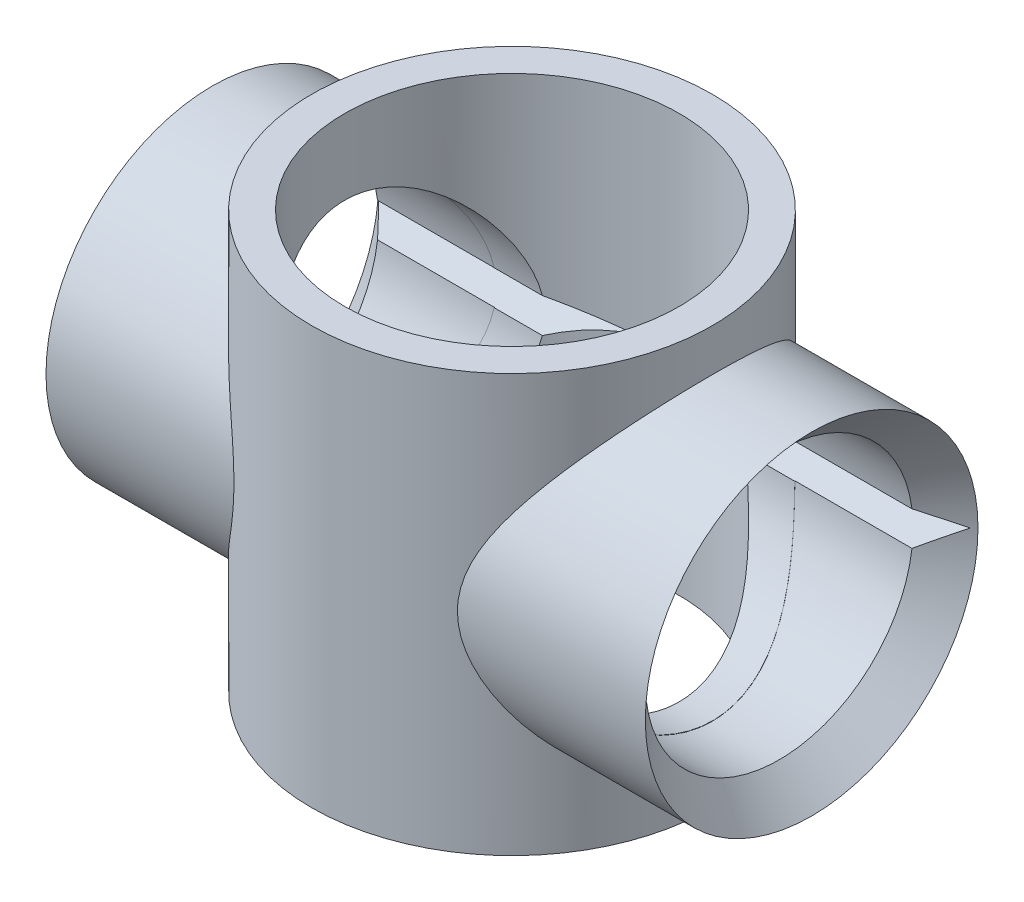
ISO-10303-21;
HEADER;
FILE_DESCRIPTION(('STEP AP214'),'2;1');
FILE_NAME('part.step','',(''),(''),'','','');
FILE_SCHEMA(('AUTOMOTIVE_DESIGN { 1 0 10303 214 1 1 1 1 }'));
ENDSEC;
DATA;
#1=APPLICATION_CONTEXT('core data for automotive mechanical design processes');
#2=APPLICATION_PROTOCOL_DEFINITION('international standard','automotive_design',2000,#1);
#3=PRODUCT_CONTEXT('',#1,'mechanical');
#4=PRODUCT('Part','Part','',(#3));
#5=PRODUCT_RELATED_PRODUCT_CATEGORY('part','',(#4));
#6=PRODUCT_DEFINITION_FORMATION('','',#4);
#7=PRODUCT_DEFINITION_CONTEXT('part definition',#1,'design');
#8=PRODUCT_DEFINITION('design','',#6,#7);
#9=PRODUCT_DEFINITION_SHAPE('','',#8);
#10=(LENGTH_UNIT() NAMED_UNIT(*) SI_UNIT(.MILLI.,.METRE.));
#11=(NAMED_UNIT(*) PLANE_ANGLE_UNIT() SI_UNIT($,.RADIAN.));
#12=(NAMED_UNIT(*) SI_UNIT($,.STERADIAN.) SOLID_ANGLE_UNIT());
#13=UNCERTAINTY_MEASURE_WITH_UNIT(LENGTH_MEASURE(1.E-05),#10,'distance_accuracy_value','');
#14=(GEOMETRIC_REPRESENTATION_CONTEXT(3) GLOBAL_UNCERTAINTY_ASSIGNED_CONTEXT((#13)) GLOBAL_UNIT_ASSIGNED_CONTEXT((#10,
#11,#12)) REPRESENTATION_CONTEXT('',''));
#15=CARTESIAN_POINT('',(0.,0.,0.));
#16=DIRECTION('',(0.,0.,1.));
#17=DIRECTION('',(1.,0.,0.));
#18=AXIS2_PLACEMENT_3D('',#15,#16,#17);
#19=CARTESIAN_POINT('',(25.4,0.,0.));
#20=DIRECTION('',(-1.,0.,0.));
#21=DIRECTION('',(0.,0.,1.));
#22=AXIS2_PLACEMENT_3D('',#19,#20,#21);
#23=CYLINDRICAL_SURFACE('',#22,12.7254);
#24=CARTESIAN_POINT('',(-14.1762722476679,0.,12.7254));
#25=CARTESIAN_POINT('',(-14.1762759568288,0.310435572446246,12.7253978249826));
#26=CARTESIAN_POINT('',(-14.1865157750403,0.62090119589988,12.7140167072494));
#27=CARTESIAN_POINT('',(-14.2269594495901,1.23888235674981,12.6687417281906));
#28=CARTESIAN_POINT('',(-14.2571663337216,1.54639743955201,12.6348444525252));
#29=CARTESIAN_POINT('',(-14.3361168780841,2.15617811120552,12.5451903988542));
#30=CARTESIAN_POINT('',(-14.3848841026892,2.45843651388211,12.4894058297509));
#31=CARTESIAN_POINT('',(-14.4988147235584,3.0552989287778,12.3569609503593));
#32=CARTESIAN_POINT('',(-14.5639865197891,3.34989893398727,12.2802899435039));
#33=CARTESIAN_POINT('',(-14.7074544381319,3.92680936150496,12.1080832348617));
#34=CARTESIAN_POINT('',(-14.785611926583,4.20921360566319,12.0127450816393));
#35=CARTESIAN_POINT('',(-14.9529152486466,4.76370226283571,11.8038458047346));
#36=CARTESIAN_POINT('',(-15.042060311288,5.03578739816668,11.6902859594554));
#37=CARTESIAN_POINT('',(-15.3222714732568,5.83566221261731,11.3236361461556));
#38=CARTESIAN_POINT('',(-15.5261896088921,6.34735867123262,11.0444886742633));
#39=CARTESIAN_POINT('',(-15.8604689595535,7.11703825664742,10.5544090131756));
#40=CARTESIAN_POINT('',(-15.9856129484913,7.39106520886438,10.3643060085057));
#41=CARTESIAN_POINT('',(-16.238304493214,7.922787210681,9.96373237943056));
#42=CARTESIAN_POINT('',(-16.3658522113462,8.18048115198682,9.75326037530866));
#43=CARTESIAN_POINT('',(-16.620616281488,8.67894719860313,9.31249155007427));
#44=CARTESIAN_POINT('',(-16.7478322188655,8.91970346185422,9.08217660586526));
#45=CARTESIAN_POINT('',(-16.999208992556,9.38319278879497,8.60248368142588));
#46=CARTESIAN_POINT('',(-17.1233696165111,9.60592460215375,8.35310438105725));
#47=CARTESIAN_POINT('',(-17.3838066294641,10.0633175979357,7.79825802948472));
#48=CARTESIAN_POINT('',(-17.5192159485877,10.2949961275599,7.4899105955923));
#49=CARTESIAN_POINT('',(-17.7791028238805,10.7312857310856,6.85019720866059));
#50=CARTESIAN_POINT('',(-17.9035790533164,10.9358935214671,6.51882847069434));
#51=CARTESIAN_POINT('',(-18.1379615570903,11.3155304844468,5.83501103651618));
#52=CARTESIAN_POINT('',(-18.2478800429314,11.4905844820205,5.48258037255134));
#53=CARTESIAN_POINT('',(-18.4498877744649,11.808758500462,4.75870066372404));
#54=CARTESIAN_POINT('',(-18.5419808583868,11.9518853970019,4.38725573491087));
#55=CARTESIAN_POINT('',(-18.6960978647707,12.1895281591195,3.67111801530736));
#56=CARTESIAN_POINT('',(-18.7603386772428,12.2877007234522,3.32811465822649));
#57=CARTESIAN_POINT('',(-18.8705513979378,12.4553206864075,2.63226386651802));
#58=CARTESIAN_POINT('',(-18.9165245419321,12.5247700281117,2.27941709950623));
#59=CARTESIAN_POINT('',(-18.9887684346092,12.6336173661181,1.56749913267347));
#60=CARTESIAN_POINT('',(-19.015059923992,12.6730469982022,1.20843489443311));
#61=CARTESIAN_POINT('',(-19.0471822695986,12.721194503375,0.487359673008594));
#62=CARTESIAN_POINT('',(-19.0530160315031,12.7299167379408,0.125349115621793));
#63=CARTESIAN_POINT('',(-19.0447399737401,12.7175240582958,-0.542492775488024));
#64=CARTESIAN_POINT('',(-19.0335422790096,12.7007660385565,-0.848453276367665));
#65=CARTESIAN_POINT('',(-18.9966132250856,12.6453569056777,-1.45746787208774));
#66=CARTESIAN_POINT('',(-18.9708837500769,12.6067086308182,-1.7605223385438));
#67=CARTESIAN_POINT('',(-18.9054690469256,12.5080543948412,-2.36160075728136));
#68=CARTESIAN_POINT('',(-18.8657832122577,12.4480475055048,-2.65962449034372));
#69=CARTESIAN_POINT('',(-18.7733149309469,12.307455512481,-3.24869938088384));
#70=CARTESIAN_POINT('',(-18.7205319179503,12.2268695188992,-3.53975023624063));
#71=CARTESIAN_POINT('',(-18.60322057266,12.0464846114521,-4.11188368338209));
#72=CARTESIAN_POINT('',(-18.5387463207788,11.9467740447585,-4.39300533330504));
#73=CARTESIAN_POINT('',(-18.3991012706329,11.7289055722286,-4.9453786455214));
#74=CARTESIAN_POINT('',(-18.3239261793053,11.6107402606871,-5.21662629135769));
#75=CARTESIAN_POINT('',(-18.1642607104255,11.3570851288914,-5.74796296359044));
#76=CARTESIAN_POINT('',(-18.0797720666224,11.2215985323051,-6.00805405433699));
#77=CARTESIAN_POINT('',(-17.9028801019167,10.9343143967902,-6.51627199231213));
#78=CARTESIAN_POINT('',(-17.8104758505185,10.7825149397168,-6.76439742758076));
#79=CARTESIAN_POINT('',(-17.6066346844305,10.4425934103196,-7.27979882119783));
#80=CARTESIAN_POINT('',(-17.4942931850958,10.252320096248,-7.54529951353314));
#81=CARTESIAN_POINT('',(-17.263533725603,9.85339432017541,-8.05929815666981));
#82=CARTESIAN_POINT('',(-17.1451153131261,9.64474048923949,-8.30779483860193));
#83=CARTESIAN_POINT('',(-16.9042755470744,9.20981436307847,-8.78749638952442));
#84=CARTESIAN_POINT('',(-16.7818487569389,8.9835175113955,-9.01867624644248));
#85=CARTESIAN_POINT('',(-16.5354896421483,8.51443261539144,-9.46279993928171));
#86=CARTESIAN_POINT('',(-16.4115571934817,8.27164320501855,-9.67574226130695));
#87=CARTESIAN_POINT('',(-16.1453739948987,7.73111162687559,-10.1145989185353));
#88=CARTESIAN_POINT('',(-16.0032847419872,7.43070855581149,-10.3373464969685));
#89=CARTESIAN_POINT('',(-15.7245271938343,6.80963100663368,-10.7566324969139));
#90=CARTESIAN_POINT('',(-15.5878601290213,6.48895196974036,-10.9531649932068));
#91=CARTESIAN_POINT('',(-15.3247988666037,5.82874696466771,-11.3182856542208));
#92=CARTESIAN_POINT('',(-15.1983888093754,5.48925151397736,-11.4869173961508));
#93=CARTESIAN_POINT('',(-14.9606899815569,4.79195727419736,-11.7948343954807));
#94=CARTESIAN_POINT('',(-14.849401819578,4.43415774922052,-11.9341184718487));
#95=CARTESIAN_POINT('',(-14.6763646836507,3.80684990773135,-12.1457731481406));
#96=CARTESIAN_POINT('',(-14.6095475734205,3.54133331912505,-12.2258907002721));
#97=CARTESIAN_POINT('',(-14.4884951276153,3.0030772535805,-12.369106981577));
#98=CARTESIAN_POINT('',(-14.4342517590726,2.73034251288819,-12.4322165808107));
#99=CARTESIAN_POINT('',(-14.3402281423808,2.17923123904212,-12.5405547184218));
#100=CARTESIAN_POINT('',(-14.3004297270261,1.9008622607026,-12.5858057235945));
#101=CARTESIAN_POINT('',(-14.2367288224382,1.33991522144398,-12.6578188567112));
#102=CARTESIAN_POINT('',(-14.2128263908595,1.05733714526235,-12.684580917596));
#103=CARTESIAN_POINT('',(-14.1818450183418,0.488815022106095,-12.7192108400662));
#104=CARTESIAN_POINT('',(-14.1748421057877,0.202861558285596,-12.7269933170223));
#105=CARTESIAN_POINT('',(-14.1781880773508,-0.368816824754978,-12.723265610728));
#106=CARTESIAN_POINT('',(-14.1885369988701,-0.654541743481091,-12.7117553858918));
#107=CARTESIAN_POINT('',(-14.2261488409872,-1.22364676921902,-12.6696478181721));
#108=CARTESIAN_POINT('',(-14.2534237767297,-1.50702506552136,-12.6390369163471));
#109=CARTESIAN_POINT('',(-14.3237664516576,-2.06914914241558,-12.5592606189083));
#110=CARTESIAN_POINT('',(-14.3668344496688,-2.34789484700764,-12.5100949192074));
#111=CARTESIAN_POINT('',(-14.464588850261,-2.88511311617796,-12.3969130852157));
#112=CARTESIAN_POINT('',(-14.5185794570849,-3.14389898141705,-12.3337713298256));
#113=CARTESIAN_POINT('',(-14.6376842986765,-3.65469917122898,-12.1921799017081));
#114=CARTESIAN_POINT('',(-14.7028021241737,-3.90671127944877,-12.113725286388));
#115=CARTESIAN_POINT('',(-14.8424000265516,-4.40305350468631,-11.9422725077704));
#116=CARTESIAN_POINT('',(-14.9168802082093,-4.64738353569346,-11.8492741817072));
#117=CARTESIAN_POINT('',(-15.0734618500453,-5.12778078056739,-11.6494360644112));
#118=CARTESIAN_POINT('',(-15.1555636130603,-5.36384766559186,-11.5425957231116));
#119=CARTESIAN_POINT('',(-15.3427555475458,-5.87370364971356,-11.2929758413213));
#120=CARTESIAN_POINT('',(-15.4491580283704,-6.14558702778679,-11.1472829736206));
#121=CARTESIAN_POINT('',(-15.6678322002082,-6.67628107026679,-10.8377782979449));
#122=CARTESIAN_POINT('',(-15.7801033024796,-6.9350930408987,-10.6739683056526));
#123=CARTESIAN_POINT('',(-16.0082078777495,-7.4395355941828,-10.328728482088));
#124=CARTESIAN_POINT('',(-16.1240453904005,-7.68515029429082,-10.1472781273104));
#125=CARTESIAN_POINT('',(-16.3568919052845,-8.16238920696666,-9.76750814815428));
#126=CARTESIAN_POINT('',(-16.4739009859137,-8.39401247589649,-9.56918738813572));
#127=CARTESIAN_POINT('',(-16.732709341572,-8.89222454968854,-9.11058124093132));
#128=CARTESIAN_POINT('',(-16.8742819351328,-9.15525188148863,-8.84627877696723));
#129=CARTESIAN_POINT('',(-17.152434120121,-9.65832369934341,-8.29410028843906));
#130=CARTESIAN_POINT('',(-17.2890127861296,-9.89836393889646,-8.00621992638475));
#131=CARTESIAN_POINT('',(-17.5536216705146,-10.3536087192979,-7.40808590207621));
#132=CARTESIAN_POINT('',(-17.6816576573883,-10.568830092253,-7.09784763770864));
#133=CARTESIAN_POINT('',(-17.9259238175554,-10.9725969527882,-6.45612379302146));
#134=CARTESIAN_POINT('',(-18.0421571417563,-11.1611495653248,-6.12464392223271));
#135=CARTESIAN_POINT('',(-18.2387966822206,-11.4760216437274,-5.50751267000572));
#136=CARTESIAN_POINT('',(-18.3218021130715,-11.6073450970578,-5.22523320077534));
#137=CARTESIAN_POINT('',(-18.4763857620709,-11.8498467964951,-4.64914622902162));
#138=CARTESIAN_POINT('',(-18.5479661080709,-11.9610287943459,-4.35534088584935));
#139=CARTESIAN_POINT('',(-18.6781727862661,-12.1619610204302,-3.75789417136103));
#140=CARTESIAN_POINT('',(-18.7368073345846,-12.251724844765,-3.45425917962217));
#141=CARTESIAN_POINT('',(-18.8398726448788,-12.4087718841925,-2.83884194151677));
#142=CARTESIAN_POINT('',(-18.8843032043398,-12.4760547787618,-2.52705957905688));
#143=CARTESIAN_POINT('',(-18.9580743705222,-12.5874398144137,-1.89611365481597));
#144=CARTESIAN_POINT('',(-18.9873450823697,-12.6314346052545,-1.5769228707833));
#145=CARTESIAN_POINT('',(-19.0297562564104,-12.695097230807,-0.935049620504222));
#146=CARTESIAN_POINT('',(-19.0428966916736,-12.7147650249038,-0.612367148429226));
#147=CARTESIAN_POINT('',(-19.0527099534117,-12.7294576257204,0.033787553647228));
#148=CARTESIAN_POINT('',(-19.0493838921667,-12.7244840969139,0.357259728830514));
#149=CARTESIAN_POINT('',(-19.0263514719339,-12.6899772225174,1.0022903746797));
#150=CARTESIAN_POINT('',(-19.0066458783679,-12.6604450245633,1.32384893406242));
#151=CARTESIAN_POINT('',(-18.9534075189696,-12.5803727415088,1.93880359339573));
#152=CARTESIAN_POINT('',(-18.9210049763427,-12.5315476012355,2.23252389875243));
#153=CARTESIAN_POINT('',(-18.8432770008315,-12.4138771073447,2.81415884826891));
#154=CARTESIAN_POINT('',(-18.797952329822,-12.3450329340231,3.10207383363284));
#155=CARTESIAN_POINT('',(-18.6952896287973,-12.1881367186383,3.67042994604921));
#156=CARTESIAN_POINT('',(-18.6379508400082,-12.1000834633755,3.95087059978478));
#157=CARTESIAN_POINT('',(-18.5123521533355,-11.9057123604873,4.50282607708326));
#158=CARTESIAN_POINT('',(-18.4440916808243,-11.7993935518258,4.77434043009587));
#159=CARTESIAN_POINT('',(-18.2937166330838,-11.5629651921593,5.32237617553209));
#160=CARTESIAN_POINT('',(-18.2110355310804,-11.4318476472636,5.59830668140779));
#161=CARTESIAN_POINT('',(-18.0363830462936,-11.1515217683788,6.13773381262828));
#162=CARTESIAN_POINT('',(-17.944411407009,-11.002312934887,6.40123009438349));
#163=CARTESIAN_POINT('',(-17.7527490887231,-10.6868661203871,6.91502811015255));
#164=CARTESIAN_POINT('',(-17.6530551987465,-10.5206210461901,7.16532428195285));
#165=CARTESIAN_POINT('',(-17.4476333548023,-10.1721689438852,7.65195154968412));
#166=CARTESIAN_POINT('',(-17.3419047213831,-9.98996011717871,7.88828106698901));
#167=CARTESIAN_POINT('',(-17.1091054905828,-9.58057735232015,8.38253580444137));
#168=CARTESIAN_POINT('',(-16.9812971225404,-9.3508422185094,8.63799611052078));
#169=CARTESIAN_POINT('',(-16.7226388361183,-8.87245385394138,9.12867777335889));
#170=CARTESIAN_POINT('',(-16.5917897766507,-8.62380592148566,9.36390475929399));
#171=CARTESIAN_POINT('',(-16.3297433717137,-8.10821623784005,9.81375555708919));
#172=CARTESIAN_POINT('',(-16.1985458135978,-7.84125735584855,10.0283596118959));
#173=CARTESIAN_POINT('',(-15.9390084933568,-7.29002208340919,10.4359410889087));
#174=CARTESIAN_POINT('',(-15.8106684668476,-7.00574730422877,10.6289205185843));
#175=CARTESIAN_POINT('',(-15.5692785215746,-6.44173064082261,10.9791608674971));
#176=CARTESIAN_POINT('',(-15.4557945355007,-6.16315299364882,11.1379967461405));
#177=CARTESIAN_POINT('',(-15.2371111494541,-5.59217260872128,11.4353401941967));
#178=CARTESIAN_POINT('',(-15.1319120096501,-5.29976943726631,11.5738471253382));
#179=CARTESIAN_POINT('',(-14.9331751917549,-4.70236480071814,11.8291554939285));
#180=CARTESIAN_POINT('',(-14.8396194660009,-4.39738383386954,11.945990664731));
#181=CARTESIAN_POINT('',(-14.6673920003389,-3.77555605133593,12.156836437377));
#182=CARTESIAN_POINT('',(-14.5887162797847,-3.45871243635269,12.2508531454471));
#183=CARTESIAN_POINT('',(-14.4646013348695,-2.88424036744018,12.3969717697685));
#184=CARTESIAN_POINT('',(-14.415653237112,-2.62855022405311,12.4537398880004));
#185=CARTESIAN_POINT('',(-14.3304900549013,-2.11212217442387,12.5516444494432));
#186=CARTESIAN_POINT('',(-14.2942724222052,-1.85138528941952,12.5927840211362));
#187=CARTESIAN_POINT('',(-14.2358113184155,-1.32649119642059,12.6588361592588));
#188=CARTESIAN_POINT('',(-14.2135575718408,-1.06233664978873,12.6837606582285));
#189=CARTESIAN_POINT('',(-14.1837856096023,-0.532128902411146,12.7170444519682));
#190=CARTESIAN_POINT('',(-14.1762690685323,-0.266075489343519,12.7254018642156));
#191=CARTESIAN_POINT('',(-14.1762722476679,0.,12.7254));
#192=B_SPLINE_CURVE_WITH_KNOTS('',3,(#24,#25,#26,#27,#28,#29,#30,#31,#32,#33,#34,#35,#36,#37,
#38,#39,#40,#41,#42,#43,#44,#45,#46,#47,#48,#49,#50,#51,#52,#53,#54,#55,#56,#57,#58,#59,#60,#61,
#62,#63,#64,#65,#66,#67,#68,#69,#70,#71,#72,#73,#74,#75,#76,#77,#78,#79,#80,#81,#82,#83,#84,#85,
#86,#87,#88,#89,#90,#91,#92,#93,#94,#95,#96,#97,#98,#99,#100,#101,#102,#103,#104,#105,#106,#107,
#108,#109,#110,#111,#112,#113,#114,#115,#116,#117,#118,#119,#120,#121,#122,#123,#124,#125,#126,
#127,#128,#129,#130,#131,#132,#133,#134,#135,#136,#137,#138,#139,#140,#141,#142,#143,#144,#145,
#146,#147,#148,#149,#150,#151,#152,#153,#154,#155,#156,#157,#158,#159,#160,#161,#162,#163,#164,
#165,#166,#167,#168,#169,#170,#171,#172,#173,#174,#175,#176,#177,#178,#179,#180,#181,#182,#183,
#184,#185,#186,#187,#188,#189,#190,#191),.UNSPECIFIED.,.T.,.F.,(4,2,2,2,2,2,2,2,2,2,2,2,2,2,2,2,
2,2,2,2,2,2,2,2,2,2,2,2,2,2,2,2,2,2,2,2,2,2,2,2,2,2,2,2,2,2,2,2,2,2,2,2,2,2,2,2,2,2,2,2,2,2,2,2,
2,2,2,2,2,2,2,2,2,2,2,2,2,2,2,2,2,2,2,4),(0.,0.930988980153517,1.86211916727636,2.7944354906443,
3.72723018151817,4.65064048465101,5.57398603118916,7.41975641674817,8.48766760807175,
9.55565118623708,10.6246207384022,11.6936643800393,12.9183162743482,14.1431165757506,
15.3668828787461,16.5903853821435,17.6762880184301,18.7621171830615,19.8468004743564,
20.9313296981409,21.8500860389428,22.7687232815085,23.6874004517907,24.6061173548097,
25.5206881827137,26.4356269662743,27.3503957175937,28.2652721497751,29.3005126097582,
30.3358302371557,31.3726155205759,32.4094867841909,33.6082694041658,34.8073225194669,
36.0044848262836,37.2016953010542,38.0567460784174,38.9112490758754,39.7646736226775,
40.6181012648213,41.4753612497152,42.3326230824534,43.1904941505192,44.0483792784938,
44.862982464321,45.6778490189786,46.4927246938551,47.3076327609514,48.2856299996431,
49.263529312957,50.2425802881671,51.2216972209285,52.4168520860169,53.6122273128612,
54.8067870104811,56.0010269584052,56.966688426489,57.9321698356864,58.897036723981,
59.8619173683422,60.8312078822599,61.8005000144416,62.7697266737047,63.7389080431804,
64.6364218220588,65.5338826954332,66.4314002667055,67.3289650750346,68.2774877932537,
69.2260367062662,70.174982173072,71.1240346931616,72.222630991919,73.3209206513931,
74.4202522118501,75.5194816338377,76.5390573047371,77.5586649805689,78.5766720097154,
79.5944063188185,80.3930179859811,81.1914697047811,81.989333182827,82.7872873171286),.UNSPECIFIED.);
#193=CARTESIAN_POINT('',(-14.2694021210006,-1.62761852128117,-12.6208820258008));
#194=VERTEX_POINT('',#193);
#195=CARTESIAN_POINT('',(-14.2694021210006,-1.62761852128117,12.6208820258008));
#196=VERTEX_POINT('',#195);
#197=EDGE_CURVE('E302',#194,#196,#192,.T.);
#198=ORIENTED_EDGE('',*,*,#197,.F.);
#199=DIRECTION('',(-1.,0.,0.));
#200=VECTOR('',#199,1.);
#201=CARTESIAN_POINT('',(25.4,-1.62761852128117,-12.6208820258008));
#202=LINE('',#201,#200);
#203=CARTESIAN_POINT('',(-25.4,-1.62761852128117,-12.6208820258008));
#204=VERTEX_POINT('',#203);
#205=EDGE_CURVE('E190',#194,#204,#202,.T.);
#206=ORIENTED_EDGE('',*,*,#205,.T.);
#207=CARTESIAN_POINT('',(-25.4,0.,0.));
#208=DIRECTION('',(1.,0.,0.));
#209=DIRECTION('',(0.,0.,-1.));
#210=AXIS2_PLACEMENT_3D('',#207,#208,#209);
#211=CIRCLE('',#210,12.7254);
#212=CARTESIAN_POINT('',(-25.4,-1.62761852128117,12.6208820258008));
#213=VERTEX_POINT('',#212);
#214=EDGE_CURVE('E271',#213,#204,#211,.T.);
#215=ORIENTED_EDGE('',*,*,#214,.F.);
#216=DIRECTION('',(-1.,0.,0.));
#217=VECTOR('',#216,1.);
#218=CARTESIAN_POINT('',(25.4,-1.62761852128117,12.6208820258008));
#219=LINE('',#218,#217);
#220=EDGE_CURVE('E418',#196,#213,#219,.T.);
#221=ORIENTED_EDGE('',*,*,#220,.F.);
#222=EDGE_LOOP('',(#198,#206,#215,#221));
#223=FACE_BOUND('',#222,.T.);
#224=ADVANCED_FACE('F36',(#223),#23,.F.);
#225=CARTESIAN_POINT('',(25.4,0.,0.));
#226=DIRECTION('',(1.,0.,0.));
#227=DIRECTION('',(0.,0.,-1.));
#228=AXIS2_PLACEMENT_3D('',#225,#226,#227);
#229=CIRCLE('',#228,12.7254);
#230=CARTESIAN_POINT('',(25.4,-1.62761852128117,12.6208820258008));
#231=VERTEX_POINT('',#230);
#232=CARTESIAN_POINT('',(25.4,-1.62761852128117,-12.6208820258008));
#233=VERTEX_POINT('',#232);
#234=EDGE_CURVE('E279',#231,#233,#229,.T.);
#235=ORIENTED_EDGE('',*,*,#234,.T.);
#236=DIRECTION('',(-1.,0.,0.));
#237=VECTOR('',#236,1.);
#238=CARTESIAN_POINT('',(25.4,-1.62761852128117,-12.6208820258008));
#239=LINE('',#238,#237);
#240=CARTESIAN_POINT('',(14.2694021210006,-1.62761852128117,-12.6208820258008));
#241=VERTEX_POINT('',#240);
#242=EDGE_CURVE('E54',#233,#241,#239,.T.);
#243=ORIENTED_EDGE('',*,*,#242,.T.);
#244=CARTESIAN_POINT('',(14.1762722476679,0.,12.7254));
#245=CARTESIAN_POINT('',(14.1762759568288,-0.310435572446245,12.7253978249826));
#246=CARTESIAN_POINT('',(14.1865157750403,-0.620901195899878,12.7140167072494));
#247=CARTESIAN_POINT('',(14.2269594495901,-1.23888235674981,12.6687417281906));
#248=CARTESIAN_POINT('',(14.2571663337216,-1.54639743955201,12.6348444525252));
#249=CARTESIAN_POINT('',(14.3361168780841,-2.15617811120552,12.5451903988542));
#250=CARTESIAN_POINT('',(14.3848841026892,-2.45843651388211,12.4894058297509));
#251=CARTESIAN_POINT('',(14.4988147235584,-3.0552989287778,12.3569609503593));
#252=CARTESIAN_POINT('',(14.5639865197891,-3.34989893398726,12.2802899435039));
#253=CARTESIAN_POINT('',(14.7074544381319,-3.92680936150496,12.1080832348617));
#254=CARTESIAN_POINT('',(14.785611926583,-4.20921360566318,12.0127450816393));
#255=CARTESIAN_POINT('',(14.9529152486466,-4.76370226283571,11.8038458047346));
#256=CARTESIAN_POINT('',(15.042060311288,-5.03578739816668,11.6902859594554));
#257=CARTESIAN_POINT('',(15.3222714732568,-5.8356622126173,11.3236361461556));
#258=CARTESIAN_POINT('',(15.5261896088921,-6.34735867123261,11.0444886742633));
#259=CARTESIAN_POINT('',(15.8604689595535,-7.11703825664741,10.5544090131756));
#260=CARTESIAN_POINT('',(15.9856129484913,-7.39106520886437,10.3643060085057));
#261=CARTESIAN_POINT('',(16.238304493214,-7.922787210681,9.96373237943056));
#262=CARTESIAN_POINT('',(16.3658522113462,-8.18048115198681,9.75326037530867));
#263=CARTESIAN_POINT('',(16.620616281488,-8.67894719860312,9.31249155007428));
#264=CARTESIAN_POINT('',(16.7478322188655,-8.91970346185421,9.08217660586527));
#265=CARTESIAN_POINT('',(16.999208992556,-9.38319278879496,8.60248368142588));
#266=CARTESIAN_POINT('',(17.1233696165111,-9.60592460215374,8.35310438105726));
#267=CARTESIAN_POINT('',(17.3838066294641,-10.0633175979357,7.79825802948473));
#268=CARTESIAN_POINT('',(17.5192159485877,-10.2949961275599,7.48991059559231));
#269=CARTESIAN_POINT('',(17.7791028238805,-10.7312857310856,6.8501972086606));
#270=CARTESIAN_POINT('',(17.9035790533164,-10.9358935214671,6.51882847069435));
#271=CARTESIAN_POINT('',(18.1379615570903,-11.3155304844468,5.8350110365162));
#272=CARTESIAN_POINT('',(18.2478800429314,-11.4905844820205,5.48258037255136));
#273=CARTESIAN_POINT('',(18.4498877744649,-11.808758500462,4.75870066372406));
#274=CARTESIAN_POINT('',(18.5419808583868,-11.9518853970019,4.38725573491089));
#275=CARTESIAN_POINT('',(18.6960978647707,-12.1895281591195,3.67111801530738));
#276=CARTESIAN_POINT('',(18.7603386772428,-12.2877007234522,3.3281146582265));
#277=CARTESIAN_POINT('',(18.8705513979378,-12.4553206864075,2.63226386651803));
#278=CARTESIAN_POINT('',(18.9165245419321,-12.5247700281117,2.27941709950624));
#279=CARTESIAN_POINT('',(18.9887684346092,-12.633617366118,1.56749913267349));
#280=CARTESIAN_POINT('',(19.015059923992,-12.6730469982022,1.20843489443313));
#281=CARTESIAN_POINT('',(19.0471822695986,-12.721194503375,0.487359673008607));
#282=CARTESIAN_POINT('',(19.0530160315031,-12.7299167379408,0.125349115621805));
#283=CARTESIAN_POINT('',(19.0447399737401,-12.7175240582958,-0.542492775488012));
#284=CARTESIAN_POINT('',(19.0335422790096,-12.7007660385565,-0.848453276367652));
#285=CARTESIAN_POINT('',(18.9966132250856,-12.6453569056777,-1.45746787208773));
#286=CARTESIAN_POINT('',(18.9708837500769,-12.6067086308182,-1.76052233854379));
#287=CARTESIAN_POINT('',(18.9054690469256,-12.5080543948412,-2.36160075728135));
#288=CARTESIAN_POINT('',(18.8657832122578,-12.4480475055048,-2.65962449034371));
#289=CARTESIAN_POINT('',(18.7733149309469,-12.307455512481,-3.24869938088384));
#290=CARTESIAN_POINT('',(18.7205319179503,-12.2268695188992,-3.53975023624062));
#291=CARTESIAN_POINT('',(18.60322057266,-12.0464846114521,-4.11188368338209));
#292=CARTESIAN_POINT('',(18.5387463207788,-11.9467740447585,-4.39300533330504));
#293=CARTESIAN_POINT('',(18.3991012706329,-11.7289055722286,-4.94537864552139));
#294=CARTESIAN_POINT('',(18.3239261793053,-11.6107402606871,-5.21662629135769));
#295=CARTESIAN_POINT('',(18.1642607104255,-11.3570851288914,-5.74796296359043));
#296=CARTESIAN_POINT('',(18.0797720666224,-11.2215985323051,-6.00805405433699));
#297=CARTESIAN_POINT('',(17.9028801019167,-10.9343143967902,-6.51627199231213));
#298=CARTESIAN_POINT('',(17.8104758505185,-10.7825149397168,-6.76439742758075));
#299=CARTESIAN_POINT('',(17.6066346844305,-10.4425934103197,-7.27979882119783));
#300=CARTESIAN_POINT('',(17.4942931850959,-10.252320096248,-7.54529951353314));
#301=CARTESIAN_POINT('',(17.263533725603,-9.85339432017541,-8.05929815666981));
#302=CARTESIAN_POINT('',(17.1451153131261,-9.64474048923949,-8.30779483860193));
#303=CARTESIAN_POINT('',(16.9042755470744,-9.20981436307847,-8.78749638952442));
#304=CARTESIAN_POINT('',(16.7818487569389,-8.9835175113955,-9.01867624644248));
#305=CARTESIAN_POINT('',(16.5354896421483,-8.51443261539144,-9.46279993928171));
#306=CARTESIAN_POINT('',(16.4115571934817,-8.27164320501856,-9.67574226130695));
#307=CARTESIAN_POINT('',(16.1453739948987,-7.7311116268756,-10.1145989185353));
#308=CARTESIAN_POINT('',(16.0032847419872,-7.4307085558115,-10.3373464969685));
#309=CARTESIAN_POINT('',(15.7245271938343,-6.80963100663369,-10.7566324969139));
#310=CARTESIAN_POINT('',(15.5878601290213,-6.48895196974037,-10.9531649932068));
#311=CARTESIAN_POINT('',(15.3247988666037,-5.82874696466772,-11.3182856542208));
#312=CARTESIAN_POINT('',(15.1983888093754,-5.48925151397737,-11.4869173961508));
#313=CARTESIAN_POINT('',(14.9606899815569,-4.79195727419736,-11.7948343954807));
#314=CARTESIAN_POINT('',(14.8494018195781,-4.43415774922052,-11.9341184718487));
#315=CARTESIAN_POINT('',(14.6763646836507,-3.80684990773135,-12.1457731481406));
#316=CARTESIAN_POINT('',(14.6095475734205,-3.54133331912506,-12.2258907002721));
#317=CARTESIAN_POINT('',(14.4884951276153,-3.00307725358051,-12.369106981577));
#318=CARTESIAN_POINT('',(14.4342517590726,-2.7303425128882,-12.4322165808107));
#319=CARTESIAN_POINT('',(14.3402281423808,-2.17923123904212,-12.5405547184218));
#320=CARTESIAN_POINT('',(14.3004297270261,-1.9008622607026,-12.5858057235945));
#321=CARTESIAN_POINT('',(14.2367288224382,-1.33991522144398,-12.6578188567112));
#322=CARTESIAN_POINT('',(14.2128263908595,-1.05733714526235,-12.684580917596));
#323=CARTESIAN_POINT('',(14.1818450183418,-0.488815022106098,-12.7192108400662));
#324=CARTESIAN_POINT('',(14.1748421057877,-0.202861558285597,-12.7269933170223));
#325=CARTESIAN_POINT('',(14.1781880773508,0.368816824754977,-12.723265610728));
#326=CARTESIAN_POINT('',(14.1885369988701,0.654541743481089,-12.7117553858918));
#327=CARTESIAN_POINT('',(14.2261488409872,1.22364676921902,-12.6696478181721));
#328=CARTESIAN_POINT('',(14.2534237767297,1.50702506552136,-12.6390369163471));
#329=CARTESIAN_POINT('',(14.3237664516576,2.06914914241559,-12.5592606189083));
#330=CARTESIAN_POINT('',(14.3668344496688,2.34789484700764,-12.5100949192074));
#331=CARTESIAN_POINT('',(14.464588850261,2.88511311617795,-12.3969130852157));
#332=CARTESIAN_POINT('',(14.5185794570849,3.14389898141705,-12.3337713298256));
#333=CARTESIAN_POINT('',(14.6376842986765,3.65469917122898,-12.1921799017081));
#334=CARTESIAN_POINT('',(14.7028021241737,3.90671127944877,-12.113725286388));
#335=CARTESIAN_POINT('',(14.8424000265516,4.40305350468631,-11.9422725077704));
#336=CARTESIAN_POINT('',(14.9168802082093,4.64738353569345,-11.8492741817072));
#337=CARTESIAN_POINT('',(15.0734618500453,5.12778078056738,-11.6494360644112));
#338=CARTESIAN_POINT('',(15.1555636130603,5.36384766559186,-11.5425957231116));
#339=CARTESIAN_POINT('',(15.3427555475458,5.87370364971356,-11.2929758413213));
#340=CARTESIAN_POINT('',(15.4491580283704,6.14558702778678,-11.1472829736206));
#341=CARTESIAN_POINT('',(15.6678322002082,6.67628107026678,-10.8377782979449));
#342=CARTESIAN_POINT('',(15.7801033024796,6.93509304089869,-10.6739683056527));
#343=CARTESIAN_POINT('',(16.0082078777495,7.43953559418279,-10.328728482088));
#344=CARTESIAN_POINT('',(16.1240453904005,7.68515029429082,-10.1472781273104));
#345=CARTESIAN_POINT('',(16.3568919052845,8.16238920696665,-9.76750814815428));
#346=CARTESIAN_POINT('',(16.4739009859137,8.39401247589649,-9.56918738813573));
#347=CARTESIAN_POINT('',(16.732709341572,8.89222454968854,-9.11058124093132));
#348=CARTESIAN_POINT('',(16.8742819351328,9.15525188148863,-8.84627877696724));
#349=CARTESIAN_POINT('',(17.152434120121,9.6583236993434,-8.29410028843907));
#350=CARTESIAN_POINT('',(17.2890127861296,9.89836393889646,-8.00621992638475));
#351=CARTESIAN_POINT('',(17.5536216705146,10.3536087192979,-7.40808590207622));
#352=CARTESIAN_POINT('',(17.6816576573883,10.568830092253,-7.09784763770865));
#353=CARTESIAN_POINT('',(17.9259238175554,10.9725969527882,-6.45612379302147));
#354=CARTESIAN_POINT('',(18.0421571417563,11.1611495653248,-6.12464392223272));
#355=CARTESIAN_POINT('',(18.2387966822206,11.4760216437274,-5.50751267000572));
#356=CARTESIAN_POINT('',(18.3218021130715,11.6073450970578,-5.22523320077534));
#357=CARTESIAN_POINT('',(18.4763857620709,11.8498467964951,-4.64914622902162));
#358=CARTESIAN_POINT('',(18.5479661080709,11.9610287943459,-4.35534088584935));
#359=CARTESIAN_POINT('',(18.6781727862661,12.1619610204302,-3.75789417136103));
#360=CARTESIAN_POINT('',(18.7368073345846,12.251724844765,-3.45425917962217));
#361=CARTESIAN_POINT('',(18.8398726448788,12.4087718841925,-2.83884194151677));
#362=CARTESIAN_POINT('',(18.8843032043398,12.4760547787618,-2.52705957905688));
#363=CARTESIAN_POINT('',(18.9580743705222,12.5874398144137,-1.89611365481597));
#364=CARTESIAN_POINT('',(18.9873450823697,12.6314346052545,-1.5769228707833));
#365=CARTESIAN_POINT('',(19.0297562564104,12.695097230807,-0.935049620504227));
#366=CARTESIAN_POINT('',(19.0428966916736,12.7147650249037,-0.612367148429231));
#367=CARTESIAN_POINT('',(19.0527099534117,12.7294576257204,0.0337875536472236));
#368=CARTESIAN_POINT('',(19.0493838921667,12.7244840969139,0.357259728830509));
#369=CARTESIAN_POINT('',(19.0263514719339,12.6899772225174,1.0022903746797));
#370=CARTESIAN_POINT('',(19.0066458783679,12.6604450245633,1.32384893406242));
#371=CARTESIAN_POINT('',(18.9534075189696,12.5803727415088,1.93880359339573));
#372=CARTESIAN_POINT('',(18.9210049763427,12.5315476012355,2.23252389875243));
#373=CARTESIAN_POINT('',(18.8432770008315,12.4138771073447,2.81415884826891));
#374=CARTESIAN_POINT('',(18.797952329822,12.3450329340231,3.10207383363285));
#375=CARTESIAN_POINT('',(18.6952896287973,12.1881367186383,3.67042994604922));
#376=CARTESIAN_POINT('',(18.6379508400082,12.1000834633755,3.95087059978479));
#377=CARTESIAN_POINT('',(18.5123521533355,11.9057123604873,4.50282607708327));
#378=CARTESIAN_POINT('',(18.4440916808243,11.7993935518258,4.77434043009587));
#379=CARTESIAN_POINT('',(18.2937166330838,11.5629651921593,5.32237617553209));
#380=CARTESIAN_POINT('',(18.2110355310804,11.4318476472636,5.59830668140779));
#381=CARTESIAN_POINT('',(18.0363830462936,11.1515217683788,6.13773381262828));
#382=CARTESIAN_POINT('',(17.944411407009,11.002312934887,6.40123009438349));
#383=CARTESIAN_POINT('',(17.7527490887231,10.6868661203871,6.91502811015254));
#384=CARTESIAN_POINT('',(17.6530551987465,10.5206210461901,7.16532428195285));
#385=CARTESIAN_POINT('',(17.4476333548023,10.1721689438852,7.65195154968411));
#386=CARTESIAN_POINT('',(17.3419047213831,9.98996011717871,7.888281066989));
#387=CARTESIAN_POINT('',(17.1091054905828,9.58057735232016,8.38253580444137));
#388=CARTESIAN_POINT('',(16.9812971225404,9.35084221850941,8.63799611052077));
#389=CARTESIAN_POINT('',(16.7226388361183,8.87245385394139,9.12867777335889));
#390=CARTESIAN_POINT('',(16.5917897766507,8.62380592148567,9.36390475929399));
#391=CARTESIAN_POINT('',(16.3297433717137,8.10821623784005,9.81375555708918));
#392=CARTESIAN_POINT('',(16.1985458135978,7.84125735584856,10.0283596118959));
#393=CARTESIAN_POINT('',(15.9390084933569,7.2900220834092,10.4359410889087));
#394=CARTESIAN_POINT('',(15.8106684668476,7.00574730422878,10.6289205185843));
#395=CARTESIAN_POINT('',(15.5692785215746,6.44173064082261,10.9791608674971));
#396=CARTESIAN_POINT('',(15.4557945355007,6.16315299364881,11.1379967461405));
#397=CARTESIAN_POINT('',(15.2371111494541,5.59217260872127,11.4353401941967));
#398=CARTESIAN_POINT('',(15.1319120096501,5.2997694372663,11.5738471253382));
#399=CARTESIAN_POINT('',(14.9331751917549,4.70236480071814,11.8291554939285));
#400=CARTESIAN_POINT('',(14.8396194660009,4.39738383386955,11.945990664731));
#401=CARTESIAN_POINT('',(14.6673920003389,3.77555605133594,12.156836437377));
#402=CARTESIAN_POINT('',(14.5887162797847,3.45871243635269,12.2508531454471));
#403=CARTESIAN_POINT('',(14.4646013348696,2.88424036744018,12.3969717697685));
#404=CARTESIAN_POINT('',(14.415653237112,2.62855022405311,12.4537398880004));
#405=CARTESIAN_POINT('',(14.3304900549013,2.11212217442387,12.5516444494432));
#406=CARTESIAN_POINT('',(14.2942724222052,1.85138528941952,12.5927840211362));
#407=CARTESIAN_POINT('',(14.2358113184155,1.32649119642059,12.6588361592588));
#408=CARTESIAN_POINT('',(14.2135575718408,1.06233664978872,12.6837606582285));
#409=CARTESIAN_POINT('',(14.1837856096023,0.532128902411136,12.7170444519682));
#410=CARTESIAN_POINT('',(14.1762690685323,0.266075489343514,12.7254018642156));
#411=CARTESIAN_POINT('',(14.1762722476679,0.,12.7254));
#412=B_SPLINE_CURVE_WITH_KNOTS('',3,(#244,#245,#246,#247,#248,#249,#250,#251,#252,#253,#254,
#255,#256,#257,#258,#259,#260,#261,#262,#263,#264,#265,#266,#267,#268,#269,#270,#271,#272,#273,
#274,#275,#276,#277,#278,#279,#280,#281,#282,#283,#284,#285,#286,#287,#288,#289,#290,#291,#292,
#293,#294,#295,#296,#297,#298,#299,#300,#301,#302,#303,#304,#305,#306,#307,#308,#309,#310,#311,
#312,#313,#314,#315,#316,#317,#318,#319,#320,#321,#322,#323,#324,#325,#326,#327,#328,#329,#330,
#331,#332,#333,#334,#335,#336,#337,#338,#339,#340,#341,#342,#343,#344,#345,#346,#347,#348,#349,
#350,#351,#352,#353,#354,#355,#356,#357,#358,#359,#360,#361,#362,#363,#364,#365,#366,#367,#368,
#369,#370,#371,#372,#373,#374,#375,#376,#377,#378,#379,#380,#381,#382,#383,#384,#385,#386,#387,
#388,#389,#390,#391,#392,#393,#394,#395,#396,#397,#398,#399,#400,#401,#402,#403,#404,#405,#406,
#407,#408,#409,#410,#411),.UNSPECIFIED.,.T.,.F.,(4,2,2,2,2,2,2,2,2,2,2,2,2,2,2,2,2,2,2,2,2,2,2,
2,2,2,2,2,2,2,2,2,2,2,2,2,2,2,2,2,2,2,2,2,2,2,2,2,2,2,2,2,2,2,2,2,2,2,2,2,2,2,2,2,2,2,2,2,2,2,2,
2,2,2,2,2,2,2,2,2,2,2,2,4),(0.,0.930988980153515,1.86211916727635,2.79443549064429,
3.72723018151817,4.65064048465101,5.57398603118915,7.41975641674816,8.48766760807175,
9.55565118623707,10.6246207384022,11.6936643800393,12.9183162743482,14.1431165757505,
15.366882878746,16.5903853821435,17.6762880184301,18.7621171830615,19.8468004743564,
20.9313296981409,21.8500860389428,22.7687232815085,23.6874004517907,24.6061173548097,
25.5206881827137,26.4356269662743,27.3503957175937,28.2652721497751,29.3005126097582,
30.3358302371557,31.3726155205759,32.4094867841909,33.6082694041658,34.8073225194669,
36.0044848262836,37.2016953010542,38.0567460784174,38.9112490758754,39.7646736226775,
40.6181012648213,41.4753612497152,42.3326230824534,43.1904941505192,44.0483792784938,
44.862982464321,45.6778490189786,46.4927246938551,47.3076327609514,48.2856299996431,
49.2635293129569,50.2425802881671,51.2216972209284,52.4168520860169,53.6122273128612,
54.8067870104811,56.0010269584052,56.966688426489,57.9321698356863,58.897036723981,
59.8619173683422,60.8312078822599,61.8005000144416,62.7697266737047,63.7389080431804,
64.6364218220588,65.5338826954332,66.4314002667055,67.3289650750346,68.2774877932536,
69.2260367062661,70.174982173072,71.1240346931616,72.2226309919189,73.320920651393,
74.42025221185,75.5194816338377,76.5390573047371,77.5586649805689,78.5766720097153,
79.5944063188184,80.3930179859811,81.191469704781,81.9893331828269,82.7872873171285),.UNSPECIFIED.);
#413=CARTESIAN_POINT('',(14.2694021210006,-1.62761852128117,12.6208820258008));
#414=VERTEX_POINT('',#413);
#415=EDGE_CURVE('E303',#414,#241,#412,.T.);
#416=ORIENTED_EDGE('',*,*,#415,.F.);
#417=DIRECTION('',(-1.,0.,0.));
#418=VECTOR('',#417,1.);
#419=CARTESIAN_POINT('',(25.4,-1.62761852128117,12.6208820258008));
#420=LINE('',#419,#418);
#421=EDGE_CURVE('E403',#231,#414,#420,.T.);
#422=ORIENTED_EDGE('',*,*,#421,.F.);
#423=EDGE_LOOP('',(#235,#243,#416,#422));
#424=FACE_BOUND('',#423,.T.);
#425=ADVANCED_FACE('F311',(#424),#23,.F.);
#426=CARTESIAN_POINT('',(0.,19.84375,0.));
#427=DIRECTION('',(0.,-1.,0.));
#428=DIRECTION('',(0.,0.,-1.));
#429=AXIS2_PLACEMENT_3D('',#426,#427,#428);
#430=CYLINDRICAL_SURFACE('',#429,19.05);
#431=CARTESIAN_POINT('',(0.,8.9142881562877,0.));
#432=DIRECTION('',(0.,-0.866025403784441,0.499999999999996));
#433=DIRECTION('',(0.,-0.499999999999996,-0.866025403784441));
#434=AXIS2_PLACEMENT_3D('',#431,#432,#433);
#435=ELLIPSE('',#434,21.9970452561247,19.05);
#436=CARTESIAN_POINT('',(-14.2938424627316,1.64360346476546,-12.5931952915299));
#437=VERTEX_POINT('',#436);
#438=CARTESIAN_POINT('',(-14.2694021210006,1.62761852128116,-12.6208820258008));
#439=VERTEX_POINT('',#438);
#440=EDGE_CURVE('E205',#437,#439,#435,.T.);
#441=ORIENTED_EDGE('',*,*,#440,.F.);
#442=CARTESIAN_POINT('',(-14.2800632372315,1.51911357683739,-12.6088181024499));
#443=CARTESIAN_POINT('',(-14.2979581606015,1.68740200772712,-12.5885450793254));
#444=CARTESIAN_POINT('',(-14.3187311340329,1.85494426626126,-12.5649384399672));
#445=CARTESIAN_POINT('',(-14.3657040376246,2.18817595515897,-12.5112091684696));
#446=CARTESIAN_POINT('',(-14.3919027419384,2.35386579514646,-12.4810880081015));
#447=CARTESIAN_POINT('',(-14.4780437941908,2.84707508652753,-12.3812959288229));
#448=CARTESIAN_POINT('',(-14.5456048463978,3.17140592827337,-12.3021146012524));
#449=CARTESIAN_POINT('',(-14.6971522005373,3.80633324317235,-12.1206445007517));
#450=CARTESIAN_POINT('',(-14.7809952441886,4.11702244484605,-12.0185561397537));
#451=CARTESIAN_POINT('',(-14.9621473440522,4.72631012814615,-11.7922705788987));
#452=CARTESIAN_POINT('',(-15.0594625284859,5.02490302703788,-11.6680633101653));
#453=CARTESIAN_POINT('',(-15.2635420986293,5.60687070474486,-11.3997799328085));
#454=CARTESIAN_POINT('',(-15.3702368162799,5.89033610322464,-11.2558465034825));
#455=CARTESIAN_POINT('',(-15.5906342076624,6.44358195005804,-10.9485329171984));
#456=CARTESIAN_POINT('',(-15.7043359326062,6.71336424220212,-10.7851553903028));
#457=CARTESIAN_POINT('',(-15.9363836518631,7.23959732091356,-10.4392377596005));
#458=CARTESIAN_POINT('',(-16.0547430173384,7.49600393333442,-10.2566395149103));
#459=CARTESIAN_POINT('',(-16.2932463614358,7.9940708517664,-9.87337745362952));
#460=CARTESIAN_POINT('',(-16.413390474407,8.2357300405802,-9.67271227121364));
#461=CARTESIAN_POINT('',(-16.6737996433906,8.74406259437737,-9.21775023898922));
#462=CARTESIAN_POINT('',(-16.8139617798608,9.00786347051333,-8.96017205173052));
#463=CARTESIAN_POINT('',(-17.0899892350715,9.51314877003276,-8.42177564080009));
#464=CARTESIAN_POINT('',(-17.2258539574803,9.75463010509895,-8.14095421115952));
#465=CARTESIAN_POINT('',(-17.4897418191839,10.2134091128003,-7.55737085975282));
#466=CARTESIAN_POINT('',(-17.6177745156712,10.4307365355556,-7.25463670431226));
#467=CARTESIAN_POINT('',(-17.8629138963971,10.8396478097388,-6.62811337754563));
#468=CARTESIAN_POINT('',(-17.9800231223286,11.0312376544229,-6.3043291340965));
#469=CARTESIAN_POINT('',(-18.1806828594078,11.3550813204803,-5.69638734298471));
#470=CARTESIAN_POINT('',(-18.2665034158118,11.491834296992,-5.41536854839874));
#471=CARTESIAN_POINT('',(-18.4269569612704,11.7452058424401,-4.8413348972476));
#472=CARTESIAN_POINT('',(-18.5015919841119,11.8618280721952,-4.54832223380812));
#473=CARTESIAN_POINT('',(-18.6380940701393,12.073632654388,-3.95189657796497));
#474=CARTESIAN_POINT('',(-18.699967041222,12.1688249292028,-3.64848847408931));
#475=CARTESIAN_POINT('',(-18.8096057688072,12.3366449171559,-3.03297451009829));
#476=CARTESIAN_POINT('',(-18.8573713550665,12.40927235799,-2.72086854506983));
#477=CARTESIAN_POINT('',(-18.9378508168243,12.5312332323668,-2.08862032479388));
#478=CARTESIAN_POINT('',(-18.9704909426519,12.5804525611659,-1.76844655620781));
#479=CARTESIAN_POINT('',(-19.0195546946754,12.654316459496,-1.12403204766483));
#480=CARTESIAN_POINT('',(-19.0359782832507,12.678960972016,-0.799791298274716));
#481=CARTESIAN_POINT('',(-19.052181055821,12.7032745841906,-0.150007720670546));
#482=CARTESIAN_POINT('',(-19.0519628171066,12.7029475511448,0.175534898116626));
#483=CARTESIAN_POINT('',(-19.0348926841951,12.677331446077,0.82518385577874));
#484=CARTESIAN_POINT('',(-19.0180416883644,12.6520437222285,1.14929027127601));
#485=CARTESIAN_POINT('',(-18.9701456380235,12.5799277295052,1.76760581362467));
#486=CARTESIAN_POINT('',(-18.9403425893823,12.5349824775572,2.06213421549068));
#487=CARTESIAN_POINT('',(-18.8676728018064,12.4249059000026,2.64572858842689));
#488=CARTESIAN_POINT('',(-18.8248068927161,12.3597758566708,2.9347949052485));
#489=CARTESIAN_POINT('',(-18.7268799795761,12.2101078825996,3.50576509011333));
#490=CARTESIAN_POINT('',(-18.6718175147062,12.1255676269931,3.78766809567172));
#491=CARTESIAN_POINT('',(-18.5505633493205,11.9380072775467,4.34279085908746));
#492=CARTESIAN_POINT('',(-18.4843710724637,11.8349862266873,4.6160101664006));
#493=CARTESIAN_POINT('',(-18.3384978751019,11.6058690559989,5.16593826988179));
#494=CARTESIAN_POINT('',(-18.2583078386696,11.4788764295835,5.44213792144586));
#495=CARTESIAN_POINT('',(-18.0884848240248,11.2067872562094,5.98242610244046));
#496=CARTESIAN_POINT('',(-17.9988516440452,11.0616903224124,6.24651437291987));
#497=CARTESIAN_POINT('',(-17.8117117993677,10.7545067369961,6.76169633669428));
#498=CARTESIAN_POINT('',(-17.7142047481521,10.5924192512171,7.01278939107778));
#499=CARTESIAN_POINT('',(-17.5129338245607,10.2522753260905,7.50129714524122));
#500=CARTESIAN_POINT('',(-17.4091691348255,10.074216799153,7.73871005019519));
#501=CARTESIAN_POINT('',(-17.1807196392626,9.67447836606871,8.23474015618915));
#502=CARTESIAN_POINT('',(-17.0552727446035,9.45030230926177,8.49099833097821));
#503=CARTESIAN_POINT('',(-16.8008918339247,8.98308804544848,8.98384415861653));
#504=CARTESIAN_POINT('',(-16.6719574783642,8.74004799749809,9.22042988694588));
#505=CARTESIAN_POINT('',(-16.413054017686,8.23546336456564,9.67380242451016));
#506=CARTESIAN_POINT('',(-16.2830831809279,7.97387614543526,9.89054080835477));
#507=CARTESIAN_POINT('',(-16.0253825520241,7.43349085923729,10.3028502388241));
#508=CARTESIAN_POINT('',(-15.8976527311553,7.15469301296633,10.4984215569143));
#509=CARTESIAN_POINT('',(-15.6322161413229,6.54507541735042,10.8903165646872));
#510=CARTESIAN_POINT('',(-15.4952221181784,6.21208071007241,11.0837574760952));
#511=CARTESIAN_POINT('',(-15.2331375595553,5.52598081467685,11.441293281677));
#512=CARTESIAN_POINT('',(-15.1080514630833,5.17286820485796,11.6053772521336));
#513=CARTESIAN_POINT('',(-14.8760419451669,4.44980608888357,11.9013056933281));
#514=CARTESIAN_POINT('',(-14.7690316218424,4.07994865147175,12.0333058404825));
#515=CARTESIAN_POINT('',(-14.5784225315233,3.32431136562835,12.2635444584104));
#516=CARTESIAN_POINT('',(-14.4947939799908,2.93855249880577,12.3618259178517));
#517=CARTESIAN_POINT('',(-14.3957371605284,2.3775147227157,12.4766707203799));
#518=CARTESIAN_POINT('',(-14.3685570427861,2.20718357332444,12.5079360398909));
#519=CARTESIAN_POINT('',(-14.3199236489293,1.86453896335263,12.5635831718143));
#520=CARTESIAN_POINT('',(-14.2984720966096,1.69222492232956,12.5879629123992));
#521=CARTESIAN_POINT('',(-14.2800632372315,1.5191135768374,12.6088181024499));
#522=B_SPLINE_CURVE_WITH_KNOTS('',3,(#442,#443,#444,#445,#446,#447,#448,#449,#450,#451,#452,
#453,#454,#455,#456,#457,#458,#459,#460,#461,#462,#463,#464,#465,#466,#467,#468,#469,#470,#471,
#472,#473,#474,#475,#476,#477,#478,#479,#480,#481,#482,#483,#484,#485,#486,#487,#488,#489,#490,
#491,#492,#493,#494,#495,#496,#497,#498,#499,#500,#501,#502,#503,#504,#505,#506,#507,#508,#509,
#510,#511,#512,#513,#514,#515,#516,#517,#518,#519,#520,#521),.UNSPECIFIED.,.F.,.F.,(4,2,2,2,2,2,
2,2,2,2,2,2,2,2,2,2,2,2,2,2,2,2,2,2,2,2,2,2,2,2,2,2,2,2,2,2,2,2,2,4),(0.,0.511214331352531,
1.02231328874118,2.04247874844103,3.0540446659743,4.06607224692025,5.07113227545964,
6.07605651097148,7.08411300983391,8.0922457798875,9.27422206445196,10.456361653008,
11.6370286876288,12.8174203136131,13.7887435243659,14.7598899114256,15.7305857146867,
16.7012932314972,17.6766852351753,18.6520795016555,19.6273227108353,20.6025132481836,
21.4997673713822,22.396964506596,23.2942691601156,24.191620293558,25.1338604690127,
26.0761207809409,27.0184273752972,27.960857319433,29.0483125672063,30.1358740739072,
31.2260220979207,32.3161561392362,33.5407564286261,34.7658114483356,35.984797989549,
37.2022245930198,37.7279107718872,38.2537549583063),.UNSPECIFIED.);
#523=CARTESIAN_POINT('',(-14.2938424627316,1.64360346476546,12.5931952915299));
#524=VERTEX_POINT('',#523);
#525=EDGE_CURVE('E286',#437,#524,#522,.T.);
#526=ORIENTED_EDGE('',*,*,#525,.T.);
#527=CARTESIAN_POINT('',(0.,8.9142881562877,0.));
#528=DIRECTION('',(0.,0.866025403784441,0.499999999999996));
#529=DIRECTION('',(0.,-0.499999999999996,0.866025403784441));
#530=AXIS2_PLACEMENT_3D('',#527,#528,#529);
#531=ELLIPSE('',#530,21.9970452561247,19.05);
#532=CARTESIAN_POINT('',(-14.2694021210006,1.62761852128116,12.6208820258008));
#533=VERTEX_POINT('',#532);
#534=EDGE_CURVE('E226',#524,#533,#531,.T.);
#535=ORIENTED_EDGE('',*,*,#534,.T.);
#536=EDGE_CURVE('E294',#533,#439,#192,.T.);
#537=ORIENTED_EDGE('',*,*,#536,.T.);
#538=EDGE_LOOP('',(#441,#526,#535,#537));
#539=FACE_BOUND('',#538,.T.);
#540=ADVANCED_FACE('F38',(#539),#430,.T.);
#541=CARTESIAN_POINT('',(0.,8.9142881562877,0.));
#542=DIRECTION('',(0.,-0.866025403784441,0.499999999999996));
#543=DIRECTION('',(0.,-0.499999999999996,-0.866025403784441));
#544=AXIS2_PLACEMENT_3D('',#541,#542,#543);
#545=ELLIPSE('',#544,21.9970452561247,19.05);
#546=CARTESIAN_POINT('',(14.2694021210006,1.62761852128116,-12.6208820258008));
#547=VERTEX_POINT('',#546);
#548=CARTESIAN_POINT('',(14.2938424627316,1.64360346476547,-12.5931952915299));
#549=VERTEX_POINT('',#548);
#550=EDGE_CURVE('E217',#547,#549,#545,.T.);
#551=ORIENTED_EDGE('',*,*,#550,.F.);
#552=CARTESIAN_POINT('',(14.2694021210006,1.62761852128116,12.6208820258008));
#553=VERTEX_POINT('',#552);
#554=EDGE_CURVE('E301',#547,#553,#412,.T.);
#555=ORIENTED_EDGE('',*,*,#554,.T.);
#556=CARTESIAN_POINT('',(0.,8.9142881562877,0.));
#557=DIRECTION('',(0.,0.866025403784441,0.499999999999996));
#558=DIRECTION('',(0.,-0.499999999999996,0.866025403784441));
#559=AXIS2_PLACEMENT_3D('',#556,#557,#558);
#560=ELLIPSE('',#559,21.9970452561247,19.05);
#561=CARTESIAN_POINT('',(14.2938424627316,1.64360346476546,12.5931952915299));
#562=VERTEX_POINT('',#561);
#563=EDGE_CURVE('E422',#553,#562,#560,.T.);
#564=ORIENTED_EDGE('',*,*,#563,.T.);
#565=CARTESIAN_POINT('',(14.2800632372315,1.5191135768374,12.6088181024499));
#566=CARTESIAN_POINT('',(14.2979581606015,1.68740200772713,12.5885450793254));
#567=CARTESIAN_POINT('',(14.3187311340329,1.85494426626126,12.5649384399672));
#568=CARTESIAN_POINT('',(14.3657040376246,2.18817595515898,12.5112091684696));
#569=CARTESIAN_POINT('',(14.3919027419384,2.35386579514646,12.4810880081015));
#570=CARTESIAN_POINT('',(14.4780437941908,2.84707508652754,12.3812959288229));
#571=CARTESIAN_POINT('',(14.5456048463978,3.17140592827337,12.3021146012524));
#572=CARTESIAN_POINT('',(14.6971522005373,3.80633324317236,12.1206445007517));
#573=CARTESIAN_POINT('',(14.7809952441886,4.11702244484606,12.0185561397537));
#574=CARTESIAN_POINT('',(14.9621473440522,4.72631012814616,11.7922705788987));
#575=CARTESIAN_POINT('',(15.0594625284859,5.02490302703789,11.6680633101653));
#576=CARTESIAN_POINT('',(15.2635420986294,5.60687070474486,11.3997799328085));
#577=CARTESIAN_POINT('',(15.3702368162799,5.89033610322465,11.2558465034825));
#578=CARTESIAN_POINT('',(15.5906342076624,6.44358195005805,10.9485329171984));
#579=CARTESIAN_POINT('',(15.7043359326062,6.71336424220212,10.7851553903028));
#580=CARTESIAN_POINT('',(15.9363836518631,7.23959732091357,10.4392377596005));
#581=CARTESIAN_POINT('',(16.0547430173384,7.49600393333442,10.2566395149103));
#582=CARTESIAN_POINT('',(16.2932463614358,7.9940708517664,9.87337745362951));
#583=CARTESIAN_POINT('',(16.413390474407,8.2357300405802,9.67271227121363));
#584=CARTESIAN_POINT('',(16.6737996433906,8.74406259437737,9.21775023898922));
#585=CARTESIAN_POINT('',(16.8139617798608,9.00786347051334,8.96017205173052));
#586=CARTESIAN_POINT('',(17.0899892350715,9.51314877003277,8.42177564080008));
#587=CARTESIAN_POINT('',(17.2258539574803,9.75463010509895,8.14095421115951));
#588=CARTESIAN_POINT('',(17.4897418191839,10.2134091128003,7.55737085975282));
#589=CARTESIAN_POINT('',(17.6177745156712,10.4307365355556,7.25463670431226));
#590=CARTESIAN_POINT('',(17.8629138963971,10.8396478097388,6.62811337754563));
#591=CARTESIAN_POINT('',(17.9800231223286,11.0312376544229,6.30432913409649));
#592=CARTESIAN_POINT('',(18.1806828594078,11.3550813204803,5.6963873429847));
#593=CARTESIAN_POINT('',(18.2665034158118,11.491834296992,5.41536854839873));
#594=CARTESIAN_POINT('',(18.4269569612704,11.7452058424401,4.8413348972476));
#595=CARTESIAN_POINT('',(18.5015919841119,11.8618280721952,4.54832223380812));
#596=CARTESIAN_POINT('',(18.6380940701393,12.073632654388,3.95189657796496));
#597=CARTESIAN_POINT('',(18.6999670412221,12.1688249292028,3.6484884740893));
#598=CARTESIAN_POINT('',(18.8096057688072,12.3366449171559,3.03297451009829));
#599=CARTESIAN_POINT('',(18.8573713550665,12.40927235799,2.72086854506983));
#600=CARTESIAN_POINT('',(18.9378508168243,12.5312332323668,2.08862032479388));
#601=CARTESIAN_POINT('',(18.9704909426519,12.5804525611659,1.76844655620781));
#602=CARTESIAN_POINT('',(19.0195546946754,12.654316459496,1.12403204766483));
#603=CARTESIAN_POINT('',(19.0359782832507,12.678960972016,0.799791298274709));
#604=CARTESIAN_POINT('',(19.052181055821,12.7032745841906,0.150007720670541));
#605=CARTESIAN_POINT('',(19.0519628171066,12.7029475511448,-0.175534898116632));
#606=CARTESIAN_POINT('',(19.0348926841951,12.677331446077,-0.825183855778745));
#607=CARTESIAN_POINT('',(19.0180416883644,12.6520437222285,-1.14929027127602));
#608=CARTESIAN_POINT('',(18.9701456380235,12.5799277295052,-1.76760581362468));
#609=CARTESIAN_POINT('',(18.9403425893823,12.5349824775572,-2.06213421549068));
#610=CARTESIAN_POINT('',(18.8676728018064,12.4249059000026,-2.64572858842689));
#611=CARTESIAN_POINT('',(18.8248068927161,12.3597758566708,-2.9347949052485));
#612=CARTESIAN_POINT('',(18.7268799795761,12.2101078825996,-3.50576509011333));
#613=CARTESIAN_POINT('',(18.6718175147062,12.1255676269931,-3.78766809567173));
#614=CARTESIAN_POINT('',(18.5505633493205,11.9380072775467,-4.34279085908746));
#615=CARTESIAN_POINT('',(18.4843710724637,11.8349862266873,-4.61601016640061));
#616=CARTESIAN_POINT('',(18.3384978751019,11.6058690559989,-5.1659382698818));
#617=CARTESIAN_POINT('',(18.2583078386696,11.4788764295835,-5.44213792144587));
#618=CARTESIAN_POINT('',(18.0884848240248,11.2067872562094,-5.98242610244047));
#619=CARTESIAN_POINT('',(17.9988516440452,11.0616903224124,-6.24651437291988));
#620=CARTESIAN_POINT('',(17.8117117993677,10.7545067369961,-6.76169633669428));
#621=CARTESIAN_POINT('',(17.7142047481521,10.5924192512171,-7.01278939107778));
#622=CARTESIAN_POINT('',(17.5129338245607,10.2522753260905,-7.50129714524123));
#623=CARTESIAN_POINT('',(17.4091691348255,10.074216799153,-7.7387100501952));
#624=CARTESIAN_POINT('',(17.1807196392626,9.6744783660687,-8.23474015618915));
#625=CARTESIAN_POINT('',(17.0552727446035,9.45030230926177,-8.49099833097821));
#626=CARTESIAN_POINT('',(16.8008918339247,8.98308804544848,-8.98384415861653));
#627=CARTESIAN_POINT('',(16.6719574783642,8.74004799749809,-9.22042988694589));
#628=CARTESIAN_POINT('',(16.413054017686,8.23546336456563,-9.67380242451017));
#629=CARTESIAN_POINT('',(16.2830831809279,7.97387614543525,-9.89054080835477));
#630=CARTESIAN_POINT('',(16.0253825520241,7.43349085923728,-10.3028502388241));
#631=CARTESIAN_POINT('',(15.8976527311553,7.15469301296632,-10.4984215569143));
#632=CARTESIAN_POINT('',(15.6322161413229,6.54507541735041,-10.8903165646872));
#633=CARTESIAN_POINT('',(15.4952221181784,6.2120807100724,-11.0837574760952));
#634=CARTESIAN_POINT('',(15.2331375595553,5.52598081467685,-11.441293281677));
#635=CARTESIAN_POINT('',(15.1080514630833,5.17286820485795,-11.6053772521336));
#636=CARTESIAN_POINT('',(14.8760419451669,4.44980608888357,-11.9013056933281));
#637=CARTESIAN_POINT('',(14.7690316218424,4.07994865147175,-12.0333058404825));
#638=CARTESIAN_POINT('',(14.5784225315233,3.32431136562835,-12.2635444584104));
#639=CARTESIAN_POINT('',(14.4947939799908,2.93855249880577,-12.3618259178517));
#640=CARTESIAN_POINT('',(14.3957371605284,2.37751472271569,-12.4766707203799));
#641=CARTESIAN_POINT('',(14.3685570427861,2.20718357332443,-12.507936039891));
#642=CARTESIAN_POINT('',(14.3199236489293,1.86453896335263,-12.5635831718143));
#643=CARTESIAN_POINT('',(14.2984720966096,1.69222492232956,-12.5879629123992));
#644=CARTESIAN_POINT('',(14.2800632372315,1.51911357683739,-12.6088181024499));
#645=B_SPLINE_CURVE_WITH_KNOTS('',3,(#565,#566,#567,#568,#569,#570,#571,#572,#573,#574,#575,
#576,#577,#578,#579,#580,#581,#582,#583,#584,#585,#586,#587,#588,#589,#590,#591,#592,#593,#594,
#595,#596,#597,#598,#599,#600,#601,#602,#603,#604,#605,#606,#607,#608,#609,#610,#611,#612,#613,
#614,#615,#616,#617,#618,#619,#620,#621,#622,#623,#624,#625,#626,#627,#628,#629,#630,#631,#632,
#633,#634,#635,#636,#637,#638,#639,#640,#641,#642,#643,#644),.UNSPECIFIED.,.F.,.F.,(4,2,2,2,2,2,
2,2,2,2,2,2,2,2,2,2,2,2,2,2,2,2,2,2,2,2,2,2,2,2,2,2,2,2,2,2,2,2,2,4),(0.,0.511214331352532,
1.02231328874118,2.04247874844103,3.0540446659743,4.06607224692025,5.07113227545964,
6.07605651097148,7.08411300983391,8.0922457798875,9.27422206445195,10.456361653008,
11.6370286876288,12.8174203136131,13.7887435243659,14.7598899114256,15.7305857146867,
16.7012932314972,17.6766852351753,18.6520795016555,19.6273227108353,20.6025132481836,
21.4997673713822,22.396964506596,23.2942691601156,24.191620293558,25.1338604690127,
26.0761207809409,27.0184273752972,27.960857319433,29.0483125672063,30.1358740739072,
31.2260220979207,32.3161561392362,33.5407564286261,34.7658114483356,35.984797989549,
37.2022245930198,37.7279107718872,38.2537549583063),.UNSPECIFIED.);
#646=EDGE_CURVE('E373',#562,#549,#645,.T.);
#647=ORIENTED_EDGE('',*,*,#646,.T.);
#648=EDGE_LOOP('',(#551,#555,#564,#647));
#649=FACE_BOUND('',#648,.T.);
#650=ADVANCED_FACE('F449',(#649),#430,.T.);
#651=CARTESIAN_POINT('',(-25.4,1.62761852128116,-12.6208820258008));
#652=VERTEX_POINT('',#651);
#653=CARTESIAN_POINT('',(-25.4,1.62761852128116,12.6208820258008));
#654=VERTEX_POINT('',#653);
#655=EDGE_CURVE('E282',#652,#654,#211,.T.);
#656=ORIENTED_EDGE('',*,*,#655,.F.);
#657=DIRECTION('',(-1.,0.,0.));
#658=VECTOR('',#657,1.);
#659=CARTESIAN_POINT('',(25.4,1.62761852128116,-12.6208820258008));
#660=LINE('',#659,#658);
#661=EDGE_CURVE('E489',#652,#439,#660,.F.);
#662=ORIENTED_EDGE('',*,*,#661,.T.);
#663=ORIENTED_EDGE('',*,*,#536,.F.);
#664=DIRECTION('',(-1.,0.,0.));
#665=VECTOR('',#664,1.);
#666=CARTESIAN_POINT('',(25.4,1.62761852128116,12.6208820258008));
#667=LINE('',#666,#665);
#668=EDGE_CURVE('E224',#654,#533,#667,.F.);
#669=ORIENTED_EDGE('',*,*,#668,.F.);
#670=EDGE_LOOP('',(#656,#662,#663,#669));
#671=FACE_BOUND('',#670,.T.);
#672=ADVANCED_FACE('F497',(#671),#23,.F.);
#673=ORIENTED_EDGE('',*,*,#554,.F.);
#674=DIRECTION('',(-1.,0.,0.));
#675=VECTOR('',#674,1.);
#676=CARTESIAN_POINT('',(25.4,1.62761852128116,-12.6208820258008));
#677=LINE('',#676,#675);
#678=CARTESIAN_POINT('',(25.4,1.62761852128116,-12.6208820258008));
#679=VERTEX_POINT('',#678);
#680=EDGE_CURVE('E203',#547,#679,#677,.F.);
#681=ORIENTED_EDGE('',*,*,#680,.T.);
#682=CARTESIAN_POINT('',(25.4,1.62761852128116,12.6208820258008));
#683=VERTEX_POINT('',#682);
#684=EDGE_CURVE('E41',#679,#683,#229,.T.);
#685=ORIENTED_EDGE('',*,*,#684,.T.);
#686=DIRECTION('',(-1.,0.,0.));
#687=VECTOR('',#686,1.);
#688=CARTESIAN_POINT('',(25.4,1.62761852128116,12.6208820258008));
#689=LINE('',#688,#687);
#690=EDGE_CURVE('E242',#553,#683,#689,.F.);
#691=ORIENTED_EDGE('',*,*,#690,.F.);
#692=EDGE_LOOP('',(#673,#681,#685,#691));
#693=FACE_BOUND('',#692,.T.);
#694=ADVANCED_FACE('F313',(#693),#23,.F.);
#695=CARTESIAN_POINT('',(0.,-8.91428815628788,0.));
#696=DIRECTION('',(0.,0.866025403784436,0.500000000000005));
#697=DIRECTION('',(0.,-0.500000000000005,0.866025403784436));
#698=AXIS2_PLACEMENT_3D('',#695,#696,#697);
#699=ELLIPSE('',#698,21.9970452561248,19.05);
#700=CARTESIAN_POINT('',(-14.2938424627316,-1.64360346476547,-12.5931952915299));
#701=VERTEX_POINT('',#700);
#702=EDGE_CURVE('E475',#194,#701,#699,.T.);
#703=ORIENTED_EDGE('',*,*,#702,.F.);
#704=ORIENTED_EDGE('',*,*,#197,.T.);
#705=CARTESIAN_POINT('',(0.,-8.91428815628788,0.));
#706=DIRECTION('',(0.,-0.866025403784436,0.500000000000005));
#707=DIRECTION('',(0.,-0.500000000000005,-0.866025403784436));
#708=AXIS2_PLACEMENT_3D('',#705,#706,#707);
#709=ELLIPSE('',#708,21.9970452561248,19.05);
#710=CARTESIAN_POINT('',(-14.2938424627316,-1.64360346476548,12.5931952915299));
#711=VERTEX_POINT('',#710);
#712=EDGE_CURVE('E415',#196,#711,#709,.T.);
#713=ORIENTED_EDGE('',*,*,#712,.T.);
#714=CARTESIAN_POINT('',(-14.2800632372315,-1.51911357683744,12.6088181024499));
#715=CARTESIAN_POINT('',(-14.2979581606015,-1.68740200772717,12.5885450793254));
#716=CARTESIAN_POINT('',(-14.3187311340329,-1.85494426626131,12.5649384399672));
#717=CARTESIAN_POINT('',(-14.3657040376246,-2.18817595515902,12.5112091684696));
#718=CARTESIAN_POINT('',(-14.3919027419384,-2.35386579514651,12.4810880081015));
#719=CARTESIAN_POINT('',(-14.4780437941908,-2.84707508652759,12.3812959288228));
#720=CARTESIAN_POINT('',(-14.5456048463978,-3.17140592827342,12.3021146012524));
#721=CARTESIAN_POINT('',(-14.6971522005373,-3.8063332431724,12.1206445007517));
#722=CARTESIAN_POINT('',(-14.7809952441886,-4.11702244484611,12.0185561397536));
#723=CARTESIAN_POINT('',(-14.9621473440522,-4.72631012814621,11.7922705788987));
#724=CARTESIAN_POINT('',(-15.0594625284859,-5.02490302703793,11.6680633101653));
#725=CARTESIAN_POINT('',(-15.2635420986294,-5.60687070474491,11.3997799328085));
#726=CARTESIAN_POINT('',(-15.3702368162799,-5.8903361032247,11.2558465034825));
#727=CARTESIAN_POINT('',(-15.5906342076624,-6.4435819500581,10.9485329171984));
#728=CARTESIAN_POINT('',(-15.7043359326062,-6.71336424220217,10.7851553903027));
#729=CARTESIAN_POINT('',(-15.9363836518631,-7.23959732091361,10.4392377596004));
#730=CARTESIAN_POINT('',(-16.0547430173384,-7.49600393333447,10.2566395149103));
#731=CARTESIAN_POINT('',(-16.2932463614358,-7.99407085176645,9.87337745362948));
#732=CARTESIAN_POINT('',(-16.413390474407,-8.23573004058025,9.67271227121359));
#733=CARTESIAN_POINT('',(-16.6737996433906,-8.74406259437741,9.21775023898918));
#734=CARTESIAN_POINT('',(-16.8139617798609,-9.00786347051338,8.96017205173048));
#735=CARTESIAN_POINT('',(-17.0899892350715,-9.51314877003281,8.42177564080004));
#736=CARTESIAN_POINT('',(-17.2258539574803,-9.75463010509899,8.14095421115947));
#737=CARTESIAN_POINT('',(-17.489741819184,-10.2134091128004,7.55737085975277));
#738=CARTESIAN_POINT('',(-17.6177745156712,-10.4307365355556,7.2546367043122));
#739=CARTESIAN_POINT('',(-17.8629138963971,-10.8396478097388,6.62811337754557));
#740=CARTESIAN_POINT('',(-17.9800231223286,-11.031237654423,6.30432913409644));
#741=CARTESIAN_POINT('',(-18.1806828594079,-11.3550813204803,5.69638734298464));
#742=CARTESIAN_POINT('',(-18.2665034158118,-11.4918342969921,5.41536854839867));
#743=CARTESIAN_POINT('',(-18.4269569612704,-11.7452058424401,4.84133489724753));
#744=CARTESIAN_POINT('',(-18.501591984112,-11.8618280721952,4.54832223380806));
#745=CARTESIAN_POINT('',(-18.6380940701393,-12.073632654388,3.9518965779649));
#746=CARTESIAN_POINT('',(-18.6999670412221,-12.1688249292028,3.64848847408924));
#747=CARTESIAN_POINT('',(-18.8096057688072,-12.3366449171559,3.03297451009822));
#748=CARTESIAN_POINT('',(-18.8573713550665,-12.40927235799,2.72086854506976));
#749=CARTESIAN_POINT('',(-18.9378508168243,-12.5312332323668,2.08862032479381));
#750=CARTESIAN_POINT('',(-18.9704909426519,-12.580452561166,1.76844655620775));
#751=CARTESIAN_POINT('',(-19.0195546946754,-12.654316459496,1.12403204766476));
#752=CARTESIAN_POINT('',(-19.0359782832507,-12.678960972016,0.799791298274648));
#753=CARTESIAN_POINT('',(-19.052181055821,-12.7032745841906,0.15000772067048));
#754=CARTESIAN_POINT('',(-19.0519628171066,-12.7029475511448,-0.175534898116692));
#755=CARTESIAN_POINT('',(-19.0348926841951,-12.677331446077,-0.825183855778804));
#756=CARTESIAN_POINT('',(-19.0180416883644,-12.6520437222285,-1.14929027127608));
#757=CARTESIAN_POINT('',(-18.9701456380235,-12.5799277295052,-1.76760581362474));
#758=CARTESIAN_POINT('',(-18.9403425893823,-12.5349824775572,-2.06213421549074));
#759=CARTESIAN_POINT('',(-18.8676728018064,-12.4249059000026,-2.64572858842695));
#760=CARTESIAN_POINT('',(-18.8248068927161,-12.3597758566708,-2.93479490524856));
#761=CARTESIAN_POINT('',(-18.726879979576,-12.2101078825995,-3.50576509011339));
#762=CARTESIAN_POINT('',(-18.6718175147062,-12.1255676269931,-3.78766809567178));
#763=CARTESIAN_POINT('',(-18.5505633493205,-11.9380072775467,-4.34279085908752));
#764=CARTESIAN_POINT('',(-18.4843710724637,-11.8349862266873,-4.61601016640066));
#765=CARTESIAN_POINT('',(-18.3384978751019,-11.6058690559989,-5.16593826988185));
#766=CARTESIAN_POINT('',(-18.2583078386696,-11.4788764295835,-5.44213792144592));
#767=CARTESIAN_POINT('',(-18.0884848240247,-11.2067872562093,-5.98242610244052));
#768=CARTESIAN_POINT('',(-17.9988516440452,-11.0616903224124,-6.24651437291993));
#769=CARTESIAN_POINT('',(-17.8117117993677,-10.754506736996,-6.76169633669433));
#770=CARTESIAN_POINT('',(-17.7142047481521,-10.5924192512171,-7.01278939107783));
#771=CARTESIAN_POINT('',(-17.5129338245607,-10.2522753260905,-7.50129714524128));
#772=CARTESIAN_POINT('',(-17.4091691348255,-10.074216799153,-7.73871005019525));
#773=CARTESIAN_POINT('',(-17.1807196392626,-9.67447836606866,-8.2347401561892));
#774=CARTESIAN_POINT('',(-17.0552727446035,-9.45030230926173,-8.49099833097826));
#775=CARTESIAN_POINT('',(-16.8008918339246,-8.98308804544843,-8.98384415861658));
#776=CARTESIAN_POINT('',(-16.6719574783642,-8.74004799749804,-9.22042988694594));
#777=CARTESIAN_POINT('',(-16.4130540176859,-8.23546336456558,-9.67380242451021));
#778=CARTESIAN_POINT('',(-16.2830831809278,-7.9738761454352,-9.89054080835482));
#779=CARTESIAN_POINT('',(-16.0253825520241,-7.43349085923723,-10.3028502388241));
#780=CARTESIAN_POINT('',(-15.8976527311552,-7.15469301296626,-10.4984215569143));
#781=CARTESIAN_POINT('',(-15.6322161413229,-6.54507541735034,-10.8903165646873));
#782=CARTESIAN_POINT('',(-15.4952221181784,-6.21208071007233,-11.0837574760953));
#783=CARTESIAN_POINT('',(-15.2331375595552,-5.52598081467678,-11.441293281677));
#784=CARTESIAN_POINT('',(-15.1080514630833,-5.17286820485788,-11.6053772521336));
#785=CARTESIAN_POINT('',(-14.8760419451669,-4.44980608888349,-11.9013056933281));
#786=CARTESIAN_POINT('',(-14.7690316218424,-4.07994865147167,-12.0333058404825));
#787=CARTESIAN_POINT('',(-14.5784225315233,-3.32431136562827,-12.2635444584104));
#788=CARTESIAN_POINT('',(-14.4947939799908,-2.93855249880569,-12.3618259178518));
#789=CARTESIAN_POINT('',(-14.3957371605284,-2.37751472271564,-12.4766707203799));
#790=CARTESIAN_POINT('',(-14.3685570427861,-2.20718357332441,-12.507936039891));
#791=CARTESIAN_POINT('',(-14.3199236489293,-1.86453896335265,-12.5635831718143));
#792=CARTESIAN_POINT('',(-14.2984720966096,-1.69222492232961,-12.5879629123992));
#793=CARTESIAN_POINT('',(-14.2800632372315,-1.51911357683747,-12.6088181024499));
#794=B_SPLINE_CURVE_WITH_KNOTS('',3,(#714,#715,#716,#717,#718,#719,#720,#721,#722,#723,#724,
#725,#726,#727,#728,#729,#730,#731,#732,#733,#734,#735,#736,#737,#738,#739,#740,#741,#742,#743,
#744,#745,#746,#747,#748,#749,#750,#751,#752,#753,#754,#755,#756,#757,#758,#759,#760,#761,#762,
#763,#764,#765,#766,#767,#768,#769,#770,#771,#772,#773,#774,#775,#776,#777,#778,#779,#780,#781,
#782,#783,#784,#785,#786,#787,#788,#789,#790,#791,#792,#793),.UNSPECIFIED.,.F.,.F.,(4,2,2,2,2,2,
2,2,2,2,2,2,2,2,2,2,2,2,2,2,2,2,2,2,2,2,2,2,2,2,2,2,2,2,2,2,2,2,2,4),(0.,0.511214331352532,
1.02231328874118,2.04247874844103,3.05404466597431,4.06607224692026,5.07113227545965,
6.0760565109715,7.08411300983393,8.09224577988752,9.27422206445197,10.4563616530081,
11.6370286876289,12.8174203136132,13.7887435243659,14.7598899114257,15.7305857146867,
16.7012932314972,17.6766852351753,18.6520795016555,19.6273227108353,20.6025132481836,
21.4997673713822,22.396964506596,23.2942691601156,24.191620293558,25.1338604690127,
26.0761207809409,27.0184273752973,27.960857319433,29.0483125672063,30.1358740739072,
31.2260220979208,32.3161561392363,33.5407564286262,34.7658114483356,35.9847979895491,
37.2022245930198,37.7279107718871,38.2537549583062),.UNSPECIFIED.);
#795=EDGE_CURVE('E379',#711,#701,#794,.T.);
#796=ORIENTED_EDGE('',*,*,#795,.T.);
#797=EDGE_LOOP('',(#703,#704,#713,#796));
#798=FACE_BOUND('',#797,.T.);
#799=ADVANCED_FACE('F508',(#798),#430,.T.);
#800=CARTESIAN_POINT('',(0.,-8.91428815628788,0.));
#801=DIRECTION('',(0.,0.866025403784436,0.500000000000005));
#802=DIRECTION('',(0.,-0.500000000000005,0.866025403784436));
#803=AXIS2_PLACEMENT_3D('',#800,#801,#802);
#804=ELLIPSE('',#803,21.9970452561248,19.05);
#805=CARTESIAN_POINT('',(14.2938424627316,-1.64360346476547,-12.5931952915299));
#806=VERTEX_POINT('',#805);
#807=EDGE_CURVE('E485',#806,#241,#804,.T.);
#808=ORIENTED_EDGE('',*,*,#807,.F.);
#809=CARTESIAN_POINT('',(14.2800632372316,-1.51911357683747,-12.6088181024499));
#810=CARTESIAN_POINT('',(14.2979581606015,-1.68740200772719,-12.5885450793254));
#811=CARTESIAN_POINT('',(14.3187311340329,-1.85494426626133,-12.5649384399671));
#812=CARTESIAN_POINT('',(14.3657040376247,-2.18817595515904,-12.5112091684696));
#813=CARTESIAN_POINT('',(14.3919027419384,-2.35386579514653,-12.4810880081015));
#814=CARTESIAN_POINT('',(14.4780437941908,-2.84707508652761,-12.3812959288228));
#815=CARTESIAN_POINT('',(14.5456048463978,-3.17140592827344,-12.3021146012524));
#816=CARTESIAN_POINT('',(14.6971522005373,-3.80633324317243,-12.1206445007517));
#817=CARTESIAN_POINT('',(14.7809952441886,-4.11702244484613,-12.0185561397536));
#818=CARTESIAN_POINT('',(14.9621473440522,-4.72631012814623,-11.7922705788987));
#819=CARTESIAN_POINT('',(15.0594625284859,-5.02490302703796,-11.6680633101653));
#820=CARTESIAN_POINT('',(15.2635420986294,-5.60687070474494,-11.3997799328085));
#821=CARTESIAN_POINT('',(15.3702368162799,-5.89033610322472,-11.2558465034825));
#822=CARTESIAN_POINT('',(15.5906342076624,-6.44358195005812,-10.9485329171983));
#823=CARTESIAN_POINT('',(15.7043359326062,-6.7133642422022,-10.7851553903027));
#824=CARTESIAN_POINT('',(15.9363836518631,-7.23959732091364,-10.4392377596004));
#825=CARTESIAN_POINT('',(16.0547430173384,-7.49600393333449,-10.2566395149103));
#826=CARTESIAN_POINT('',(16.2932463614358,-7.99407085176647,-9.87337745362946));
#827=CARTESIAN_POINT('',(16.413390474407,-8.23573004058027,-9.67271227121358));
#828=CARTESIAN_POINT('',(16.6737996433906,-8.74406259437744,-9.21775023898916));
#829=CARTESIAN_POINT('',(16.8139617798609,-9.0078634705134,-8.96017205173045));
#830=CARTESIAN_POINT('',(17.0899892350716,-9.51314877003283,-8.42177564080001));
#831=CARTESIAN_POINT('',(17.2258539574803,-9.75463010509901,-8.14095421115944));
#832=CARTESIAN_POINT('',(17.489741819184,-10.2134091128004,-7.55737085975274));
#833=CARTESIAN_POINT('',(17.6177745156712,-10.4307365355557,-7.25463670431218));
#834=CARTESIAN_POINT('',(17.8629138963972,-10.8396478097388,-6.62811337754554));
#835=CARTESIAN_POINT('',(17.9800231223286,-11.031237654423,-6.30432913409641));
#836=CARTESIAN_POINT('',(18.1806828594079,-11.3550813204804,-5.69638734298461));
#837=CARTESIAN_POINT('',(18.2665034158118,-11.4918342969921,-5.41536854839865));
#838=CARTESIAN_POINT('',(18.4269569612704,-11.7452058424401,-4.8413348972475));
#839=CARTESIAN_POINT('',(18.501591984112,-11.8618280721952,-4.54832223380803));
#840=CARTESIAN_POINT('',(18.6380940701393,-12.073632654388,-3.95189657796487));
#841=CARTESIAN_POINT('',(18.6999670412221,-12.1688249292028,-3.64848847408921));
#842=CARTESIAN_POINT('',(18.8096057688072,-12.3366449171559,-3.03297451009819));
#843=CARTESIAN_POINT('',(18.8573713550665,-12.40927235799,-2.72086854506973));
#844=CARTESIAN_POINT('',(18.9378508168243,-12.5312332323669,-2.08862032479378));
#845=CARTESIAN_POINT('',(18.9704909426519,-12.580452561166,-1.76844655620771));
#846=CARTESIAN_POINT('',(19.0195546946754,-12.654316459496,-1.12403204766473));
#847=CARTESIAN_POINT('',(19.0359782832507,-12.678960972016,-0.799791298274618));
#848=CARTESIAN_POINT('',(19.052181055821,-12.7032745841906,-0.150007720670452));
#849=CARTESIAN_POINT('',(19.0519628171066,-12.7029475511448,0.175534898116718));
#850=CARTESIAN_POINT('',(19.0348926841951,-12.677331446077,0.825183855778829));
#851=CARTESIAN_POINT('',(19.0180416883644,-12.6520437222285,1.1492902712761));
#852=CARTESIAN_POINT('',(18.9701456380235,-12.5799277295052,1.76760581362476));
#853=CARTESIAN_POINT('',(18.9403425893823,-12.5349824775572,2.06213421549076));
#854=CARTESIAN_POINT('',(18.8676728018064,-12.4249059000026,2.64572858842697));
#855=CARTESIAN_POINT('',(18.8248068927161,-12.3597758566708,2.93479490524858));
#856=CARTESIAN_POINT('',(18.726879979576,-12.2101078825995,3.50576509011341));
#857=CARTESIAN_POINT('',(18.6718175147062,-12.1255676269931,3.7876680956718));
#858=CARTESIAN_POINT('',(18.5505633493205,-11.9380072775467,4.34279085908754));
#859=CARTESIAN_POINT('',(18.4843710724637,-11.8349862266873,4.61601016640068));
#860=CARTESIAN_POINT('',(18.3384978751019,-11.6058690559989,5.16593826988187));
#861=CARTESIAN_POINT('',(18.2583078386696,-11.4788764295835,5.44213792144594));
#862=CARTESIAN_POINT('',(18.0884848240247,-11.2067872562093,5.98242610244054));
#863=CARTESIAN_POINT('',(17.9988516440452,-11.0616903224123,6.24651437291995));
#864=CARTESIAN_POINT('',(17.8117117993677,-10.754506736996,6.76169633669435));
#865=CARTESIAN_POINT('',(17.7142047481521,-10.592419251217,7.01278939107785));
#866=CARTESIAN_POINT('',(17.5129338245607,-10.2522753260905,7.50129714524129));
#867=CARTESIAN_POINT('',(17.4091691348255,-10.074216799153,7.73871005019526));
#868=CARTESIAN_POINT('',(17.1807196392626,-9.67447836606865,8.23474015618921));
#869=CARTESIAN_POINT('',(17.0552727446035,-9.45030230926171,8.49099833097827));
#870=CARTESIAN_POINT('',(16.8008918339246,-8.98308804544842,8.98384415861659));
#871=CARTESIAN_POINT('',(16.6719574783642,-8.74004799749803,9.22042988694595));
#872=CARTESIAN_POINT('',(16.4130540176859,-8.23546336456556,9.67380242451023));
#873=CARTESIAN_POINT('',(16.2830831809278,-7.97387614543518,9.89054080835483));
#874=CARTESIAN_POINT('',(16.0253825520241,-7.43349085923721,10.3028502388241));
#875=CARTESIAN_POINT('',(15.8976527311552,-7.15469301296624,10.4984215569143));
#876=CARTESIAN_POINT('',(15.6322161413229,-6.54507541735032,10.8903165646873));
#877=CARTESIAN_POINT('',(15.4952221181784,-6.21208071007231,11.0837574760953));
#878=CARTESIAN_POINT('',(15.2331375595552,-5.52598081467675,11.441293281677));
#879=CARTESIAN_POINT('',(15.1080514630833,-5.17286820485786,11.6053772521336));
#880=CARTESIAN_POINT('',(14.8760419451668,-4.44980608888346,11.9013056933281));
#881=CARTESIAN_POINT('',(14.7690316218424,-4.07994865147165,12.0333058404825));
#882=CARTESIAN_POINT('',(14.5784225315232,-3.32431136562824,12.2635444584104));
#883=CARTESIAN_POINT('',(14.4947939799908,-2.93855249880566,12.3618259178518));
#884=CARTESIAN_POINT('',(14.3957371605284,-2.37751472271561,12.4766707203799));
#885=CARTESIAN_POINT('',(14.3685570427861,-2.20718357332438,12.507936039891));
#886=CARTESIAN_POINT('',(14.3199236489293,-1.86453896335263,12.5635831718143));
#887=CARTESIAN_POINT('',(14.2984720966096,-1.69222492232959,12.5879629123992));
#888=CARTESIAN_POINT('',(14.2800632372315,-1.51911357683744,12.6088181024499));
#889=B_SPLINE_CURVE_WITH_KNOTS('',3,(#809,#810,#811,#812,#813,#814,#815,#816,#817,#818,#819,
#820,#821,#822,#823,#824,#825,#826,#827,#828,#829,#830,#831,#832,#833,#834,#835,#836,#837,#838,
#839,#840,#841,#842,#843,#844,#845,#846,#847,#848,#849,#850,#851,#852,#853,#854,#855,#856,#857,
#858,#859,#860,#861,#862,#863,#864,#865,#866,#867,#868,#869,#870,#871,#872,#873,#874,#875,#876,
#877,#878,#879,#880,#881,#882,#883,#884,#885,#886,#887,#888),.UNSPECIFIED.,.F.,.F.,(4,2,2,2,2,2,
2,2,2,2,2,2,2,2,2,2,2,2,2,2,2,2,2,2,2,2,2,2,2,2,2,2,2,2,2,2,2,2,2,4),(0.,0.511214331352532,
1.02231328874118,2.04247874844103,3.05404466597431,4.06607224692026,5.07113227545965,
6.07605651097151,7.08411300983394,8.09224577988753,9.27422206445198,10.4563616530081,
11.6370286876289,12.8174203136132,13.7887435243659,14.7598899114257,15.7305857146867,
16.7012932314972,17.6766852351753,18.6520795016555,19.6273227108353,20.6025132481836,
21.4997673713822,22.396964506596,23.2942691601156,24.191620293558,25.1338604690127,
26.0761207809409,27.0184273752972,27.960857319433,29.0483125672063,30.1358740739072,
31.2260220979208,32.3161561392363,33.5407564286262,34.7658114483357,35.9847979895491,
37.2022245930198,37.7279107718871,38.2537549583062),.UNSPECIFIED.);
#890=CARTESIAN_POINT('',(14.2938424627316,-1.64360346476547,12.5931952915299));
#891=VERTEX_POINT('',#890);
#892=EDGE_CURVE('E385',#806,#891,#889,.T.);
#893=ORIENTED_EDGE('',*,*,#892,.T.);
#894=CARTESIAN_POINT('',(0.,-8.91428815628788,0.));
#895=DIRECTION('',(0.,-0.866025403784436,0.500000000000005));
#896=DIRECTION('',(0.,-0.500000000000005,-0.866025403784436));
#897=AXIS2_PLACEMENT_3D('',#894,#895,#896);
#898=ELLIPSE('',#897,21.9970452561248,19.05);
#899=EDGE_CURVE('E400',#891,#414,#898,.T.);
#900=ORIENTED_EDGE('',*,*,#899,.T.);
#901=ORIENTED_EDGE('',*,*,#415,.T.);
#902=EDGE_LOOP('',(#808,#893,#900,#901));
#903=FACE_BOUND('',#902,.T.);
#904=ADVANCED_FACE('F515',(#903),#430,.T.);
#905=CARTESIAN_POINT('',(0.,19.84375,0.));
#906=DIRECTION('',(0.,-1.,0.));
#907=DIRECTION('',(0.,0.,-1.));
#908=AXIS2_PLACEMENT_3D('',#905,#906,#907);
#909=CYLINDRICAL_SURFACE('',#908,15.9004);
#910=CARTESIAN_POINT('',(-9.68712682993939,1.51911357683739,-12.6088181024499));
#911=CARTESIAN_POINT('',(-9.71318977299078,1.68539994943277,-12.5887877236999));
#912=CARTESIAN_POINT('',(-9.74328746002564,1.85060245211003,-12.56554271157));
#913=CARTESIAN_POINT('',(-9.81083785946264,2.17840939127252,-12.5128755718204));
#914=CARTESIAN_POINT('',(-9.8482865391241,2.34101519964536,-12.4834568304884));
#915=CARTESIAN_POINT('',(-9.97033722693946,2.82337346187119,-12.3865187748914));
#916=CARTESIAN_POINT('',(-10.0648467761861,3.13889931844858,-12.3101660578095));
#917=CARTESIAN_POINT('',(-10.2732530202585,3.75366386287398,-12.1367679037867));
#918=CARTESIAN_POINT('',(-10.3869499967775,4.05303216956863,-12.0399332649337));
#919=CARTESIAN_POINT('',(-10.6291998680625,4.63878435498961,-11.8266191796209));
#920=CARTESIAN_POINT('',(-10.757768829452,4.92515371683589,-11.7101184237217));
#921=CARTESIAN_POINT('',(-11.0620499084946,5.56189922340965,-11.4240320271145));
#922=CARTESIAN_POINT('',(-11.2409820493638,5.90813617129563,-11.2486683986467));
#923=CARTESIAN_POINT('',(-11.6079161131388,6.57950838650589,-10.8696211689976));
#924=CARTESIAN_POINT('',(-11.7959179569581,6.90464383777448,-10.6659378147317));
#925=CARTESIAN_POINT('',(-12.176098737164,7.53580993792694,-10.2298344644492));
#926=CARTESIAN_POINT('',(-12.3682953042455,7.84172191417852,-9.99725820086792));
#927=CARTESIAN_POINT('',(-12.7506976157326,8.43196619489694,-9.50471798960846));
#928=CARTESIAN_POINT('',(-12.94090345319,8.71629951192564,-9.24475532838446));
#929=CARTESIAN_POINT('',(-13.3170363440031,9.26559490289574,-8.69434984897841));
#930=CARTESIAN_POINT('',(-13.5028838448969,9.53028115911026,-8.40357646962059));
#931=CARTESIAN_POINT('',(-13.8634126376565,10.0345674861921,-7.79446963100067));
#932=CARTESIAN_POINT('',(-14.0380926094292,10.2741645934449,-7.47613292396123));
#933=CARTESIAN_POINT('',(-14.3711712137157,10.7247732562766,-6.81388497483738));
#934=CARTESIAN_POINT('',(-14.5296291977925,10.9358899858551,-6.47007552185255));
#935=CARTESIAN_POINT('',(-14.8265119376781,11.3273564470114,-5.75726509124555));
#936=CARTESIAN_POINT('',(-14.9649470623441,11.5077221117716,-5.38827729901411));
#937=CARTESIAN_POINT('',(-15.1781697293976,11.7834279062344,-4.74576468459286));
#938=CARTESIAN_POINT('',(-15.259370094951,11.8877755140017,-4.47819188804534));
#939=CARTESIAN_POINT('',(-15.4087960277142,12.0789833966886,-3.93337558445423));
#940=CARTESIAN_POINT('',(-15.4770249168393,12.1658481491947,-3.65613457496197));
#941=CARTESIAN_POINT('',(-15.5992282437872,12.3209366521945,-3.09348542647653));
#942=CARTESIAN_POINT('',(-15.6532066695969,12.3891656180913,-2.80807959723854));
#943=CARTESIAN_POINT('',(-15.7458462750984,12.506007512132,-2.23080468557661));
#944=CARTESIAN_POINT('',(-15.7845069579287,12.5546198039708,-1.93893539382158));
#945=CARTESIAN_POINT('',(-15.8457991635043,12.6315943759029,-1.34962306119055));
#946=CARTESIAN_POINT('',(-15.8683640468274,12.6598724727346,-1.05216202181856));
#947=CARTESIAN_POINT('',(-15.8966920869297,12.6953619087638,-0.45518314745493));
#948=CARTESIAN_POINT('',(-15.9024553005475,12.7025733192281,-0.155665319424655));
#949=CARTESIAN_POINT('',(-15.8970469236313,12.6958018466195,0.442961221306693));
#950=CARTESIAN_POINT('',(-15.8858760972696,12.6818199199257,0.742069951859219));
#951=CARTESIAN_POINT('',(-15.8468584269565,12.6329101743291,1.33745890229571));
#952=CARTESIAN_POINT('',(-15.8190120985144,12.5979830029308,1.63373920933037));
#953=CARTESIAN_POINT('',(-15.74953320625,12.5106245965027,2.20268766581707));
#954=CARTESIAN_POINT('',(-15.7088788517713,12.4594336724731,2.47566811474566));
#955=CARTESIAN_POINT('',(-15.6142483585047,12.3399094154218,3.01546859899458));
#956=CARTESIAN_POINT('',(-15.5602728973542,12.2715769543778,3.28228894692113));
#957=CARTESIAN_POINT('',(-15.4399477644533,12.1186424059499,3.80835274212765));
#958=CARTESIAN_POINT('',(-15.3735978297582,12.0340399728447,4.06759602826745));
#959=CARTESIAN_POINT('',(-15.2295808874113,11.8495038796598,4.57742178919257));
#960=CARTESIAN_POINT('',(-15.1519097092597,11.7495645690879,4.82800103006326));
#961=CARTESIAN_POINT('',(-14.9796120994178,11.5265553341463,5.33972877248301));
#962=CARTESIAN_POINT('',(-14.8841162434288,11.4022585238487,5.60004916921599));
#963=CARTESIAN_POINT('',(-14.6827319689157,11.1380971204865,6.1085958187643));
#964=CARTESIAN_POINT('',(-14.5768392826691,10.9982261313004,6.35681704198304));
#965=CARTESIAN_POINT('',(-14.3562429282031,10.7041323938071,6.84044155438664));
#966=CARTESIAN_POINT('',(-14.2415402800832,10.5499113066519,7.07584632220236));
#967=CARTESIAN_POINT('',(-14.0048328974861,10.2281231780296,7.53350968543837));
#968=CARTESIAN_POINT('',(-13.8828271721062,10.0605543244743,7.75576648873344));
#969=CARTESIAN_POINT('',(-13.6081399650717,9.6783155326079,8.22985408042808));
#970=CARTESIAN_POINT('',(-13.4541906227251,9.46091392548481,8.47875183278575));
#971=CARTESIAN_POINT('',(-13.1406067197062,9.00939644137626,8.95706288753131));
#972=CARTESIAN_POINT('',(-12.9809713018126,8.77527803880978,9.18647323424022));
#973=CARTESIAN_POINT('',(-12.6583975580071,8.29066333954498,9.62611950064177));
#974=CARTESIAN_POINT('',(-12.4954527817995,8.04013240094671,9.83631246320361));
#975=CARTESIAN_POINT('',(-12.1695545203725,7.52366227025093,10.2367614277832));
#976=CARTESIAN_POINT('',(-12.0066010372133,7.25772444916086,10.4270191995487));
#977=CARTESIAN_POINT('',(-11.689242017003,6.71947657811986,10.7814216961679));
#978=CARTESIAN_POINT('',(-11.5347309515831,6.44765636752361,10.9462152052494));
#979=CARTESIAN_POINT('',(-11.2322751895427,5.88951056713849,11.2563592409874));
#980=CARTESIAN_POINT('',(-11.0843318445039,5.60318201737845,11.4017057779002));
#981=CARTESIAN_POINT('',(-10.8000222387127,5.01727347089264,11.6713505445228));
#982=CARTESIAN_POINT('',(-10.6636013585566,4.71776758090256,11.7957512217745));
#983=CARTESIAN_POINT('',(-10.4067290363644,4.10424706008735,12.0229821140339));
#984=CARTESIAN_POINT('',(-10.2862666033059,3.790242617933,12.125827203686));
#985=CARTESIAN_POINT('',(-10.0704705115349,3.15712758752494,12.3055900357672));
#986=CARTESIAN_POINT('',(-9.97451242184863,2.8384253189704,12.3831698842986));
#987=CARTESIAN_POINT('',(-9.85060856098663,2.35088167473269,12.4816282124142));
#988=CARTESIAN_POINT('',(-9.81257725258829,2.18636752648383,12.5115138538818));
#989=CARTESIAN_POINT('',(-9.74402429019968,1.85464513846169,12.5649734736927));
#990=CARTESIAN_POINT('',(-9.71350821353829,1.68743499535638,12.5885427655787));
#991=CARTESIAN_POINT('',(-9.6871268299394,1.5191135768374,12.6088181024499));
#992=B_SPLINE_CURVE_WITH_KNOTS('',3,(#910,#911,#912,#913,#914,#915,#916,#917,#918,#919,#920,
#921,#922,#923,#924,#925,#926,#927,#928,#929,#930,#931,#932,#933,#934,#935,#936,#937,#938,#939,
#940,#941,#942,#943,#944,#945,#946,#947,#948,#949,#950,#951,#952,#953,#954,#955,#956,#957,#958,
#959,#960,#961,#962,#963,#964,#965,#966,#967,#968,#969,#970,#971,#972,#973,#974,#975,#976,#977,
#978,#979,#980,#981,#982,#983,#984,#985,#986,#987,#988,#989,#990,#991),.UNSPECIFIED.,.F.,.F.,(4,
2,2,2,2,2,2,2,2,2,2,2,2,2,2,2,2,2,2,2,2,2,2,2,2,2,2,2,2,2,2,2,2,2,2,2,2,2,2,2,4),(0.,
0.508325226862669,1.01637236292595,2.02871386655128,3.03110356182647,4.03458646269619,
5.31493030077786,6.59526297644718,7.88284927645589,9.17037512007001,10.473470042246,
11.7767187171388,13.0750146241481,14.3726357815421,15.2671605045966,16.1614558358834,
17.0555006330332,17.9495744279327,18.8473286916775,19.7450799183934,20.6427906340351,
21.5404735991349,22.3816464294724,23.2227764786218,24.0639244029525,24.9053829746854,
25.8161130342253,26.7272185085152,27.6382186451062,28.5493426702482,29.642037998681,
30.7348987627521,31.8301455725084,32.9252950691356,33.9847668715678,35.0444557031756,
36.0988006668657,37.1524156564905,38.1756495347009,38.6898109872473,39.2043528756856),.UNSPECIFIED.);
#993=CARTESIAN_POINT('',(-9.70742769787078,1.64360346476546,-12.5931952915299));
#994=VERTEX_POINT('',#993);
#995=CARTESIAN_POINT('',(-9.70742769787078,1.64360346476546,12.5931952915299));
#996=VERTEX_POINT('',#995);
#997=EDGE_CURVE('E197',#994,#996,#992,.T.);
#998=ORIENTED_EDGE('',*,*,#997,.F.);
#999=CARTESIAN_POINT('',(0.,8.9142881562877,0.));
#1000=DIRECTION('',(0.,-0.866025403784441,0.499999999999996));
#1001=DIRECTION('',(0.,-0.499999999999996,-0.866025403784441));
#1002=AXIS2_PLACEMENT_3D('',#999,#1000,#1001);
#1003=ELLIPSE('',#1002,18.3602004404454,15.9004);
#1004=CARTESIAN_POINT('',(-3.79856817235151,0.,-15.4399999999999));
#1005=VERTEX_POINT('',#1004);
#1006=EDGE_CURVE('E187',#994,#1005,#1003,.T.);
#1007=ORIENTED_EDGE('',*,*,#1006,.T.);
#1008=CARTESIAN_POINT('',(0.,-8.91428815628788,0.));
#1009=DIRECTION('',(0.,0.866025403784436,0.500000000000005));
#1010=DIRECTION('',(0.,-0.500000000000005,0.866025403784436));
#1011=AXIS2_PLACEMENT_3D('',#1008,#1009,#1010);
#1012=ELLIPSE('',#1011,18.3602004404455,15.9004);
#1013=CARTESIAN_POINT('',(-9.70742769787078,-1.64360346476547,-12.5931952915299));
#1014=VERTEX_POINT('',#1013);
#1015=EDGE_CURVE('E174',#1005,#1014,#1012,.T.);
#1016=ORIENTED_EDGE('',*,*,#1015,.T.);
#1017=CARTESIAN_POINT('',(-9.6871268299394,-1.51911357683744,12.6088181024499));
#1018=CARTESIAN_POINT('',(-9.71318977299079,-1.68539994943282,12.5887877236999));
#1019=CARTESIAN_POINT('',(-9.74328746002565,-1.85060245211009,12.56554271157));
#1020=CARTESIAN_POINT('',(-9.81083785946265,-2.17840939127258,12.5128755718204));
#1021=CARTESIAN_POINT('',(-9.84828653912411,-2.34101519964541,12.4834568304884));
#1022=CARTESIAN_POINT('',(-9.97033722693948,-2.82337346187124,12.3865187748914));
#1023=CARTESIAN_POINT('',(-10.0648467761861,-3.13889931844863,12.3101660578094));
#1024=CARTESIAN_POINT('',(-10.2732530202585,-3.75366386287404,12.1367679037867));
#1025=CARTESIAN_POINT('',(-10.3869499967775,-4.05303216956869,12.0399332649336));
#1026=CARTESIAN_POINT('',(-10.6291998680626,-4.63878435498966,11.8266191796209));
#1027=CARTESIAN_POINT('',(-10.757768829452,-4.92515371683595,11.7101184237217));
#1028=CARTESIAN_POINT('',(-11.0620499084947,-5.56189922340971,11.4240320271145));
#1029=CARTESIAN_POINT('',(-11.2409820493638,-5.90813617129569,11.2486683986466));
#1030=CARTESIAN_POINT('',(-11.6079161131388,-6.57950838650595,10.8696211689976));
#1031=CARTESIAN_POINT('',(-11.7959179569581,-6.90464383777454,10.6659378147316));
#1032=CARTESIAN_POINT('',(-12.176098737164,-7.535809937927,10.2298344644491));
#1033=CARTESIAN_POINT('',(-12.3682953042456,-7.84172191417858,9.99725820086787));
#1034=CARTESIAN_POINT('',(-12.7506976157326,-8.43196619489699,9.50471798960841));
#1035=CARTESIAN_POINT('',(-12.94090345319,-8.71629951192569,9.24475532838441));
#1036=CARTESIAN_POINT('',(-13.3170363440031,-9.26559490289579,8.69434984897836));
#1037=CARTESIAN_POINT('',(-13.5028838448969,-9.53028115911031,8.40357646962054));
#1038=CARTESIAN_POINT('',(-13.8634126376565,-10.0345674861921,7.79446963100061));
#1039=CARTESIAN_POINT('',(-14.0380926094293,-10.2741645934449,7.47613292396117));
#1040=CARTESIAN_POINT('',(-14.3711712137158,-10.7247732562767,6.81388497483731));
#1041=CARTESIAN_POINT('',(-14.5296291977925,-10.9358899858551,6.47007552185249));
#1042=CARTESIAN_POINT('',(-14.8265119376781,-11.3273564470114,5.75726509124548));
#1043=CARTESIAN_POINT('',(-14.9649470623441,-11.5077221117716,5.38827729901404));
#1044=CARTESIAN_POINT('',(-15.1781697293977,-11.7834279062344,4.74576468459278));
#1045=CARTESIAN_POINT('',(-15.259370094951,-11.8877755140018,4.47819188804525));
#1046=CARTESIAN_POINT('',(-15.4087960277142,-12.0789833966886,3.93337558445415));
#1047=CARTESIAN_POINT('',(-15.4770249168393,-12.1658481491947,3.65613457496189));
#1048=CARTESIAN_POINT('',(-15.5992282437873,-12.3209366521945,3.09348542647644));
#1049=CARTESIAN_POINT('',(-15.6532066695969,-12.3891656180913,2.80807959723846));
#1050=CARTESIAN_POINT('',(-15.7458462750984,-12.506007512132,2.23080468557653));
#1051=CARTESIAN_POINT('',(-15.7845069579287,-12.5546198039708,1.9389353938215));
#1052=CARTESIAN_POINT('',(-15.8457991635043,-12.6315943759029,1.34962306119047));
#1053=CARTESIAN_POINT('',(-15.8683640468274,-12.6598724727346,1.05216202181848));
#1054=CARTESIAN_POINT('',(-15.8966920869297,-12.6953619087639,0.455183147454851));
#1055=CARTESIAN_POINT('',(-15.9024553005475,-12.7025733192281,0.155665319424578));
#1056=CARTESIAN_POINT('',(-15.8970469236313,-12.6958018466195,-0.442961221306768));
#1057=CARTESIAN_POINT('',(-15.8858760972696,-12.6818199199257,-0.742069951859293));
#1058=CARTESIAN_POINT('',(-15.8468584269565,-12.6329101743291,-1.33745890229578));
#1059=CARTESIAN_POINT('',(-15.8190120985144,-12.5979830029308,-1.63373920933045));
#1060=CARTESIAN_POINT('',(-15.74953320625,-12.5106245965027,-2.20268766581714));
#1061=CARTESIAN_POINT('',(-15.7088788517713,-12.4594336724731,-2.47566811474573));
#1062=CARTESIAN_POINT('',(-15.6142483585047,-12.3399094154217,-3.01546859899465));
#1063=CARTESIAN_POINT('',(-15.5602728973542,-12.2715769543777,-3.2822889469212));
#1064=CARTESIAN_POINT('',(-15.4399477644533,-12.1186424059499,-3.80835274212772));
#1065=CARTESIAN_POINT('',(-15.3735978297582,-12.0340399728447,-4.06759602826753));
#1066=CARTESIAN_POINT('',(-15.2295808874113,-11.8495038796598,-4.57742178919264));
#1067=CARTESIAN_POINT('',(-15.1519097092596,-11.7495645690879,-4.82800103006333));
#1068=CARTESIAN_POINT('',(-14.9796120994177,-11.5265553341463,-5.33972877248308));
#1069=CARTESIAN_POINT('',(-14.8841162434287,-11.4022585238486,-5.60004916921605));
#1070=CARTESIAN_POINT('',(-14.6827319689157,-11.1380971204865,-6.10859581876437));
#1071=CARTESIAN_POINT('',(-14.576839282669,-10.9982261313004,-6.35681704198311));
#1072=CARTESIAN_POINT('',(-14.3562429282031,-10.7041323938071,-6.8404415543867));
#1073=CARTESIAN_POINT('',(-14.2415402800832,-10.5499113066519,-7.07584632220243));
#1074=CARTESIAN_POINT('',(-14.0048328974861,-10.2281231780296,-7.53350968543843));
#1075=CARTESIAN_POINT('',(-13.8828271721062,-10.0605543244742,-7.7557664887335));
#1076=CARTESIAN_POINT('',(-13.6081399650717,-9.67831553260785,-8.22985408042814));
#1077=CARTESIAN_POINT('',(-13.4541906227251,-9.46091392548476,-8.47875183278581));
#1078=CARTESIAN_POINT('',(-13.1406067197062,-9.00939644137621,-8.95706288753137));
#1079=CARTESIAN_POINT('',(-12.9809713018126,-8.77527803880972,-9.18647323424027));
#1080=CARTESIAN_POINT('',(-12.6583975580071,-8.29066333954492,-9.62611950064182));
#1081=CARTESIAN_POINT('',(-12.4954527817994,-8.04013240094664,-9.83631246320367));
#1082=CARTESIAN_POINT('',(-12.1695545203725,-7.52366227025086,-10.2367614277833));
#1083=CARTESIAN_POINT('',(-12.0066010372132,-7.25772444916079,-10.4270191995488));
#1084=CARTESIAN_POINT('',(-11.689242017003,-6.71947657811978,-10.7814216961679));
#1085=CARTESIAN_POINT('',(-11.5347309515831,-6.44765636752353,-10.9462152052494));
#1086=CARTESIAN_POINT('',(-11.2322751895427,-5.88951056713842,-11.2563592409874));
#1087=CARTESIAN_POINT('',(-11.0843318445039,-5.60318201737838,-11.4017057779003));
#1088=CARTESIAN_POINT('',(-10.8000222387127,-5.01727347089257,-11.6713505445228));
#1089=CARTESIAN_POINT('',(-10.6636013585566,-4.7177675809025,-11.7957512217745));
#1090=CARTESIAN_POINT('',(-10.4067290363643,-4.10424706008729,-12.022982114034));
#1091=CARTESIAN_POINT('',(-10.2862666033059,-3.79024261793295,-12.125827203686));
#1092=CARTESIAN_POINT('',(-10.0704705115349,-3.15712758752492,-12.3055900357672));
#1093=CARTESIAN_POINT('',(-9.97451242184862,-2.83842531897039,-12.3831698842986));
#1094=CARTESIAN_POINT('',(-9.85060856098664,-2.35088167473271,-12.4816282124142));
#1095=CARTESIAN_POINT('',(-9.8125772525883,-2.18636752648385,-12.5115138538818));
#1096=CARTESIAN_POINT('',(-9.74402429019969,-1.85464513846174,-12.5649734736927));
#1097=CARTESIAN_POINT('',(-9.7135082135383,-1.68743499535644,-12.5885427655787));
#1098=CARTESIAN_POINT('',(-9.6871268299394,-1.51911357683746,-12.6088181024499));
#1099=B_SPLINE_CURVE_WITH_KNOTS('',3,(#1017,#1018,#1019,#1020,#1021,#1022,#1023,#1024,#1025,
#1026,#1027,#1028,#1029,#1030,#1031,#1032,#1033,#1034,#1035,#1036,#1037,#1038,#1039,#1040,#1041,
#1042,#1043,#1044,#1045,#1046,#1047,#1048,#1049,#1050,#1051,#1052,#1053,#1054,#1055,#1056,#1057,
#1058,#1059,#1060,#1061,#1062,#1063,#1064,#1065,#1066,#1067,#1068,#1069,#1070,#1071,#1072,#1073,
#1074,#1075,#1076,#1077,#1078,#1079,#1080,#1081,#1082,#1083,#1084,#1085,#1086,#1087,#1088,#1089,
#1090,#1091,#1092,#1093,#1094,#1095,#1096,#1097,#1098),.UNSPECIFIED.,.F.,.F.,(4,2,2,2,2,2,2,2,2,
2,2,2,2,2,2,2,2,2,2,2,2,2,2,2,2,2,2,2,2,2,2,2,2,2,2,2,2,2,2,2,4),(0.,0.508325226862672,
1.01637236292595,2.02871386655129,3.03110356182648,4.03458646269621,5.31493030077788,
6.5952629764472,7.88284927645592,9.17037512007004,10.473470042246,11.7767187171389,
13.0750146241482,14.3726357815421,15.2671605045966,16.1614558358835,17.0555006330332,
17.9495744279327,18.8473286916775,19.7450799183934,20.6427906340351,21.5404735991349,
22.3816464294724,23.2227764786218,24.0639244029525,24.9053829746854,25.8161130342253,
26.7272185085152,27.6382186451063,28.5493426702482,29.642037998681,30.7348987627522,
31.8301455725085,32.9252950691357,33.9847668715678,35.0444557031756,36.0988006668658,
37.1524156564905,38.1756495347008,38.6898109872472,39.2043528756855),.UNSPECIFIED.);
#1100=CARTESIAN_POINT('',(-9.70742769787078,-1.64360346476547,12.5931952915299));
#1101=VERTEX_POINT('',#1100);
#1102=EDGE_CURVE('E338',#1101,#1014,#1099,.T.);
#1103=ORIENTED_EDGE('',*,*,#1102,.F.);
#1104=CARTESIAN_POINT('',(0.,-8.91428815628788,0.));
#1105=DIRECTION('',(0.,-0.866025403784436,0.500000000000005));
#1106=DIRECTION('',(0.,-0.500000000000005,-0.866025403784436));
#1107=AXIS2_PLACEMENT_3D('',#1104,#1105,#1106);
#1108=ELLIPSE('',#1107,18.3602004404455,15.9004);
#1109=CARTESIAN_POINT('',(-3.79856817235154,0.,15.4399999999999));
#1110=VERTEX_POINT('',#1109);
#1111=EDGE_CURVE('E410',#1110,#1101,#1108,.T.);
#1112=ORIENTED_EDGE('',*,*,#1111,.F.);
#1113=CARTESIAN_POINT('',(0.,8.9142881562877,0.));
#1114=DIRECTION('',(0.,0.866025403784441,0.499999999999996));
#1115=DIRECTION('',(0.,-0.499999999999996,0.866025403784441));
#1116=AXIS2_PLACEMENT_3D('',#1113,#1114,#1115);
#1117=ELLIPSE('',#1116,18.3602004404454,15.9004);
#1118=EDGE_CURVE('E232',#996,#1110,#1117,.T.);
#1119=ORIENTED_EDGE('',*,*,#1118,.F.);
#1120=EDGE_LOOP('',(#998,#1007,#1016,#1103,#1112,#1119));
#1121=FACE_BOUND('',#1120,.T.);
#1122=CARTESIAN_POINT('',(0.,19.84375,0.));
#1123=DIRECTION('',(0.,1.,0.));
#1124=DIRECTION('',(0.,0.,1.));
#1125=AXIS2_PLACEMENT_3D('',#1122,#1123,#1124);
#1126=CIRCLE('',#1125,15.9004);
#1127=CARTESIAN_POINT('',(0.,19.84375,15.9004));
#1128=VERTEX_POINT('',#1127);
#1129=EDGE_CURVE('E345',#1128,#1128,#1126,.T.);
#1130=ORIENTED_EDGE('',*,*,#1129,.T.);
#1131=EDGE_LOOP('',(#1130));
#1132=FACE_BOUND('',#1131,.T.);
#1133=CARTESIAN_POINT('',(0.,-19.84375,0.));
#1134=DIRECTION('',(0.,1.,0.));
#1135=DIRECTION('',(0.,0.,1.));
#1136=AXIS2_PLACEMENT_3D('',#1133,#1134,#1135);
#1137=CIRCLE('',#1136,15.9004);
#1138=CARTESIAN_POINT('',(0.,-19.84375,15.9004));
#1139=VERTEX_POINT('',#1138);
#1140=EDGE_CURVE('E348',#1139,#1139,#1137,.T.);
#1141=ORIENTED_EDGE('',*,*,#1140,.F.);
#1142=EDGE_LOOP('',(#1141));
#1143=FACE_BOUND('',#1142,.T.);
#1144=CARTESIAN_POINT('',(9.7074276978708,-1.64360346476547,-12.5931952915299));
#1145=VERTEX_POINT('',#1144);
#1146=CARTESIAN_POINT('',(3.79856817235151,0.,-15.4399999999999));
#1147=VERTEX_POINT('',#1146);
#1148=EDGE_CURVE('E184',#1145,#1147,#1012,.T.);
#1149=ORIENTED_EDGE('',*,*,#1148,.T.);
#1150=CARTESIAN_POINT('',(9.7074276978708,1.64360346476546,-12.5931952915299));
#1151=VERTEX_POINT('',#1150);
#1152=EDGE_CURVE('E201',#1147,#1151,#1003,.T.);
#1153=ORIENTED_EDGE('',*,*,#1152,.T.);
#1154=CARTESIAN_POINT('',(9.6871268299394,1.5191135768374,12.6088181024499));
#1155=CARTESIAN_POINT('',(9.71318977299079,1.68539994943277,12.5887877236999));
#1156=CARTESIAN_POINT('',(9.74328746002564,1.85060245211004,12.56554271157));
#1157=CARTESIAN_POINT('',(9.81083785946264,2.17840939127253,12.5128755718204));
#1158=CARTESIAN_POINT('',(9.8482865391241,2.34101519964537,12.4834568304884));
#1159=CARTESIAN_POINT('',(9.97033722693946,2.8233734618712,12.3865187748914));
#1160=CARTESIAN_POINT('',(10.0648467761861,3.13889931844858,12.3101660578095));
#1161=CARTESIAN_POINT('',(10.2732530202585,3.75366386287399,12.1367679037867));
#1162=CARTESIAN_POINT('',(10.3869499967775,4.05303216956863,12.0399332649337));
#1163=CARTESIAN_POINT('',(10.6291998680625,4.63878435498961,11.8266191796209));
#1164=CARTESIAN_POINT('',(10.757768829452,4.9251537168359,11.7101184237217));
#1165=CARTESIAN_POINT('',(11.0620499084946,5.56189922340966,11.4240320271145));
#1166=CARTESIAN_POINT('',(11.2409820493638,5.90813617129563,11.2486683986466));
#1167=CARTESIAN_POINT('',(11.6079161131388,6.57950838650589,10.8696211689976));
#1168=CARTESIAN_POINT('',(11.7959179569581,6.90464383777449,10.6659378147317));
#1169=CARTESIAN_POINT('',(12.176098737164,7.53580993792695,10.2298344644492));
#1170=CARTESIAN_POINT('',(12.3682953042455,7.84172191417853,9.99725820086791));
#1171=CARTESIAN_POINT('',(12.7506976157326,8.43196619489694,9.50471798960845));
#1172=CARTESIAN_POINT('',(12.94090345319,8.71629951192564,9.24475532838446));
#1173=CARTESIAN_POINT('',(13.3170363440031,9.26559490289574,8.6943498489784));
#1174=CARTESIAN_POINT('',(13.5028838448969,9.53028115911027,8.40357646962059));
#1175=CARTESIAN_POINT('',(13.8634126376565,10.0345674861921,7.79446963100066));
#1176=CARTESIAN_POINT('',(14.0380926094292,10.2741645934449,7.47613292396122));
#1177=CARTESIAN_POINT('',(14.3711712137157,10.7247732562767,6.81388497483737));
#1178=CARTESIAN_POINT('',(14.5296291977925,10.9358899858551,6.47007552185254));
#1179=CARTESIAN_POINT('',(14.8265119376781,11.3273564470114,5.75726509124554));
#1180=CARTESIAN_POINT('',(14.9649470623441,11.5077221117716,5.3882772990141));
#1181=CARTESIAN_POINT('',(15.1781697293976,11.7834279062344,4.74576468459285));
#1182=CARTESIAN_POINT('',(15.259370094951,11.8877755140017,4.47819188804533));
#1183=CARTESIAN_POINT('',(15.4087960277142,12.0789833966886,3.93337558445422));
#1184=CARTESIAN_POINT('',(15.4770249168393,12.1658481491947,3.65613457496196));
#1185=CARTESIAN_POINT('',(15.5992282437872,12.3209366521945,3.09348542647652));
#1186=CARTESIAN_POINT('',(15.6532066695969,12.3891656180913,2.80807959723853));
#1187=CARTESIAN_POINT('',(15.7458462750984,12.506007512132,2.2308046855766));
#1188=CARTESIAN_POINT('',(15.7845069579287,12.5546198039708,1.93893539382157));
#1189=CARTESIAN_POINT('',(15.8457991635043,12.6315943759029,1.34962306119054));
#1190=CARTESIAN_POINT('',(15.8683640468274,12.6598724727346,1.05216202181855));
#1191=CARTESIAN_POINT('',(15.8966920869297,12.6953619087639,0.455183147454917));
#1192=CARTESIAN_POINT('',(15.9024553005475,12.7025733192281,0.155665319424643));
#1193=CARTESIAN_POINT('',(15.8970469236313,12.6958018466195,-0.442961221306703));
#1194=CARTESIAN_POINT('',(15.8858760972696,12.6818199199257,-0.742069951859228));
#1195=CARTESIAN_POINT('',(15.8468584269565,12.6329101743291,-1.33745890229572));
#1196=CARTESIAN_POINT('',(15.8190120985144,12.5979830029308,-1.63373920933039));
#1197=CARTESIAN_POINT('',(15.74953320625,12.5106245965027,-2.20268766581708));
#1198=CARTESIAN_POINT('',(15.7088788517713,12.4594336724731,-2.47566811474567));
#1199=CARTESIAN_POINT('',(15.6142483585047,12.3399094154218,-3.01546859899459));
#1200=CARTESIAN_POINT('',(15.5602728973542,12.2715769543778,-3.28228894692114));
#1201=CARTESIAN_POINT('',(15.4399477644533,12.1186424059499,-3.80835274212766));
#1202=CARTESIAN_POINT('',(15.3735978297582,12.0340399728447,-4.06759602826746));
#1203=CARTESIAN_POINT('',(15.2295808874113,11.8495038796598,-4.57742178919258));
#1204=CARTESIAN_POINT('',(15.1519097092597,11.7495645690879,-4.82800103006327));
#1205=CARTESIAN_POINT('',(14.9796120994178,11.5265553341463,-5.33972877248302));
#1206=CARTESIAN_POINT('',(14.8841162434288,11.4022585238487,-5.600049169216));
#1207=CARTESIAN_POINT('',(14.6827319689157,11.1380971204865,-6.10859581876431));
#1208=CARTESIAN_POINT('',(14.5768392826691,10.9982261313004,-6.35681704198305));
#1209=CARTESIAN_POINT('',(14.3562429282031,10.7041323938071,-6.84044155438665));
#1210=CARTESIAN_POINT('',(14.2415402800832,10.5499113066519,-7.07584632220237));
#1211=CARTESIAN_POINT('',(14.0048328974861,10.2281231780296,-7.53350968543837));
#1212=CARTESIAN_POINT('',(13.8828271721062,10.0605543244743,-7.75576648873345));
#1213=CARTESIAN_POINT('',(13.6081399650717,9.6783155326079,-8.22985408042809));
#1214=CARTESIAN_POINT('',(13.4541906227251,9.4609139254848,-8.47875183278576));
#1215=CARTESIAN_POINT('',(13.1406067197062,9.00939644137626,-8.95706288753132));
#1216=CARTESIAN_POINT('',(12.9809713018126,8.77527803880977,-9.18647323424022));
#1217=CARTESIAN_POINT('',(12.6583975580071,8.29066333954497,-9.62611950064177));
#1218=CARTESIAN_POINT('',(12.4954527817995,8.0401324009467,-9.83631246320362));
#1219=CARTESIAN_POINT('',(12.1695545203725,7.52366227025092,-10.2367614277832));
#1220=CARTESIAN_POINT('',(12.0066010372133,7.25772444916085,-10.4270191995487));
#1221=CARTESIAN_POINT('',(11.689242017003,6.71947657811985,-10.7814216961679));
#1222=CARTESIAN_POINT('',(11.5347309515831,6.4476563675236,-10.9462152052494));
#1223=CARTESIAN_POINT('',(11.2322751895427,5.88951056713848,-11.2563592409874));
#1224=CARTESIAN_POINT('',(11.0843318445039,5.60318201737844,-11.4017057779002));
#1225=CARTESIAN_POINT('',(10.8000222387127,5.01727347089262,-11.6713505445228));
#1226=CARTESIAN_POINT('',(10.6636013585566,4.71776758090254,-11.7957512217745));
#1227=CARTESIAN_POINT('',(10.4067290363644,4.10424706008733,-12.0229821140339));
#1228=CARTESIAN_POINT('',(10.2862666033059,3.79024261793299,-12.125827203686));
#1229=CARTESIAN_POINT('',(10.0704705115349,3.15712758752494,-12.3055900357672));
#1230=CARTESIAN_POINT('',(9.97451242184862,2.83842531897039,-12.3831698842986));
#1231=CARTESIAN_POINT('',(9.85060856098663,2.35088167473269,-12.4816282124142));
#1232=CARTESIAN_POINT('',(9.81257725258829,2.18636752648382,-12.5115138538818));
#1233=CARTESIAN_POINT('',(9.74402429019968,1.85464513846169,-12.5649734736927));
#1234=CARTESIAN_POINT('',(9.71350821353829,1.68743499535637,-12.5885427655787));
#1235=CARTESIAN_POINT('',(9.68712682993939,1.5191135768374,-12.6088181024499));
#1236=B_SPLINE_CURVE_WITH_KNOTS('',3,(#1154,#1155,#1156,#1157,#1158,#1159,#1160,#1161,#1162,
#1163,#1164,#1165,#1166,#1167,#1168,#1169,#1170,#1171,#1172,#1173,#1174,#1175,#1176,#1177,#1178,
#1179,#1180,#1181,#1182,#1183,#1184,#1185,#1186,#1187,#1188,#1189,#1190,#1191,#1192,#1193,#1194,
#1195,#1196,#1197,#1198,#1199,#1200,#1201,#1202,#1203,#1204,#1205,#1206,#1207,#1208,#1209,#1210,
#1211,#1212,#1213,#1214,#1215,#1216,#1217,#1218,#1219,#1220,#1221,#1222,#1223,#1224,#1225,#1226,
#1227,#1228,#1229,#1230,#1231,#1232,#1233,#1234,#1235),.UNSPECIFIED.,.F.,.F.,(4,2,2,2,2,2,2,2,2,
2,2,2,2,2,2,2,2,2,2,2,2,2,2,2,2,2,2,2,2,2,2,2,2,2,2,2,2,2,2,2,4),(0.,0.50832522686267,
1.01637236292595,2.02871386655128,3.03110356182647,4.03458646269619,5.31493030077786,
6.59526297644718,7.88284927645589,9.17037512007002,10.473470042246,11.7767187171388,
13.0750146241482,14.3726357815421,15.2671605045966,16.1614558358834,17.0555006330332,
17.9495744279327,18.8473286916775,19.7450799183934,20.6427906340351,21.5404735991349,
22.3816464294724,23.2227764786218,24.0639244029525,24.9053829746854,25.8161130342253,
26.7272185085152,27.6382186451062,28.5493426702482,29.642037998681,30.7348987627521,
31.8301455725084,32.9252950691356,33.9847668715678,35.0444557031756,36.0988006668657,
37.1524156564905,38.1756495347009,38.6898109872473,39.2043528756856),.UNSPECIFIED.);
#1237=CARTESIAN_POINT('',(9.7074276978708,1.64360346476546,12.5931952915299));
#1238=VERTEX_POINT('',#1237);
#1239=EDGE_CURVE('E270',#1238,#1151,#1236,.T.);
#1240=ORIENTED_EDGE('',*,*,#1239,.F.);
#1241=CARTESIAN_POINT('',(3.79856817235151,0.,15.4399999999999));
#1242=VERTEX_POINT('',#1241);
#1243=EDGE_CURVE('E235',#1242,#1238,#1117,.T.);
#1244=ORIENTED_EDGE('',*,*,#1243,.F.);
#1245=CARTESIAN_POINT('',(9.7074276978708,-1.64360346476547,12.5931952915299));
#1246=VERTEX_POINT('',#1245);
#1247=EDGE_CURVE('E396',#1246,#1242,#1108,.T.);
#1248=ORIENTED_EDGE('',*,*,#1247,.F.);
#1249=CARTESIAN_POINT('',(9.68712682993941,-1.51911357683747,-12.6088181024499));
#1250=CARTESIAN_POINT('',(9.7131897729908,-1.68539994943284,-12.5887877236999));
#1251=CARTESIAN_POINT('',(9.74328746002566,-1.85060245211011,-12.56554271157));
#1252=CARTESIAN_POINT('',(9.81083785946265,-2.1784093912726,-12.5128755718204));
#1253=CARTESIAN_POINT('',(9.84828653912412,-2.34101519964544,-12.4834568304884));
#1254=CARTESIAN_POINT('',(9.97033722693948,-2.82337346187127,-12.3865187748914));
#1255=CARTESIAN_POINT('',(10.0648467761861,-3.13889931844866,-12.3101660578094));
#1256=CARTESIAN_POINT('',(10.2732530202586,-3.75366386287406,-12.1367679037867));
#1257=CARTESIAN_POINT('',(10.3869499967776,-4.05303216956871,-12.0399332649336));
#1258=CARTESIAN_POINT('',(10.6291998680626,-4.63878435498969,-11.8266191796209));
#1259=CARTESIAN_POINT('',(10.757768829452,-4.92515371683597,-11.7101184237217));
#1260=CARTESIAN_POINT('',(11.0620499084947,-5.56189922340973,-11.4240320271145));
#1261=CARTESIAN_POINT('',(11.2409820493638,-5.90813617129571,-11.2486683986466));
#1262=CARTESIAN_POINT('',(11.6079161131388,-6.57950838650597,-10.8696211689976));
#1263=CARTESIAN_POINT('',(11.7959179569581,-6.90464383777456,-10.6659378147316));
#1264=CARTESIAN_POINT('',(12.176098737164,-7.53580993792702,-10.2298344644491));
#1265=CARTESIAN_POINT('',(12.3682953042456,-7.8417219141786,-9.99725820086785));
#1266=CARTESIAN_POINT('',(12.7506976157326,-8.43196619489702,-9.50471798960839));
#1267=CARTESIAN_POINT('',(12.94090345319,-8.71629951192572,-9.24475532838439));
#1268=CARTESIAN_POINT('',(13.3170363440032,-9.26559490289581,-8.69434984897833));
#1269=CARTESIAN_POINT('',(13.5028838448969,-9.53028115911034,-8.40357646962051));
#1270=CARTESIAN_POINT('',(13.8634126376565,-10.0345674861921,-7.79446963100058));
#1271=CARTESIAN_POINT('',(14.0380926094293,-10.274164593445,-7.47613292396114));
#1272=CARTESIAN_POINT('',(14.3711712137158,-10.7247732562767,-6.81388497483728));
#1273=CARTESIAN_POINT('',(14.5296291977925,-10.9358899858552,-6.47007552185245));
#1274=CARTESIAN_POINT('',(14.8265119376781,-11.3273564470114,-5.75726509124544));
#1275=CARTESIAN_POINT('',(14.9649470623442,-11.5077221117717,-5.388277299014));
#1276=CARTESIAN_POINT('',(15.1781697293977,-11.7834279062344,-4.74576468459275));
#1277=CARTESIAN_POINT('',(15.259370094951,-11.8877755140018,-4.47819188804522));
#1278=CARTESIAN_POINT('',(15.4087960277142,-12.0789833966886,-3.93337558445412));
#1279=CARTESIAN_POINT('',(15.4770249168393,-12.1658481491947,-3.65613457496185));
#1280=CARTESIAN_POINT('',(15.5992282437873,-12.3209366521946,-3.09348542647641));
#1281=CARTESIAN_POINT('',(15.6532066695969,-12.3891656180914,-2.80807959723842));
#1282=CARTESIAN_POINT('',(15.7458462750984,-12.506007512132,-2.23080468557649));
#1283=CARTESIAN_POINT('',(15.7845069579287,-12.5546198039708,-1.93893539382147));
#1284=CARTESIAN_POINT('',(15.8457991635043,-12.6315943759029,-1.34962306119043));
#1285=CARTESIAN_POINT('',(15.8683640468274,-12.6598724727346,-1.05216202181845));
#1286=CARTESIAN_POINT('',(15.8966920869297,-12.6953619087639,-0.455183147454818));
#1287=CARTESIAN_POINT('',(15.9024553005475,-12.7025733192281,-0.155665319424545));
#1288=CARTESIAN_POINT('',(15.8970469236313,-12.6958018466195,0.442961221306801));
#1289=CARTESIAN_POINT('',(15.8858760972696,-12.6818199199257,0.742069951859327));
#1290=CARTESIAN_POINT('',(15.8468584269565,-12.6329101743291,1.33745890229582));
#1291=CARTESIAN_POINT('',(15.8190120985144,-12.5979830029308,1.63373920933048));
#1292=CARTESIAN_POINT('',(15.74953320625,-12.5106245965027,2.20268766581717));
#1293=CARTESIAN_POINT('',(15.7088788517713,-12.4594336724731,2.47566811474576));
#1294=CARTESIAN_POINT('',(15.6142483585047,-12.3399094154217,3.01546859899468));
#1295=CARTESIAN_POINT('',(15.5602728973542,-12.2715769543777,3.28228894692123));
#1296=CARTESIAN_POINT('',(15.4399477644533,-12.1186424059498,3.80835274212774));
#1297=CARTESIAN_POINT('',(15.3735978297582,-12.0340399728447,4.06759602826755));
#1298=CARTESIAN_POINT('',(15.2295808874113,-11.8495038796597,4.57742178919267));
#1299=CARTESIAN_POINT('',(15.1519097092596,-11.7495645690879,4.82800103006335));
#1300=CARTESIAN_POINT('',(14.9796120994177,-11.5265553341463,5.33972877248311));
#1301=CARTESIAN_POINT('',(14.8841162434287,-11.4022585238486,5.60004916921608));
#1302=CARTESIAN_POINT('',(14.6827319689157,-11.1380971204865,6.1085958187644));
#1303=CARTESIAN_POINT('',(14.576839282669,-10.9982261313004,6.35681704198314));
#1304=CARTESIAN_POINT('',(14.356242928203,-10.704132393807,6.84044155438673));
#1305=CARTESIAN_POINT('',(14.2415402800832,-10.5499113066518,7.07584632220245));
#1306=CARTESIAN_POINT('',(14.004832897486,-10.2281231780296,7.53350968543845));
#1307=CARTESIAN_POINT('',(13.8828271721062,-10.0605543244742,7.75576648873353));
#1308=CARTESIAN_POINT('',(13.6081399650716,-9.67831553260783,8.22985408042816));
#1309=CARTESIAN_POINT('',(13.4541906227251,-9.46091392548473,8.47875183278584));
#1310=CARTESIAN_POINT('',(13.1406067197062,-9.00939644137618,8.95706288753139));
#1311=CARTESIAN_POINT('',(12.9809713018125,-8.77527803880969,9.1864732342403));
#1312=CARTESIAN_POINT('',(12.658397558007,-8.29066333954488,9.62611950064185));
#1313=CARTESIAN_POINT('',(12.4954527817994,-8.04013240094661,9.83631246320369));
#1314=CARTESIAN_POINT('',(12.1695545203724,-7.52366227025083,10.2367614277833));
#1315=CARTESIAN_POINT('',(12.0066010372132,-7.25772444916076,10.4270191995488));
#1316=CARTESIAN_POINT('',(11.689242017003,-6.71947657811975,10.7814216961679));
#1317=CARTESIAN_POINT('',(11.5347309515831,-6.4476563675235,10.9462152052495));
#1318=CARTESIAN_POINT('',(11.2322751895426,-5.88951056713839,11.2563592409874));
#1319=CARTESIAN_POINT('',(11.0843318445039,-5.60318201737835,11.4017057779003));
#1320=CARTESIAN_POINT('',(10.8000222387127,-5.01727347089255,11.6713505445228));
#1321=CARTESIAN_POINT('',(10.6636013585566,-4.71776758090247,11.7957512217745));
#1322=CARTESIAN_POINT('',(10.4067290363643,-4.10424706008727,12.022982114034));
#1323=CARTESIAN_POINT('',(10.2862666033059,-3.79024261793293,12.125827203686));
#1324=CARTESIAN_POINT('',(10.0704705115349,-3.1571275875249,12.3055900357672));
#1325=CARTESIAN_POINT('',(9.97451242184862,-2.83842531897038,12.3831698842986));
#1326=CARTESIAN_POINT('',(9.85060856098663,-2.3508816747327,12.4816282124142));
#1327=CARTESIAN_POINT('',(9.8125772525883,-2.18636752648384,12.5115138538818));
#1328=CARTESIAN_POINT('',(9.74402429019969,-1.85464513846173,12.5649734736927));
#1329=CARTESIAN_POINT('',(9.7135082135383,-1.68743499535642,12.5885427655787));
#1330=CARTESIAN_POINT('',(9.6871268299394,-1.51911357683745,12.6088181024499));
#1331=B_SPLINE_CURVE_WITH_KNOTS('',3,(#1249,#1250,#1251,#1252,#1253,#1254,#1255,#1256,#1257,
#1258,#1259,#1260,#1261,#1262,#1263,#1264,#1265,#1266,#1267,#1268,#1269,#1270,#1271,#1272,#1273,
#1274,#1275,#1276,#1277,#1278,#1279,#1280,#1281,#1282,#1283,#1284,#1285,#1286,#1287,#1288,#1289,
#1290,#1291,#1292,#1293,#1294,#1295,#1296,#1297,#1298,#1299,#1300,#1301,#1302,#1303,#1304,#1305,
#1306,#1307,#1308,#1309,#1310,#1311,#1312,#1313,#1314,#1315,#1316,#1317,#1318,#1319,#1320,#1321,
#1322,#1323,#1324,#1325,#1326,#1327,#1328,#1329,#1330),.UNSPECIFIED.,.F.,.F.,(4,2,2,2,2,2,2,2,2,
2,2,2,2,2,2,2,2,2,2,2,2,2,2,2,2,2,2,2,2,2,2,2,2,2,2,2,2,2,2,2,4),(0.,0.508325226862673,
1.01637236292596,2.02871386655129,3.03110356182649,4.03458646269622,5.31493030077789,
6.59526297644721,7.88284927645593,9.17037512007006,10.473470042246,11.7767187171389,
13.0750146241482,14.3726357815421,15.2671605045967,16.1614558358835,17.0555006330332,
17.9495744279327,18.8473286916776,19.7450799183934,20.6427906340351,21.5404735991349,
22.3816464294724,23.2227764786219,24.0639244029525,24.9053829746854,25.8161130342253,
26.7272185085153,27.6382186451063,28.5493426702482,29.642037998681,30.7348987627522,
31.8301455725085,32.9252950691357,33.9847668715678,35.0444557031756,36.0988006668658,
37.1524156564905,38.1756495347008,38.6898109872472,39.2043528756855),.UNSPECIFIED.);
#1332=EDGE_CURVE('E358',#1145,#1246,#1331,.T.);
#1333=ORIENTED_EDGE('',*,*,#1332,.F.);
#1334=EDGE_LOOP('',(#1149,#1153,#1240,#1244,#1248,#1333));
#1335=FACE_BOUND('',#1334,.T.);
#1336=ADVANCED_FACE('F194',(#1121,#1132,#1143,#1335),#909,.F.);
#1337=CARTESIAN_POINT('',(-25.4,0.,0.));
#1338=DIRECTION('',(1.,0.,0.));
#1339=DIRECTION('',(0.,0.,-1.));
#1340=AXIS2_PLACEMENT_3D('',#1337,#1338,#1339);
#1341=CYLINDRICAL_SURFACE('',#1340,12.7);
#1342=DIRECTION('',(1.,0.,0.));
#1343=VECTOR('',#1342,1.);
#1344=CARTESIAN_POINT('',(-25.4,-1.64360346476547,-12.5931952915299));
#1345=LINE('',#1344,#1343);
#1346=EDGE_CURVE('E177',#701,#1014,#1345,.T.);
#1347=ORIENTED_EDGE('',*,*,#1346,.F.);
#1348=ORIENTED_EDGE('',*,*,#795,.F.);
#1349=DIRECTION('',(1.,0.,0.));
#1350=VECTOR('',#1349,1.);
#1351=CARTESIAN_POINT('',(-25.4,-1.64360346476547,12.5931952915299));
#1352=LINE('',#1351,#1350);
#1353=EDGE_CURVE('E412',#711,#1101,#1352,.T.);
#1354=ORIENTED_EDGE('',*,*,#1353,.T.);
#1355=ORIENTED_EDGE('',*,*,#1102,.T.);
#1356=EDGE_LOOP('',(#1347,#1348,#1354,#1355));
#1357=FACE_BOUND('',#1356,.T.);
#1358=ADVANCED_FACE('F314',(#1357),#1341,.F.);
#1359=CARTESIAN_POINT('',(-25.4,0.,0.));
#1360=DIRECTION('',(1.,0.,0.));
#1361=DIRECTION('',(0.,0.,-1.));
#1362=AXIS2_PLACEMENT_3D('',#1359,#1360,#1361);
#1363=CYLINDRICAL_SURFACE('',#1362,12.7);
#1364=DIRECTION('',(1.,0.,0.));
#1365=VECTOR('',#1364,1.);
#1366=CARTESIAN_POINT('',(-25.4,1.64360346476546,-12.5931952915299));
#1367=LINE('',#1366,#1365);
#1368=EDGE_CURVE('E199',#994,#437,#1367,.F.);
#1369=ORIENTED_EDGE('',*,*,#1368,.F.);
#1370=ORIENTED_EDGE('',*,*,#997,.T.);
#1371=DIRECTION('',(1.,0.,0.));
#1372=VECTOR('',#1371,1.);
#1373=CARTESIAN_POINT('',(-25.4,1.64360346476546,12.5931952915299));
#1374=LINE('',#1373,#1372);
#1375=EDGE_CURVE('E229',#996,#524,#1374,.F.);
#1376=ORIENTED_EDGE('',*,*,#1375,.T.);
#1377=ORIENTED_EDGE('',*,*,#525,.F.);
#1378=EDGE_LOOP('',(#1369,#1370,#1376,#1377));
#1379=FACE_BOUND('',#1378,.T.);
#1380=ADVANCED_FACE('F362',(#1379),#1363,.F.);
#1381=DIRECTION('',(1.,0.,0.));
#1382=VECTOR('',#1381,1.);
#1383=CARTESIAN_POINT('',(-25.4,1.64360346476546,-12.5931952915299));
#1384=LINE('',#1383,#1382);
#1385=EDGE_CURVE('E209',#549,#1151,#1384,.F.);
#1386=ORIENTED_EDGE('',*,*,#1385,.F.);
#1387=ORIENTED_EDGE('',*,*,#646,.F.);
#1388=DIRECTION('',(1.,0.,0.));
#1389=VECTOR('',#1388,1.);
#1390=CARTESIAN_POINT('',(-25.4,1.64360346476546,12.5931952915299));
#1391=LINE('',#1390,#1389);
#1392=EDGE_CURVE('E420',#562,#1238,#1391,.F.);
#1393=ORIENTED_EDGE('',*,*,#1392,.T.);
#1394=ORIENTED_EDGE('',*,*,#1239,.T.);
#1395=EDGE_LOOP('',(#1386,#1387,#1393,#1394));
#1396=FACE_BOUND('',#1395,.T.);
#1397=ADVANCED_FACE('F365',(#1396),#1363,.F.);
#1398=DIRECTION('',(1.,0.,0.));
#1399=VECTOR('',#1398,1.);
#1400=CARTESIAN_POINT('',(-25.4,-1.64360346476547,-12.5931952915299));
#1401=LINE('',#1400,#1399);
#1402=EDGE_CURVE('E487',#1145,#806,#1401,.T.);
#1403=ORIENTED_EDGE('',*,*,#1402,.F.);
#1404=ORIENTED_EDGE('',*,*,#1332,.T.);
#1405=DIRECTION('',(1.,0.,0.));
#1406=VECTOR('',#1405,1.);
#1407=CARTESIAN_POINT('',(-25.4,-1.64360346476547,12.5931952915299));
#1408=LINE('',#1407,#1406);
#1409=EDGE_CURVE('E397',#1246,#891,#1408,.T.);
#1410=ORIENTED_EDGE('',*,*,#1409,.T.);
#1411=ORIENTED_EDGE('',*,*,#892,.F.);
#1412=EDGE_LOOP('',(#1403,#1404,#1410,#1411));
#1413=FACE_BOUND('',#1412,.T.);
#1414=ADVANCED_FACE('F511',(#1413),#1341,.F.);
#1415=CARTESIAN_POINT('',(25.4,0.,0.));
#1416=DIRECTION('',(1.,0.,0.));
#1417=DIRECTION('',(0.,0.,-1.));
#1418=AXIS2_PLACEMENT_3D('',#1415,#1416,#1417);
#1419=CONICAL_SURFACE('',#1418,12.7254,0.785398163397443);
#1420=CARTESIAN_POINT('',(28.4861,0.,0.));
#1421=DIRECTION('',(1.,0.,0.));
#1422=DIRECTION('',(0.,0.,-1.));
#1423=AXIS2_PLACEMENT_3D('',#1420,#1421,#1422);
#1424=CIRCLE('',#1423,15.8115);
#1425=CARTESIAN_POINT('',(28.4861,0.,-15.8115));
#1426=VERTEX_POINT('',#1425);
#1427=EDGE_CURVE('E390',#1426,#1426,#1424,.T.);
#1428=ORIENTED_EDGE('',*,*,#1427,.T.);
#1429=EDGE_LOOP('',(#1428));
#1430=FACE_BOUND('',#1429,.T.);
#1431=ORIENTED_EDGE('',*,*,#684,.F.);
#1432=CARTESIAN_POINT('',(25.39975,1.62777576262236,-12.6206096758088));
#1433=CARTESIAN_POINT('',(25.6196466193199,1.48949326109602,-12.8601219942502));
#1434=CARTESIAN_POINT('',(25.8415195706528,1.35200288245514,-13.098262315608));
#1435=CARTESIAN_POINT('',(26.2885969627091,1.07840688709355,-13.5721444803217));
#1436=CARTESIAN_POINT('',(26.5138010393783,0.942301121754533,-13.8078865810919));
#1437=CARTESIAN_POINT('',(26.9669606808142,0.671249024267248,-14.277362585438));
#1438=CARTESIAN_POINT('',(27.1949161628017,0.536302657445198,-14.5110965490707));
#1439=CARTESIAN_POINT('',(27.6531933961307,0.267392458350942,-14.9768626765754));
#1440=CARTESIAN_POINT('',(27.8835154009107,0.133428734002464,-15.2088946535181));
#1441=CARTESIAN_POINT('',(28.1148000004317,-0.000115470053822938,-15.4401999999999));
#1442=B_SPLINE_CURVE_WITH_KNOTS('',3,(#1432,#1433,#1434,#1435,#1436,#1437,#1438,#1439,#1440,
#1441),.UNSPECIFIED.,.F.,.F.,(4,2,2,2,4),(0.,1.0599691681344,2.11982333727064,3.17964569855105,
4.23958276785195),.UNSPECIFIED.);
#1443=CARTESIAN_POINT('',(28.1146,0.,-15.4399999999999));
#1444=VERTEX_POINT('',#1443);
#1445=EDGE_CURVE('E198',#679,#1444,#1442,.T.);
#1446=ORIENTED_EDGE('',*,*,#1445,.T.);
#1447=CARTESIAN_POINT('',(28.1148000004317,0.000115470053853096,-15.4401999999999));
#1448=CARTESIAN_POINT('',(27.8835154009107,-0.133428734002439,-15.2088946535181));
#1449=CARTESIAN_POINT('',(27.6531933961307,-0.26739245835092,-14.9768626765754));
#1450=CARTESIAN_POINT('',(27.1949161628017,-0.536302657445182,-14.5110965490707));
#1451=CARTESIAN_POINT('',(26.9669606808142,-0.671249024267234,-14.277362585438));
#1452=CARTESIAN_POINT('',(26.5138010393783,-0.942301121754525,-13.8078865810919));
#1453=CARTESIAN_POINT('',(26.2885969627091,-1.07840688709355,-13.5721444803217));
#1454=CARTESIAN_POINT('',(25.8415195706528,-1.35200288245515,-13.098262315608));
#1455=CARTESIAN_POINT('',(25.6196466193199,-1.48949326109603,-12.8601219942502));
#1456=CARTESIAN_POINT('',(25.39975,-1.62777576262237,-12.6206096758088));
#1457=B_SPLINE_CURVE_WITH_KNOTS('',3,(#1447,#1448,#1449,#1450,#1451,#1452,#1453,#1454,#1455,
#1456),.UNSPECIFIED.,.F.,.F.,(4,2,2,2,4),(0.,1.05993706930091,2.11975943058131,3.17961359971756,
4.23958276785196),.UNSPECIFIED.);
#1458=EDGE_CURVE('E182',#1444,#233,#1457,.T.);
#1459=ORIENTED_EDGE('',*,*,#1458,.T.);
#1460=ORIENTED_EDGE('',*,*,#234,.F.);
#1461=CARTESIAN_POINT('',(28.1148000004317,0.000115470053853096,15.4401999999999));
#1462=CARTESIAN_POINT('',(27.8835154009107,-0.133428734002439,15.2088946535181));
#1463=CARTESIAN_POINT('',(27.6531933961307,-0.26739245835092,14.9768626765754));
#1464=CARTESIAN_POINT('',(27.1949161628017,-0.536302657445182,14.5110965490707));
#1465=CARTESIAN_POINT('',(26.9669606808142,-0.671249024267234,14.277362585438));
#1466=CARTESIAN_POINT('',(26.5138010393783,-0.942301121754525,13.8078865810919));
#1467=CARTESIAN_POINT('',(26.2885969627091,-1.07840688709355,13.5721444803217));
#1468=CARTESIAN_POINT('',(25.8415195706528,-1.35200288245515,13.098262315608));
#1469=CARTESIAN_POINT('',(25.6196466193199,-1.48949326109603,12.8601219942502));
#1470=CARTESIAN_POINT('',(25.39975,-1.62777576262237,12.6206096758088));
#1471=B_SPLINE_CURVE_WITH_KNOTS('',3,(#1461,#1462,#1463,#1464,#1465,#1466,#1467,#1468,#1469,
#1470),.UNSPECIFIED.,.F.,.F.,(4,2,2,2,4),(0.,1.05993706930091,2.11975943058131,3.17961359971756,
4.23958276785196),.UNSPECIFIED.);
#1472=CARTESIAN_POINT('',(28.1146,0.,15.4399999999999));
#1473=VERTEX_POINT('',#1472);
#1474=EDGE_CURVE('E405',#1473,#231,#1471,.T.);
#1475=ORIENTED_EDGE('',*,*,#1474,.F.);
#1476=CARTESIAN_POINT('',(25.39975,1.62777576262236,12.6206096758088));
#1477=CARTESIAN_POINT('',(25.6196466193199,1.48949326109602,12.8601219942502));
#1478=CARTESIAN_POINT('',(25.8415195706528,1.35200288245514,13.098262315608));
#1479=CARTESIAN_POINT('',(26.2885969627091,1.07840688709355,13.5721444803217));
#1480=CARTESIAN_POINT('',(26.5138010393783,0.942301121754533,13.8078865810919));
#1481=CARTESIAN_POINT('',(26.9669606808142,0.671249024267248,14.277362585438));
#1482=CARTESIAN_POINT('',(27.1949161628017,0.536302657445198,14.5110965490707));
#1483=CARTESIAN_POINT('',(27.6531933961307,0.267392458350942,14.9768626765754));
#1484=CARTESIAN_POINT('',(27.8835154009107,0.133428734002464,15.2088946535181));
#1485=CARTESIAN_POINT('',(28.1148000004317,-0.000115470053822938,15.4401999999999));
#1486=B_SPLINE_CURVE_WITH_KNOTS('',3,(#1476,#1477,#1478,#1479,#1480,#1481,#1482,#1483,#1484,
#1485),.UNSPECIFIED.,.F.,.F.,(4,2,2,2,4),(0.,1.0599691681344,2.11982333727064,3.17964569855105,
4.23958276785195),.UNSPECIFIED.);
#1487=EDGE_CURVE('E234',#683,#1473,#1486,.T.);
#1488=ORIENTED_EDGE('',*,*,#1487,.F.);
#1489=EDGE_LOOP('',(#1431,#1446,#1459,#1460,#1475,#1488));
#1490=FACE_BOUND('',#1489,.T.);
#1491=ADVANCED_FACE('F244',(#1430,#1490),#1419,.F.);
#1492=CARTESIAN_POINT('',(-28.4861,0.,0.));
#1493=DIRECTION('',(-1.,0.,0.));
#1494=DIRECTION('',(0.,0.,1.));
#1495=AXIS2_PLACEMENT_3D('',#1492,#1493,#1494);
#1496=CONICAL_SURFACE('',#1495,15.8115,0.785398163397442);
#1497=CARTESIAN_POINT('',(-28.4861,0.,0.));
#1498=DIRECTION('',(1.,0.,0.));
#1499=DIRECTION('',(0.,0.,-1.));
#1500=AXIS2_PLACEMENT_3D('',#1497,#1498,#1499);
#1501=CIRCLE('',#1500,15.8115);
#1502=CARTESIAN_POINT('',(-28.4861,0.,-15.8115));
#1503=VERTEX_POINT('',#1502);
#1504=EDGE_CURVE('E393',#1503,#1503,#1501,.T.);
#1505=ORIENTED_EDGE('',*,*,#1504,.F.);
#1506=EDGE_LOOP('',(#1505));
#1507=FACE_BOUND('',#1506,.T.);
#1508=CARTESIAN_POINT('',(-25.39975,-1.62777576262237,-12.6206096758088));
#1509=CARTESIAN_POINT('',(-25.6196466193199,-1.48949326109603,-12.8601219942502));
#1510=CARTESIAN_POINT('',(-25.8415195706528,-1.35200288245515,-13.098262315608));
#1511=CARTESIAN_POINT('',(-26.2885969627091,-1.07840688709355,-13.5721444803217));
#1512=CARTESIAN_POINT('',(-26.5138010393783,-0.942301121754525,-13.8078865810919));
#1513=CARTESIAN_POINT('',(-26.9669606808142,-0.671249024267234,-14.277362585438));
#1514=CARTESIAN_POINT('',(-27.1949161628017,-0.536302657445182,-14.5110965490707));
#1515=CARTESIAN_POINT('',(-27.6531933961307,-0.267392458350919,-14.9768626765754));
#1516=CARTESIAN_POINT('',(-27.8835154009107,-0.133428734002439,-15.2088946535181));
#1517=CARTESIAN_POINT('',(-28.1148000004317,0.000115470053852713,-15.4401999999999));
#1518=B_SPLINE_CURVE_WITH_KNOTS('',3,(#1508,#1509,#1510,#1511,#1512,#1513,#1514,#1515,#1516,
#1517),.UNSPECIFIED.,.F.,.F.,(4,2,2,2,4),(0.,1.0599691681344,2.11982333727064,3.17964569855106,
4.23958276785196),.UNSPECIFIED.);
#1519=CARTESIAN_POINT('',(-28.1146,0.,-15.4399999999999));
#1520=VERTEX_POINT('',#1519);
#1521=EDGE_CURVE('E47',#204,#1520,#1518,.T.);
#1522=ORIENTED_EDGE('',*,*,#1521,.T.);
#1523=CARTESIAN_POINT('',(-28.1148000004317,-0.000115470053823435,-15.4401999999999));
#1524=CARTESIAN_POINT('',(-27.8835154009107,0.133428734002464,-15.2088946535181));
#1525=CARTESIAN_POINT('',(-27.6531933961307,0.267392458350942,-14.9768626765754));
#1526=CARTESIAN_POINT('',(-27.1949161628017,0.5363026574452,-14.5110965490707));
#1527=CARTESIAN_POINT('',(-26.9669606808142,0.671249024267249,-14.277362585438));
#1528=CARTESIAN_POINT('',(-26.5138010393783,0.942301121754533,-13.8078865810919));
#1529=CARTESIAN_POINT('',(-26.2885969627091,1.07840688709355,-13.5721444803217));
#1530=CARTESIAN_POINT('',(-25.8415195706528,1.35200288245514,-13.0982623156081));
#1531=CARTESIAN_POINT('',(-25.6196466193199,1.48949326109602,-12.8601219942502));
#1532=CARTESIAN_POINT('',(-25.39975,1.62777576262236,-12.6206096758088));
#1533=B_SPLINE_CURVE_WITH_KNOTS('',3,(#1523,#1524,#1525,#1526,#1527,#1528,#1529,#1530,#1531,
#1532),.UNSPECIFIED.,.F.,.F.,(4,2,2,2,4),(0.,1.0599370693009,2.11975943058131,3.17961359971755,
4.23958276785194),.UNSPECIFIED.);
#1534=EDGE_CURVE('E11',#1520,#652,#1533,.T.);
#1535=ORIENTED_EDGE('',*,*,#1534,.T.);
#1536=ORIENTED_EDGE('',*,*,#655,.T.);
#1537=CARTESIAN_POINT('',(-28.1148000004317,-0.000115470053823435,15.4401999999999));
#1538=CARTESIAN_POINT('',(-27.8835154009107,0.133428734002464,15.2088946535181));
#1539=CARTESIAN_POINT('',(-27.6531933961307,0.267392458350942,14.9768626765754));
#1540=CARTESIAN_POINT('',(-27.1949161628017,0.5363026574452,14.5110965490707));
#1541=CARTESIAN_POINT('',(-26.9669606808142,0.671249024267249,14.277362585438));
#1542=CARTESIAN_POINT('',(-26.5138010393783,0.942301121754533,13.8078865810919));
#1543=CARTESIAN_POINT('',(-26.2885969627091,1.07840688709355,13.5721444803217));
#1544=CARTESIAN_POINT('',(-25.8415195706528,1.35200288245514,13.0982623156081));
#1545=CARTESIAN_POINT('',(-25.6196466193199,1.48949326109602,12.8601219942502));
#1546=CARTESIAN_POINT('',(-25.39975,1.62777576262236,12.6206096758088));
#1547=B_SPLINE_CURVE_WITH_KNOTS('',3,(#1537,#1538,#1539,#1540,#1541,#1542,#1543,#1544,#1545,
#1546),.UNSPECIFIED.,.F.,.F.,(4,2,2,2,4),(0.,1.0599370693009,2.11975943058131,3.17961359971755,
4.23958276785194),.UNSPECIFIED.);
#1548=CARTESIAN_POINT('',(-28.1146,0.,15.4399999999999));
#1549=VERTEX_POINT('',#1548);
#1550=EDGE_CURVE('E262',#1549,#654,#1547,.T.);
#1551=ORIENTED_EDGE('',*,*,#1550,.F.);
#1552=CARTESIAN_POINT('',(-25.39975,-1.62777576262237,12.6206096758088));
#1553=CARTESIAN_POINT('',(-25.6196466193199,-1.48949326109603,12.8601219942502));
#1554=CARTESIAN_POINT('',(-25.8415195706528,-1.35200288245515,13.098262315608));
#1555=CARTESIAN_POINT('',(-26.2885969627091,-1.07840688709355,13.5721444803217));
#1556=CARTESIAN_POINT('',(-26.5138010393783,-0.942301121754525,13.8078865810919));
#1557=CARTESIAN_POINT('',(-26.9669606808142,-0.671249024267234,14.277362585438));
#1558=CARTESIAN_POINT('',(-27.1949161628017,-0.536302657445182,14.5110965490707));
#1559=CARTESIAN_POINT('',(-27.6531933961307,-0.267392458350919,14.9768626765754));
#1560=CARTESIAN_POINT('',(-27.8835154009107,-0.133428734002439,15.2088946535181));
#1561=CARTESIAN_POINT('',(-28.1148000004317,0.000115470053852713,15.4401999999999));
#1562=B_SPLINE_CURVE_WITH_KNOTS('',3,(#1552,#1553,#1554,#1555,#1556,#1557,#1558,#1559,#1560,
#1561),.UNSPECIFIED.,.F.,.F.,(4,2,2,2,4),(0.,1.0599691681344,2.11982333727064,3.17964569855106,
4.23958276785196),.UNSPECIFIED.);
#1563=EDGE_CURVE('E269',#213,#1549,#1562,.T.);
#1564=ORIENTED_EDGE('',*,*,#1563,.F.);
#1565=ORIENTED_EDGE('',*,*,#214,.T.);
#1566=EDGE_LOOP('',(#1522,#1535,#1536,#1551,#1564,#1565));
#1567=FACE_BOUND('',#1566,.T.);
#1568=ADVANCED_FACE('F258',(#1507,#1567),#1496,.F.);
#1569=CARTESIAN_POINT('',(-10.6253925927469,0.,15.8115));
#1570=CARTESIAN_POINT('',(-10.6253901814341,0.281480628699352,15.8115009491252));
#1571=CARTESIAN_POINT('',(-10.6366292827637,0.562949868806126,15.8039660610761));
#1572=CARTESIAN_POINT('',(-10.6809556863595,1.12333534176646,15.774041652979));
#1573=CARTESIAN_POINT('',(-10.7140426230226,1.40225161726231,15.7516523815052));
#1574=CARTESIAN_POINT('',(-10.8004643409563,1.95604253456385,15.6925202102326));
#1575=CARTESIAN_POINT('',(-10.8538484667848,2.23090561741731,15.6557423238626));
#1576=CARTESIAN_POINT('',(-10.9784438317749,2.77440316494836,15.5686233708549));
#1577=CARTESIAN_POINT('',(-11.0496617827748,3.04303524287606,15.518277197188));
#1578=CARTESIAN_POINT('',(-11.237458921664,3.67480148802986,15.3831081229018));
#1579=CARTESIAN_POINT('',(-11.3609572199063,4.03463594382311,15.2924691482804));
#1580=CARTESIAN_POINT('',(-11.62992350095,4.73945805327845,15.0889298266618));
#1581=CARTESIAN_POINT('',(-11.7754016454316,5.08443874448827,14.9760191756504));
#1582=CARTESIAN_POINT('',(-12.082651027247,5.76041288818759,14.7292551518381));
#1583=CARTESIAN_POINT('',(-12.2444630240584,6.09136826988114,14.5953489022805));
#1584=CARTESIAN_POINT('',(-12.5790864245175,6.73878123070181,14.3079622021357));
#1585=CARTESIAN_POINT('',(-12.7518974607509,7.05523929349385,14.1544824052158));
#1586=CARTESIAN_POINT('',(-13.1813941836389,7.8092233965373,13.7576157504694));
#1587=CARTESIAN_POINT('',(-13.441800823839,8.23938297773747,13.5042038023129));
#1588=CARTESIAN_POINT('',(-13.9676590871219,9.07196074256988,12.959573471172));
#1589=CARTESIAN_POINT('',(-14.2331127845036,9.47436719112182,12.668339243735));
#1590=CARTESIAN_POINT('',(-14.761298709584,10.25074439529,12.048741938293));
#1591=CARTESIAN_POINT('',(-15.0240330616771,10.6247390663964,11.7204106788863));
#1592=CARTESIAN_POINT('',(-15.5404131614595,11.3431807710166,11.0265589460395));
#1593=CARTESIAN_POINT('',(-15.7940622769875,11.6876388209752,10.6610524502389));
#1594=CARTESIAN_POINT('',(-16.2343357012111,12.2753443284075,9.97389172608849));
#1595=CARTESIAN_POINT('',(-16.4238235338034,12.5246270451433,9.65921871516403));
#1596=CARTESIAN_POINT('',(-16.790367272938,13.0015673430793,9.00699485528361));
#1597=CARTESIAN_POINT('',(-16.9674236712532,13.2292257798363,8.66944491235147));
#1598=CARTESIAN_POINT('',(-17.3058109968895,13.6605258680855,7.97253170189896));
#1599=CARTESIAN_POINT('',(-17.4671624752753,13.8641989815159,7.61319796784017));
#1600=CARTESIAN_POINT('',(-17.7712826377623,14.245446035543,6.87341606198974));
#1601=CARTESIAN_POINT('',(-17.9140546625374,14.4230246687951,6.49297170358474));
#1602=CARTESIAN_POINT('',(-18.1552638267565,14.7214455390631,5.77973150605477));
#1603=CARTESIAN_POINT('',(-18.2571043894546,14.8467943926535,5.44996724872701));
#1604=CARTESIAN_POINT('',(-18.4442115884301,15.0762857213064,4.77859108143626));
#1605=CARTESIAN_POINT('',(-18.529481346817,15.1804321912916,4.43698141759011));
#1606=CARTESIAN_POINT('',(-18.681870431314,15.3660705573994,3.7438069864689));
#1607=CARTESIAN_POINT('',(-18.7489960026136,15.4475702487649,3.39224569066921));
#1608=CARTESIAN_POINT('',(-18.8637983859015,15.5867080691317,2.68127868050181));
#1609=CARTESIAN_POINT('',(-18.9114749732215,15.644345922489,2.32187287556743));
#1610=CARTESIAN_POINT('',(-18.9865175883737,15.7349779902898,1.59631063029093));
#1611=CARTESIAN_POINT('',(-19.0137980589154,15.767868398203,1.23013228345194));
#1612=CARTESIAN_POINT('',(-19.0471075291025,15.8080189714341,0.495401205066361));
#1613=CARTESIAN_POINT('',(-19.0531364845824,15.8152790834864,0.126848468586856));
#1614=CARTESIAN_POINT('',(-19.0438053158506,15.8040362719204,-0.609575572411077));
#1615=CARTESIAN_POINT('',(-19.0284459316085,15.7855342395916,-0.977446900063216));
#1616=CARTESIAN_POINT('',(-18.9766884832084,15.7231053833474,-1.70951385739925));
#1617=CARTESIAN_POINT('',(-18.9402911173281,15.6791794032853,-2.07370960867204));
#1618=CARTESIAN_POINT('',(-18.850339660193,15.5703951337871,-2.77178274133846));
#1619=CARTESIAN_POINT('',(-18.7980763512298,15.5071095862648,-3.10607478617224));
#1620=CARTESIAN_POINT('',(-18.6768641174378,15.3599487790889,-3.76697671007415));
#1621=CARTESIAN_POINT('',(-18.6079160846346,15.2760746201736,-4.09358699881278));
#1622=CARTESIAN_POINT('',(-18.4545013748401,15.0888215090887,-4.7374498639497));
#1623=CARTESIAN_POINT('',(-18.3700329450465,14.9854403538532,-5.0547013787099));
#1624=CARTESIAN_POINT('',(-18.1869019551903,14.7603764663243,-5.67844870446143));
#1625=CARTESIAN_POINT('',(-18.0882374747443,14.6386912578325,-5.98494305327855));
#1626=CARTESIAN_POINT('',(-17.8690075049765,14.3669571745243,-6.61217159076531));
#1627=CARTESIAN_POINT('',(-17.7472841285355,14.2153627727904,-6.93183062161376));
#1628=CARTESIAN_POINT('',(-17.4906166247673,13.8935998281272,-7.55610748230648));
#1629=CARTESIAN_POINT('',(-17.3556718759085,13.7234304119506,-7.86072460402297));
#1630=CARTESIAN_POINT('',(-17.0744045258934,13.3659455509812,-8.45429421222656));
#1631=CARTESIAN_POINT('',(-16.9280797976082,13.1786268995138,-8.74324375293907));
#1632=CARTESIAN_POINT('',(-16.6259058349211,12.7881611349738,-9.30502619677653));
#1633=CARTESIAN_POINT('',(-16.4700554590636,12.5850121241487,-9.57785716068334));
#1634=CARTESIAN_POINT('',(-16.1174905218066,12.1203133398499,-10.1621011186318));
#1635=CARTESIAN_POINT('',(-15.9190076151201,11.8553929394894,-10.4697707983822));
#1636=CARTESIAN_POINT('',(-15.5139543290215,11.3056783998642,-11.0611117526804));
#1637=CARTESIAN_POINT('',(-15.3073827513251,11.0208813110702,-11.3447794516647));
#1638=CARTESIAN_POINT('',(-14.8890763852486,10.4320968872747,-11.8884694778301));
#1639=CARTESIAN_POINT('',(-14.6773342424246,10.1280811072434,-12.1484552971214));
#1640=CARTESIAN_POINT('',(-14.2524489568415,9.50190832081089,-12.6442380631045));
#1641=CARTESIAN_POINT('',(-14.0393059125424,9.17975257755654,-12.8800366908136));
#1642=CARTESIAN_POINT('',(-13.6142923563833,8.51560355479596,-13.328521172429));
#1643=CARTESIAN_POINT('',(-13.402435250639,8.17351109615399,-13.5410730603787));
#1644=CARTESIAN_POINT('',(-12.9857728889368,7.47071013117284,-13.941147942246));
#1645=CARTESIAN_POINT('',(-12.7809693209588,7.10999721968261,-14.1286649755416));
#1646=CARTESIAN_POINT('',(-12.3845529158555,6.36990036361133,-14.4773919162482));
#1647=CARTESIAN_POINT('',(-12.1929182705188,5.99054916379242,-14.6386459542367));
#1648=CARTESIAN_POINT('',(-11.8299391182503,5.21220968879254,-14.9335085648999));
#1649=CARTESIAN_POINT('',(-11.6585814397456,4.81323440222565,-15.0671351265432));
#1650=CARTESIAN_POINT('',(-11.3088059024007,3.8995381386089,-15.3320627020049));
#1651=CARTESIAN_POINT('',(-11.1379790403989,3.37944416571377,-15.4556267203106));
#1652=CARTESIAN_POINT('',(-10.9311503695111,2.5801653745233,-15.6019103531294));
#1653=CARTESIAN_POINT('',(-10.8704732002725,2.31078503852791,-15.6441419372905));
#1654=CARTESIAN_POINT('',(-10.7679414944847,1.7666062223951,-15.7148920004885));
#1655=CARTESIAN_POINT('',(-10.7260864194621,1.49180789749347,-15.7434108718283));
#1656=CARTESIAN_POINT('',(-10.6629317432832,0.93599636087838,-15.7862561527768));
#1657=CARTESIAN_POINT('',(-10.6418367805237,0.654948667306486,-15.8004413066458));
#1658=CARTESIAN_POINT('',(-10.6220614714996,0.0917091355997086,-15.813742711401));
#1659=CARTESIAN_POINT('',(-10.623379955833,-0.190482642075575,-15.8128597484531));
#1660=CARTESIAN_POINT('',(-10.6483668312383,-0.75362563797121,-15.7960438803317));
#1661=CARTESIAN_POINT('',(-10.6720523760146,-1.03457573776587,-15.780099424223));
#1662=CARTESIAN_POINT('',(-10.7405190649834,-1.59265563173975,-15.7335767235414));
#1663=CARTESIAN_POINT('',(-10.7853034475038,-1.86978483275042,-15.7029962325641));
#1664=CARTESIAN_POINT('',(-10.9031282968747,-2.46545808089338,-15.6214679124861));
#1665=CARTESIAN_POINT('',(-10.979699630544,-2.78294479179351,-15.5679248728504));
#1666=CARTESIAN_POINT('',(-11.1545872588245,-3.408241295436,-15.4430948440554));
#1667=CARTESIAN_POINT('',(-11.2529089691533,-3.71604865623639,-15.3718034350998));
#1668=CARTESIAN_POINT('',(-11.4672396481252,-4.32194133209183,-15.2125855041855));
#1669=CARTESIAN_POINT('',(-11.58329637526,-4.61999767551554,-15.12461390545));
#1670=CARTESIAN_POINT('',(-11.8289413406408,-5.2053269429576,-14.933282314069));
#1671=CARTESIAN_POINT('',(-11.9585304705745,-5.49259915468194,-14.8299213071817));
#1672=CARTESIAN_POINT('',(-12.3055251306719,-6.21932784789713,-14.5448220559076));
#1673=CARTESIAN_POINT('',(-12.5304623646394,-6.65096973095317,-14.3522682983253));
#1674=CARTESIAN_POINT('',(-12.9948734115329,-7.4892882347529,-13.9331914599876));
#1675=CARTESIAN_POINT('',(-13.2343550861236,-7.89595111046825,-13.7066499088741));
#1676=CARTESIAN_POINT('',(-13.7200899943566,-8.68555179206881,-13.2204347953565));
#1677=CARTESIAN_POINT('',(-13.9663513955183,-9.06845899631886,-12.960719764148));
#1678=CARTESIAN_POINT('',(-14.4588605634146,-9.81001562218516,-12.4088944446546));
#1679=CARTESIAN_POINT('',(-14.7051083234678,-10.1686697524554,-12.1167904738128));
#1680=CARTESIAN_POINT('',(-15.2009623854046,-10.8736036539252,-11.4890803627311));
#1681=CARTESIAN_POINT('',(-15.4503681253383,-11.2189669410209,-11.1522830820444));
#1682=CARTESIAN_POINT('',(-15.9377466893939,-11.8812036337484,-10.4439260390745));
#1683=CARTESIAN_POINT('',(-16.1757175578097,-12.1980721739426,-10.0723603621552));
#1684=CARTESIAN_POINT('',(-16.6341329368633,-12.7997361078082,-9.29575032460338));
#1685=CARTESIAN_POINT('',(-16.8546185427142,-13.0846074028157,-8.89078932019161));
#1686=CARTESIAN_POINT('',(-17.2730941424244,-13.6194166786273,-8.04760573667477));
#1687=CARTESIAN_POINT('',(-17.471095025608,-13.8693715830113,-7.60939943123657));
#1688=CARTESIAN_POINT('',(-17.7836686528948,-14.2607593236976,-6.83820293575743));
#1689=CARTESIAN_POINT('',(-17.9054293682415,-14.4122289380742,-6.51317724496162));
#1690=CARTESIAN_POINT('',(-18.1332743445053,-14.6943389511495,-5.84893563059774));
#1691=CARTESIAN_POINT('',(-18.2393626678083,-14.8249847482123,-5.50972341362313));
#1692=CARTESIAN_POINT('',(-18.433966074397,-15.0637617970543,-4.81873044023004));
#1693=CARTESIAN_POINT('',(-18.5224895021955,-15.1719037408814,-4.46695574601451));
#1694=CARTESIAN_POINT('',(-18.6803086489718,-15.3641785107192,-3.75264337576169));
#1695=CARTESIAN_POINT('',(-18.7496038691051,-15.448310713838,-3.39010542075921));
#1696=CARTESIAN_POINT('',(-18.867845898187,-15.5916096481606,-2.65451844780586));
#1697=CARTESIAN_POINT('',(-18.9166680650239,-15.6506234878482,-2.28141939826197));
#1698=CARTESIAN_POINT('',(-18.9922378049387,-15.7418799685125,-1.52972947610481));
#1699=CARTESIAN_POINT('',(-19.0189854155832,-15.7741226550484,-1.15113861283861));
#1700=CARTESIAN_POINT('',(-19.0497605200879,-15.8112148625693,-0.391775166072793));
#1701=CARTESIAN_POINT('',(-19.0537930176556,-15.8160704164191,-0.0110030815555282));
#1702=CARTESIAN_POINT('',(-19.0390503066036,-15.7983067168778,0.749438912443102));
#1703=CARTESIAN_POINT('',(-19.0202765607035,-15.77568922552,1.12910889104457));
#1704=CARTESIAN_POINT('',(-18.9631372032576,-15.7067480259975,1.84939308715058));
#1705=CARTESIAN_POINT('',(-18.9267274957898,-15.6627901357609,2.19039417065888));
#1706=CARTESIAN_POINT('',(-18.836190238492,-15.5532647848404,2.8664867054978));
#1707=CARTESIAN_POINT('',(-18.7820639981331,-15.4876989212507,3.20157859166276));
#1708=CARTESIAN_POINT('',(-18.6570764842,-15.3358857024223,3.86388388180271));
#1709=CARTESIAN_POINT('',(-18.586213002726,-15.2496356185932,4.19109624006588));
#1710=CARTESIAN_POINT('',(-18.428963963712,-15.0575822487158,4.83590072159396));
#1711=CARTESIAN_POINT('',(-18.3425775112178,-14.9517778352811,5.1534922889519));
#1712=CARTESIAN_POINT('',(-18.1509994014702,-14.7161391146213,5.7931558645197));
#1713=CARTESIAN_POINT('',(-18.0450871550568,-14.5853727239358,6.11466778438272));
#1714=CARTESIAN_POINT('',(-17.8193302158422,-14.3051198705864,6.74431999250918));
#1715=CARTESIAN_POINT('',(-17.6994854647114,-14.1556333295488,7.05246022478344));
#1716=CARTESIAN_POINT('',(-17.4475674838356,-13.839356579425,7.65449966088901));
#1717=CARTESIAN_POINT('',(-17.3154943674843,-13.6725665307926,7.9483989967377));
#1718=CARTESIAN_POINT('',(-17.0408074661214,-13.3229813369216,8.52140744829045));
#1719=CARTESIAN_POINT('',(-16.8981915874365,-13.1401830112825,8.80051360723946));
#1720=CARTESIAN_POINT('',(-16.5354393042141,-12.6709585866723,9.47031119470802));
#1721=CARTESIAN_POINT('',(-16.3101869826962,-12.3759843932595,9.85228791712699));
#1722=CARTESIAN_POINT('',(-15.8457779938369,-11.7571922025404,10.5830715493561));
#1723=CARTESIAN_POINT('',(-15.606615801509,-11.4333627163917,10.9318651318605));
#1724=CARTESIAN_POINT('',(-15.1186172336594,-10.7577182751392,11.5974503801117));
#1725=CARTESIAN_POINT('',(-14.8697446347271,-10.4057921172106,11.9141023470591));
#1726=CARTESIAN_POINT('',(-14.368845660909,-9.67652078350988,12.513644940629));
#1727=CARTESIAN_POINT('',(-14.1168198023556,-9.29917972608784,12.7965410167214));
#1728=CARTESIAN_POINT('',(-13.6113146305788,-8.51243451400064,13.3331470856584));
#1729=CARTESIAN_POINT('',(-13.3578894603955,-8.10257879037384,13.586247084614));
#1730=CARTESIAN_POINT('',(-12.8619907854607,-7.25600998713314,14.0566160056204));
#1731=CARTESIAN_POINT('',(-12.6195233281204,-6.81928238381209,14.2738653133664));
#1732=CARTESIAN_POINT('',(-12.1573071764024,-5.92024117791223,14.6695047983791));
#1733=CARTESIAN_POINT('',(-11.9374472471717,-5.45807191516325,14.8480905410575));
#1734=CARTESIAN_POINT('',(-11.5330500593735,-4.50527966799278,15.1643361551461));
#1735=CARTESIAN_POINT('',(-11.3484613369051,-4.01469952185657,15.3020558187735));
#1736=CARTESIAN_POINT('',(-11.1024710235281,-3.23056396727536,15.4806179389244));
#1737=CARTESIAN_POINT('',(-11.0227743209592,-2.9463043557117,15.5373175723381));
#1738=CARTESIAN_POINT('',(-10.8830023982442,-2.37038471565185,15.635538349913));
#1739=CARTESIAN_POINT('',(-10.8229232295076,-2.07872618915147,15.6770625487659));
#1740=CARTESIAN_POINT('',(-10.7255544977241,-1.49073072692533,15.7438398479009));
#1741=CARTESIAN_POINT('',(-10.6881909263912,-1.19441224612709,15.7691458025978));
#1742=CARTESIAN_POINT('',(-10.6381123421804,-0.598724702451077,15.8029746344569));
#1743=CARTESIAN_POINT('',(-10.6253951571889,-0.299355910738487,15.8114989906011));
#1744=CARTESIAN_POINT('',(-10.6253925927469,0.,15.8115));
#1745=B_SPLINE_CURVE_WITH_KNOTS('',3,(#1569,#1570,#1571,#1572,#1573,#1574,#1575,#1576,#1577,
#1578,#1579,#1580,#1581,#1582,#1583,#1584,#1585,#1586,#1587,#1588,#1589,#1590,#1591,#1592,#1593,
#1594,#1595,#1596,#1597,#1598,#1599,#1600,#1601,#1602,#1603,#1604,#1605,#1606,#1607,#1608,#1609,
#1610,#1611,#1612,#1613,#1614,#1615,#1616,#1617,#1618,#1619,#1620,#1621,#1622,#1623,#1624,#1625,
#1626,#1627,#1628,#1629,#1630,#1631,#1632,#1633,#1634,#1635,#1636,#1637,#1638,#1639,#1640,#1641,
#1642,#1643,#1644,#1645,#1646,#1647,#1648,#1649,#1650,#1651,#1652,#1653,#1654,#1655,#1656,#1657,
#1658,#1659,#1660,#1661,#1662,#1663,#1664,#1665,#1666,#1667,#1668,#1669,#1670,#1671,#1672,#1673,
#1674,#1675,#1676,#1677,#1678,#1679,#1680,#1681,#1682,#1683,#1684,#1685,#1686,#1687,#1688,#1689,
#1690,#1691,#1692,#1693,#1694,#1695,#1696,#1697,#1698,#1699,#1700,#1701,#1702,#1703,#1704,#1705,
#1706,#1707,#1708,#1709,#1710,#1711,#1712,#1713,#1714,#1715,#1716,#1717,#1718,#1719,#1720,#1721,
#1722,#1723,#1724,#1725,#1726,#1727,#1728,#1729,#1730,#1731,#1732,#1733,#1734,#1735,#1736,#1737,
#1738,#1739,#1740,#1741,#1742,#1743,#1744),.UNSPECIFIED.,.T.,.F.,(4,2,2,2,2,2,2,2,2,2,2,2,2,2,2,
2,2,2,2,2,2,2,2,2,2,2,2,2,2,2,2,2,2,2,2,2,2,2,2,2,2,2,2,2,2,2,2,2,2,2,2,2,2,2,2,2,2,2,2,2,2,2,2,
2,2,2,2,2,2,2,2,2,2,2,2,2,2,2,2,2,2,2,2,2,2,2,2,4),(0.,0.844106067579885,1.68819801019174,
2.53435528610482,3.38083149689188,4.55218113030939,5.72407396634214,6.89896704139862,
8.07382089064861,9.76087070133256,11.4486295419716,13.1349516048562,14.8206419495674,
16.1512427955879,17.4817909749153,18.8105739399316,20.139117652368,21.2395985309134,
22.3398718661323,23.4397660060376,24.539672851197,25.6441680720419,26.748665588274,
27.8531248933,28.9575475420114,29.9890837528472,31.0205648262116,32.0521624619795,
33.0838997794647,34.2052441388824,35.3266412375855,36.4482484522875,37.5699903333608,
38.9245238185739,40.279258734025,41.6360479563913,42.9927428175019,44.3568843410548,
45.7213500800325,47.0834988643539,48.4447579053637,50.1219380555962,50.9591152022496,
51.7962683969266,52.6415933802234,53.4868742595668,54.3328039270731,55.1788634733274,
56.1701638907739,57.1617114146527,58.1559777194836,59.1503095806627,60.7182803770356,
62.2871063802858,63.8579130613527,65.4284138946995,67.0557069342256,68.6832773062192,
70.3069014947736,71.9297359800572,73.0647876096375,74.1995445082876,75.3337610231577,
76.4680069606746,77.609061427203,78.7501139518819,79.890915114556,81.0316431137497,
82.0676938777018,83.103668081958,84.1397790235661,85.175949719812,86.2635525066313,
87.3511598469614,88.4387571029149,89.5265709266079,91.1220656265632,92.7181984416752,
94.3209956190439,95.9235336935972,97.5546315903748,99.1866189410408,100.810147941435,
102.431289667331,103.332211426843,104.232951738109,105.130741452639,106.028452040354),.UNSPECIFIED.);
#1746=CARTESIAN_POINT('',(-10.6253925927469,0.,15.8115));
#1747=VERTEX_POINT('',#1746);
#1748=EDGE_CURVE('E330',#1747,#1747,#1745,.T.);
#1749=ORIENTED_EDGE('',*,*,#1748,.F.);
#1750=EDGE_LOOP('',(#1749));
#1751=FACE_BOUND('',#1750,.T.);
#1752=CARTESIAN_POINT('',(0.,19.84375,0.));
#1753=DIRECTION('',(0.,1.,0.));
#1754=DIRECTION('',(0.,0.,1.));
#1755=AXIS2_PLACEMENT_3D('',#1752,#1753,#1754);
#1756=CIRCLE('',#1755,19.05);
#1757=CARTESIAN_POINT('',(0.,19.84375,19.05));
#1758=VERTEX_POINT('',#1757);
#1759=EDGE_CURVE('E334',#1758,#1758,#1756,.T.);
#1760=ORIENTED_EDGE('',*,*,#1759,.F.);
#1761=EDGE_LOOP('',(#1760));
#1762=FACE_BOUND('',#1761,.T.);
#1763=CARTESIAN_POINT('',(0.,-19.84375,0.));
#1764=DIRECTION('',(0.,1.,0.));
#1765=DIRECTION('',(0.,0.,1.));
#1766=AXIS2_PLACEMENT_3D('',#1763,#1764,#1765);
#1767=CIRCLE('',#1766,19.05);
#1768=CARTESIAN_POINT('',(0.,-19.84375,19.05));
#1769=VERTEX_POINT('',#1768);
#1770=EDGE_CURVE('E340',#1769,#1769,#1767,.T.);
#1771=ORIENTED_EDGE('',*,*,#1770,.T.);
#1772=EDGE_LOOP('',(#1771));
#1773=FACE_BOUND('',#1772,.T.);
#1774=CARTESIAN_POINT('',(10.6253925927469,0.,15.8115));
#1775=CARTESIAN_POINT('',(10.6253901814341,-0.281480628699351,15.8115009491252));
#1776=CARTESIAN_POINT('',(10.6366292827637,-0.562949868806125,15.8039660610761));
#1777=CARTESIAN_POINT('',(10.6809556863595,-1.12333534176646,15.774041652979));
#1778=CARTESIAN_POINT('',(10.7140426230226,-1.40225161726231,15.7516523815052));
#1779=CARTESIAN_POINT('',(10.8004643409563,-1.95604253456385,15.6925202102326));
#1780=CARTESIAN_POINT('',(10.8538484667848,-2.23090561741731,15.6557423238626));
#1781=CARTESIAN_POINT('',(10.9784438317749,-2.77440316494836,15.5686233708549));
#1782=CARTESIAN_POINT('',(11.0496617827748,-3.04303524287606,15.518277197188));
#1783=CARTESIAN_POINT('',(11.237458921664,-3.67480148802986,15.3831081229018));
#1784=CARTESIAN_POINT('',(11.3609572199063,-4.0346359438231,15.2924691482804));
#1785=CARTESIAN_POINT('',(11.62992350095,-4.73945805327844,15.0889298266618));
#1786=CARTESIAN_POINT('',(11.7754016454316,-5.08443874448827,14.9760191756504));
#1787=CARTESIAN_POINT('',(12.082651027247,-5.76041288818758,14.7292551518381));
#1788=CARTESIAN_POINT('',(12.2444630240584,-6.09136826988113,14.5953489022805));
#1789=CARTESIAN_POINT('',(12.5790864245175,-6.7387812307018,14.3079622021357));
#1790=CARTESIAN_POINT('',(12.7518974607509,-7.05523929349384,14.1544824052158));
#1791=CARTESIAN_POINT('',(13.1813941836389,-7.80922339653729,13.7576157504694));
#1792=CARTESIAN_POINT('',(13.441800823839,-8.23938297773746,13.5042038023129));
#1793=CARTESIAN_POINT('',(13.9676590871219,-9.07196074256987,12.959573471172));
#1794=CARTESIAN_POINT('',(14.2331127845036,-9.4743671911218,12.668339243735));
#1795=CARTESIAN_POINT('',(14.7612987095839,-10.25074439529,12.048741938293));
#1796=CARTESIAN_POINT('',(15.0240330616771,-10.6247390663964,11.7204106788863));
#1797=CARTESIAN_POINT('',(15.5404131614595,-11.3431807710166,11.0265589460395));
#1798=CARTESIAN_POINT('',(15.7940622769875,-11.6876388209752,10.6610524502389));
#1799=CARTESIAN_POINT('',(16.2343357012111,-12.2753443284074,9.9738917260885));
#1800=CARTESIAN_POINT('',(16.4238235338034,-12.5246270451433,9.65921871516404));
#1801=CARTESIAN_POINT('',(16.790367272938,-13.0015673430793,9.00699485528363));
#1802=CARTESIAN_POINT('',(16.9674236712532,-13.2292257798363,8.66944491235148));
#1803=CARTESIAN_POINT('',(17.3058109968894,-13.6605258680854,7.97253170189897));
#1804=CARTESIAN_POINT('',(17.4671624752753,-13.8641989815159,7.61319796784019));
#1805=CARTESIAN_POINT('',(17.7712826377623,-14.245446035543,6.87341606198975));
#1806=CARTESIAN_POINT('',(17.9140546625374,-14.423024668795,6.49297170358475));
#1807=CARTESIAN_POINT('',(18.1552638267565,-14.7214455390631,5.77973150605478));
#1808=CARTESIAN_POINT('',(18.2571043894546,-14.8467943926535,5.44996724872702));
#1809=CARTESIAN_POINT('',(18.4442115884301,-15.0762857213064,4.77859108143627));
#1810=CARTESIAN_POINT('',(18.529481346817,-15.1804321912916,4.43698141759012));
#1811=CARTESIAN_POINT('',(18.681870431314,-15.3660705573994,3.74380698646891));
#1812=CARTESIAN_POINT('',(18.7489960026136,-15.4475702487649,3.39224569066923));
#1813=CARTESIAN_POINT('',(18.8637983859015,-15.5867080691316,2.68127868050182));
#1814=CARTESIAN_POINT('',(18.9114749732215,-15.644345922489,2.32187287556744));
#1815=CARTESIAN_POINT('',(18.9865175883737,-15.7349779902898,1.59631063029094));
#1816=CARTESIAN_POINT('',(19.0137980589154,-15.767868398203,1.23013228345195));
#1817=CARTESIAN_POINT('',(19.0471075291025,-15.8080189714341,0.49540120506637));
#1818=CARTESIAN_POINT('',(19.0531364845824,-15.8152790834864,0.126848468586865));
#1819=CARTESIAN_POINT('',(19.0438053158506,-15.8040362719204,-0.609575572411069));
#1820=CARTESIAN_POINT('',(19.0284459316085,-15.7855342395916,-0.977446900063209));
#1821=CARTESIAN_POINT('',(18.9766884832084,-15.7231053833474,-1.70951385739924));
#1822=CARTESIAN_POINT('',(18.9402911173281,-15.6791794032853,-2.07370960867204));
#1823=CARTESIAN_POINT('',(18.850339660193,-15.5703951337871,-2.77178274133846));
#1824=CARTESIAN_POINT('',(18.7980763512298,-15.5071095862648,-3.10607478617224));
#1825=CARTESIAN_POINT('',(18.6768641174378,-15.3599487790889,-3.76697671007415));
#1826=CARTESIAN_POINT('',(18.6079160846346,-15.2760746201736,-4.09358699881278));
#1827=CARTESIAN_POINT('',(18.4545013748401,-15.0888215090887,-4.7374498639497));
#1828=CARTESIAN_POINT('',(18.3700329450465,-14.9854403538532,-5.0547013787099));
#1829=CARTESIAN_POINT('',(18.1869019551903,-14.7603764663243,-5.67844870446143));
#1830=CARTESIAN_POINT('',(18.0882374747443,-14.6386912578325,-5.98494305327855));
#1831=CARTESIAN_POINT('',(17.8690075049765,-14.3669571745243,-6.61217159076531));
#1832=CARTESIAN_POINT('',(17.7472841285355,-14.2153627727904,-6.93183062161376));
#1833=CARTESIAN_POINT('',(17.4906166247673,-13.8935998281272,-7.55610748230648));
#1834=CARTESIAN_POINT('',(17.3556718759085,-13.7234304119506,-7.86072460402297));
#1835=CARTESIAN_POINT('',(17.0744045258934,-13.3659455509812,-8.45429421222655));
#1836=CARTESIAN_POINT('',(16.9280797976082,-13.1786268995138,-8.74324375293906));
#1837=CARTESIAN_POINT('',(16.6259058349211,-12.7881611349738,-9.30502619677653));
#1838=CARTESIAN_POINT('',(16.4700554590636,-12.5850121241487,-9.57785716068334));
#1839=CARTESIAN_POINT('',(16.1174905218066,-12.1203133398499,-10.1621011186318));
#1840=CARTESIAN_POINT('',(15.9190076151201,-11.8553929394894,-10.4697707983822));
#1841=CARTESIAN_POINT('',(15.5139543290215,-11.3056783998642,-11.0611117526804));
#1842=CARTESIAN_POINT('',(15.3073827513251,-11.0208813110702,-11.3447794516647));
#1843=CARTESIAN_POINT('',(14.8890763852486,-10.4320968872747,-11.8884694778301));
#1844=CARTESIAN_POINT('',(14.6773342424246,-10.1280811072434,-12.1484552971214));
#1845=CARTESIAN_POINT('',(14.2524489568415,-9.50190832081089,-12.6442380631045));
#1846=CARTESIAN_POINT('',(14.0393059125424,-9.17975257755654,-12.8800366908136));
#1847=CARTESIAN_POINT('',(13.6142923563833,-8.51560355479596,-13.328521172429));
#1848=CARTESIAN_POINT('',(13.402435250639,-8.17351109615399,-13.5410730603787));
#1849=CARTESIAN_POINT('',(12.9857728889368,-7.47071013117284,-13.941147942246));
#1850=CARTESIAN_POINT('',(12.7809693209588,-7.10999721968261,-14.1286649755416));
#1851=CARTESIAN_POINT('',(12.3845529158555,-6.36990036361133,-14.4773919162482));
#1852=CARTESIAN_POINT('',(12.1929182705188,-5.99054916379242,-14.6386459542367));
#1853=CARTESIAN_POINT('',(11.8299391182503,-5.21220968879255,-14.9335085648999));
#1854=CARTESIAN_POINT('',(11.6585814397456,-4.81323440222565,-15.0671351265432));
#1855=CARTESIAN_POINT('',(11.3088059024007,-3.89953813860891,-15.3320627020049));
#1856=CARTESIAN_POINT('',(11.1379790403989,-3.37944416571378,-15.4556267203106));
#1857=CARTESIAN_POINT('',(10.9311503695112,-2.58016537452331,-15.6019103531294));
#1858=CARTESIAN_POINT('',(10.8704732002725,-2.31078503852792,-15.6441419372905));
#1859=CARTESIAN_POINT('',(10.7679414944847,-1.76660622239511,-15.7148920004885));
#1860=CARTESIAN_POINT('',(10.7260864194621,-1.49180789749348,-15.7434108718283));
#1861=CARTESIAN_POINT('',(10.6629317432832,-0.93599636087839,-15.7862561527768));
#1862=CARTESIAN_POINT('',(10.6418367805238,-0.654948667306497,-15.8004413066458));
#1863=CARTESIAN_POINT('',(10.6220614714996,-0.0917091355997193,-15.813742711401));
#1864=CARTESIAN_POINT('',(10.623379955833,0.190482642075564,-15.8128597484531));
#1865=CARTESIAN_POINT('',(10.6483668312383,0.753625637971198,-15.7960438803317));
#1866=CARTESIAN_POINT('',(10.6720523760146,1.03457573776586,-15.780099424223));
#1867=CARTESIAN_POINT('',(10.7405190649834,1.59265563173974,-15.7335767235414));
#1868=CARTESIAN_POINT('',(10.7853034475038,1.86978483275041,-15.7029962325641));
#1869=CARTESIAN_POINT('',(10.9031282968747,2.46545808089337,-15.6214679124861));
#1870=CARTESIAN_POINT('',(10.979699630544,2.78294479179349,-15.5679248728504));
#1871=CARTESIAN_POINT('',(11.1545872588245,3.40824129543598,-15.4430948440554));
#1872=CARTESIAN_POINT('',(11.2529089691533,3.71604865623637,-15.3718034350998));
#1873=CARTESIAN_POINT('',(11.4672396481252,4.32194133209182,-15.2125855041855));
#1874=CARTESIAN_POINT('',(11.58329637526,4.61999767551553,-15.12461390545));
#1875=CARTESIAN_POINT('',(11.8289413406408,5.20532694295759,-14.933282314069));
#1876=CARTESIAN_POINT('',(11.9585304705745,5.49259915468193,-14.8299213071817));
#1877=CARTESIAN_POINT('',(12.3055251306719,6.21932784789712,-14.5448220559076));
#1878=CARTESIAN_POINT('',(12.5304623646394,6.65096973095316,-14.3522682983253));
#1879=CARTESIAN_POINT('',(12.9948734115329,7.4892882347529,-13.9331914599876));
#1880=CARTESIAN_POINT('',(13.2343550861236,7.89595111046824,-13.7066499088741));
#1881=CARTESIAN_POINT('',(13.7200899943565,8.68555179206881,-13.2204347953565));
#1882=CARTESIAN_POINT('',(13.9663513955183,9.06845899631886,-12.960719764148));
#1883=CARTESIAN_POINT('',(14.4588605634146,9.81001562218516,-12.4088944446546));
#1884=CARTESIAN_POINT('',(14.7051083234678,10.1686697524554,-12.1167904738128));
#1885=CARTESIAN_POINT('',(15.2009623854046,10.8736036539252,-11.4890803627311));
#1886=CARTESIAN_POINT('',(15.4503681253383,11.2189669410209,-11.1522830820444));
#1887=CARTESIAN_POINT('',(15.9377466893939,11.8812036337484,-10.4439260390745));
#1888=CARTESIAN_POINT('',(16.1757175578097,12.1980721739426,-10.0723603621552));
#1889=CARTESIAN_POINT('',(16.6341329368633,12.7997361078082,-9.29575032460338));
#1890=CARTESIAN_POINT('',(16.8546185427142,13.0846074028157,-8.8907893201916));
#1891=CARTESIAN_POINT('',(17.2730941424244,13.6194166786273,-8.04760573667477));
#1892=CARTESIAN_POINT('',(17.471095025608,13.8693715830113,-7.60939943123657));
#1893=CARTESIAN_POINT('',(17.7836686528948,14.2607593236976,-6.83820293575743));
#1894=CARTESIAN_POINT('',(17.9054293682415,14.4122289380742,-6.51317724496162));
#1895=CARTESIAN_POINT('',(18.1332743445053,14.6943389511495,-5.84893563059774));
#1896=CARTESIAN_POINT('',(18.2393626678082,14.8249847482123,-5.50972341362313));
#1897=CARTESIAN_POINT('',(18.433966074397,15.0637617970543,-4.81873044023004));
#1898=CARTESIAN_POINT('',(18.5224895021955,15.1719037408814,-4.46695574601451));
#1899=CARTESIAN_POINT('',(18.6803086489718,15.3641785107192,-3.75264337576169));
#1900=CARTESIAN_POINT('',(18.7496038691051,15.448310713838,-3.39010542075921));
#1901=CARTESIAN_POINT('',(18.867845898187,15.5916096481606,-2.65451844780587));
#1902=CARTESIAN_POINT('',(18.9166680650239,15.6506234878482,-2.28141939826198));
#1903=CARTESIAN_POINT('',(18.9922378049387,15.7418799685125,-1.52972947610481));
#1904=CARTESIAN_POINT('',(19.0189854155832,15.7741226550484,-1.15113861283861));
#1905=CARTESIAN_POINT('',(19.0497605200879,15.8112148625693,-0.391775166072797));
#1906=CARTESIAN_POINT('',(19.0537930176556,15.8160704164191,-0.0110030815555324));
#1907=CARTESIAN_POINT('',(19.0390503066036,15.7983067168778,0.749438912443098));
#1908=CARTESIAN_POINT('',(19.0202765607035,15.77568922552,1.12910889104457));
#1909=CARTESIAN_POINT('',(18.9631372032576,15.7067480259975,1.84939308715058));
#1910=CARTESIAN_POINT('',(18.9267274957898,15.6627901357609,2.19039417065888));
#1911=CARTESIAN_POINT('',(18.836190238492,15.5532647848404,2.8664867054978));
#1912=CARTESIAN_POINT('',(18.7820639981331,15.4876989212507,3.20157859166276));
#1913=CARTESIAN_POINT('',(18.6570764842,15.3358857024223,3.86388388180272));
#1914=CARTESIAN_POINT('',(18.586213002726,15.2496356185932,4.19109624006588));
#1915=CARTESIAN_POINT('',(18.428963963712,15.0575822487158,4.83590072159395));
#1916=CARTESIAN_POINT('',(18.3425775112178,14.9517778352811,5.1534922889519));
#1917=CARTESIAN_POINT('',(18.1509994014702,14.7161391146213,5.79315586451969));
#1918=CARTESIAN_POINT('',(18.0450871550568,14.5853727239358,6.1146677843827));
#1919=CARTESIAN_POINT('',(17.8193302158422,14.3051198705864,6.74431999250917));
#1920=CARTESIAN_POINT('',(17.6994854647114,14.1556333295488,7.05246022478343));
#1921=CARTESIAN_POINT('',(17.4475674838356,13.839356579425,7.654499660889));
#1922=CARTESIAN_POINT('',(17.3154943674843,13.6725665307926,7.9483989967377));
#1923=CARTESIAN_POINT('',(17.0408074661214,13.3229813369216,8.52140744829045));
#1924=CARTESIAN_POINT('',(16.8981915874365,13.1401830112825,8.80051360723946));
#1925=CARTESIAN_POINT('',(16.5354393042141,12.6709585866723,9.47031119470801));
#1926=CARTESIAN_POINT('',(16.3101869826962,12.3759843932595,9.85228791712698));
#1927=CARTESIAN_POINT('',(15.8457779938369,11.7571922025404,10.583071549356));
#1928=CARTESIAN_POINT('',(15.606615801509,11.4333627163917,10.9318651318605));
#1929=CARTESIAN_POINT('',(15.1186172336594,10.7577182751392,11.5974503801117));
#1930=CARTESIAN_POINT('',(14.8697446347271,10.4057921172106,11.9141023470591));
#1931=CARTESIAN_POINT('',(14.368845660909,9.67652078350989,12.513644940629));
#1932=CARTESIAN_POINT('',(14.1168198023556,9.29917972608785,12.7965410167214));
#1933=CARTESIAN_POINT('',(13.6113146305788,8.51243451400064,13.3331470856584));
#1934=CARTESIAN_POINT('',(13.3578894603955,8.10257879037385,13.586247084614));
#1935=CARTESIAN_POINT('',(12.8619907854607,7.25600998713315,14.0566160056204));
#1936=CARTESIAN_POINT('',(12.6195233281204,6.8192823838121,14.2738653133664));
#1937=CARTESIAN_POINT('',(12.1573071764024,5.92024117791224,14.6695047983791));
#1938=CARTESIAN_POINT('',(11.9374472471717,5.45807191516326,14.8480905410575));
#1939=CARTESIAN_POINT('',(11.5330500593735,4.50527966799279,15.1643361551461));
#1940=CARTESIAN_POINT('',(11.3484613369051,4.01469952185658,15.3020558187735));
#1941=CARTESIAN_POINT('',(11.1024710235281,3.23056396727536,15.4806179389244));
#1942=CARTESIAN_POINT('',(11.0227743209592,2.94630435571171,15.5373175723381));
#1943=CARTESIAN_POINT('',(10.8830023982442,2.37038471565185,15.635538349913));
#1944=CARTESIAN_POINT('',(10.8229232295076,2.07872618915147,15.6770625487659));
#1945=CARTESIAN_POINT('',(10.7255544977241,1.49073072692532,15.7438398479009));
#1946=CARTESIAN_POINT('',(10.6881909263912,1.19441224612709,15.7691458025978));
#1947=CARTESIAN_POINT('',(10.6381123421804,0.598724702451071,15.8029746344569));
#1948=CARTESIAN_POINT('',(10.6253951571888,0.299355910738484,15.8114989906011));
#1949=CARTESIAN_POINT('',(10.6253925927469,0.,15.8115));
#1950=B_SPLINE_CURVE_WITH_KNOTS('',3,(#1774,#1775,#1776,#1777,#1778,#1779,#1780,#1781,#1782,
#1783,#1784,#1785,#1786,#1787,#1788,#1789,#1790,#1791,#1792,#1793,#1794,#1795,#1796,#1797,#1798,
#1799,#1800,#1801,#1802,#1803,#1804,#1805,#1806,#1807,#1808,#1809,#1810,#1811,#1812,#1813,#1814,
#1815,#1816,#1817,#1818,#1819,#1820,#1821,#1822,#1823,#1824,#1825,#1826,#1827,#1828,#1829,#1830,
#1831,#1832,#1833,#1834,#1835,#1836,#1837,#1838,#1839,#1840,#1841,#1842,#1843,#1844,#1845,#1846,
#1847,#1848,#1849,#1850,#1851,#1852,#1853,#1854,#1855,#1856,#1857,#1858,#1859,#1860,#1861,#1862,
#1863,#1864,#1865,#1866,#1867,#1868,#1869,#1870,#1871,#1872,#1873,#1874,#1875,#1876,#1877,#1878,
#1879,#1880,#1881,#1882,#1883,#1884,#1885,#1886,#1887,#1888,#1889,#1890,#1891,#1892,#1893,#1894,
#1895,#1896,#1897,#1898,#1899,#1900,#1901,#1902,#1903,#1904,#1905,#1906,#1907,#1908,#1909,#1910,
#1911,#1912,#1913,#1914,#1915,#1916,#1917,#1918,#1919,#1920,#1921,#1922,#1923,#1924,#1925,#1926,
#1927,#1928,#1929,#1930,#1931,#1932,#1933,#1934,#1935,#1936,#1937,#1938,#1939,#1940,#1941,#1942,
#1943,#1944,#1945,#1946,#1947,#1948,#1949),.UNSPECIFIED.,.T.,.F.,(4,2,2,2,2,2,2,2,2,2,2,2,2,2,2,
2,2,2,2,2,2,2,2,2,2,2,2,2,2,2,2,2,2,2,2,2,2,2,2,2,2,2,2,2,2,2,2,2,2,2,2,2,2,2,2,2,2,2,2,2,2,2,2,
2,2,2,2,2,2,2,2,2,2,2,2,2,2,2,2,2,2,2,2,2,2,2,2,4),(0.,0.844106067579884,1.68819801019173,
2.53435528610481,3.38083149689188,4.55218113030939,5.72407396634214,6.89896704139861,
8.0738208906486,9.76087070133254,11.4486295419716,13.1349516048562,14.8206419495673,
16.1512427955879,17.4817909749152,18.8105739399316,20.139117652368,21.2395985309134,
22.3398718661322,23.4397660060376,24.539672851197,25.6441680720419,26.748665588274,
27.8531248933,28.9575475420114,29.9890837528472,31.0205648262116,32.0521624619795,
33.0838997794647,34.2052441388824,35.3266412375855,36.4482484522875,37.5699903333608,
38.9245238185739,40.279258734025,41.6360479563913,42.9927428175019,44.3568843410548,
45.7213500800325,47.0834988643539,48.4447579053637,50.1219380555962,50.9591152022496,
51.7962683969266,52.6415933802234,53.4868742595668,54.3328039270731,55.1788634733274,
56.1701638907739,57.1617114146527,58.1559777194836,59.1503095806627,60.7182803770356,
62.2871063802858,63.8579130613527,65.4284138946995,67.0557069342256,68.6832773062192,
70.3069014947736,71.9297359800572,73.0647876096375,74.1995445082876,75.3337610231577,
76.4680069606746,77.609061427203,78.7501139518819,79.890915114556,81.0316431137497,
82.0676938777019,83.103668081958,84.1397790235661,85.175949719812,86.2635525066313,
87.3511598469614,88.4387571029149,89.5265709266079,91.1220656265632,92.7181984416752,
94.3209956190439,95.9235336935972,97.5546315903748,99.1866189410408,100.810147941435,
102.431289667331,103.332211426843,104.232951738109,105.130741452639,106.028452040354),.UNSPECIFIED.);
#1951=CARTESIAN_POINT('',(10.6253925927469,0.,15.8115));
#1952=VERTEX_POINT('',#1951);
#1953=EDGE_CURVE('E326',#1952,#1952,#1950,.T.);
#1954=ORIENTED_EDGE('',*,*,#1953,.F.);
#1955=EDGE_LOOP('',(#1954));
#1956=FACE_BOUND('',#1955,.T.);
#1957=ADVANCED_FACE('F575',(#1751,#1762,#1773,#1956),#430,.T.);
#1958=CARTESIAN_POINT('',(0.,19.84375,0.));
#1959=DIRECTION('',(0.,1.,0.));
#1960=DIRECTION('',(0.,0.,1.));
#1961=AXIS2_PLACEMENT_3D('',#1958,#1959,#1960);
#1962=PLANE('',#1961);
#1963=ORIENTED_EDGE('',*,*,#1759,.T.);
#1964=EDGE_LOOP('',(#1963));
#1965=FACE_BOUND('',#1964,.T.);
#1966=ORIENTED_EDGE('',*,*,#1129,.F.);
#1967=EDGE_LOOP('',(#1966));
#1968=FACE_BOUND('',#1967,.T.);
#1969=ADVANCED_FACE('F568',(#1965,#1968),#1962,.T.);
#1970=CARTESIAN_POINT('',(0.,-19.84375,0.));
#1971=DIRECTION('',(0.,1.,0.));
#1972=DIRECTION('',(0.,0.,1.));
#1973=AXIS2_PLACEMENT_3D('',#1970,#1971,#1972);
#1974=PLANE('',#1973);
#1975=ORIENTED_EDGE('',*,*,#1770,.F.);
#1976=EDGE_LOOP('',(#1975));
#1977=FACE_BOUND('',#1976,.T.);
#1978=ORIENTED_EDGE('',*,*,#1140,.T.);
#1979=EDGE_LOOP('',(#1978));
#1980=FACE_BOUND('',#1979,.T.);
#1981=ADVANCED_FACE('F561',(#1977,#1980),#1974,.F.);
#1982=CARTESIAN_POINT('',(25.4,0.,0.));
#1983=DIRECTION('',(-1.,0.,0.));
#1984=DIRECTION('',(0.,0.,1.));
#1985=AXIS2_PLACEMENT_3D('',#1982,#1983,#1984);
#1986=CYLINDRICAL_SURFACE('',#1985,15.8115);
#1987=ORIENTED_EDGE('',*,*,#1748,.T.);
#1988=EDGE_LOOP('',(#1987));
#1989=FACE_BOUND('',#1988,.T.);
#1990=ORIENTED_EDGE('',*,*,#1504,.T.);
#1991=EDGE_LOOP('',(#1990));
#1992=FACE_BOUND('',#1991,.T.);
#1993=ADVANCED_FACE('F320',(#1989,#1992),#1986,.T.);
#1994=ORIENTED_EDGE('',*,*,#1953,.T.);
#1995=EDGE_LOOP('',(#1994));
#1996=FACE_BOUND('',#1995,.T.);
#1997=ORIENTED_EDGE('',*,*,#1427,.F.);
#1998=EDGE_LOOP('',(#1997));
#1999=FACE_BOUND('',#1998,.T.);
#2000=ADVANCED_FACE('F253',(#1996,#1999),#1986,.T.);
#2001=CARTESIAN_POINT('',(-28.4861,1.67645255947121,12.5362989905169));
#2002=DIRECTION('',(0.,0.866025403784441,0.499999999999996));
#2003=DIRECTION('',(0.,-0.499999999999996,0.866025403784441));
#2004=AXIS2_PLACEMENT_3D('',#2001,#2002,#2003);
#2005=PLANE('',#2004);
#2006=ORIENTED_EDGE('',*,*,#1118,.T.);
#2007=DIRECTION('',(1.,0.,0.));
#2008=VECTOR('',#2007,1.);
#2009=CARTESIAN_POINT('',(-28.4861,0.,15.4399999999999));
#2010=LINE('',#2009,#2008);
#2011=EDGE_CURVE('E215',#1549,#1110,#2010,.T.);
#2012=ORIENTED_EDGE('',*,*,#2011,.F.);
#2013=ORIENTED_EDGE('',*,*,#1550,.T.);
#2014=ORIENTED_EDGE('',*,*,#668,.T.);
#2015=ORIENTED_EDGE('',*,*,#534,.F.);
#2016=ORIENTED_EDGE('',*,*,#1375,.F.);
#2017=EDGE_LOOP('',(#2006,#2012,#2013,#2014,#2015,#2016));
#2018=FACE_BOUND('',#2017,.T.);
#2019=ADVANCED_FACE('F248',(#2018),#2005,.F.);
#2020=CARTESIAN_POINT('',(-28.4861,0.,15.4399999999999));
#2021=DIRECTION('',(0.,-0.866025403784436,0.500000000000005));
#2022=DIRECTION('',(0.,-0.500000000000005,-0.866025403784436));
#2023=AXIS2_PLACEMENT_3D('',#2020,#2021,#2022);
#2024=PLANE('',#2023);
#2025=ORIENTED_EDGE('',*,*,#1111,.T.);
#2026=ORIENTED_EDGE('',*,*,#1353,.F.);
#2027=ORIENTED_EDGE('',*,*,#712,.F.);
#2028=ORIENTED_EDGE('',*,*,#220,.T.);
#2029=ORIENTED_EDGE('',*,*,#1563,.T.);
#2030=ORIENTED_EDGE('',*,*,#2011,.T.);
#2031=EDGE_LOOP('',(#2025,#2026,#2027,#2028,#2029,#2030));
#2032=FACE_BOUND('',#2031,.T.);
#2033=ADVANCED_FACE('F252',(#2032),#2024,.F.);
#2034=ORIENTED_EDGE('',*,*,#1247,.T.);
#2035=EDGE_CURVE('E208',#1242,#1473,#2010,.T.);
#2036=ORIENTED_EDGE('',*,*,#2035,.T.);
#2037=ORIENTED_EDGE('',*,*,#1474,.T.);
#2038=ORIENTED_EDGE('',*,*,#421,.T.);
#2039=ORIENTED_EDGE('',*,*,#899,.F.);
#2040=ORIENTED_EDGE('',*,*,#1409,.F.);
#2041=EDGE_LOOP('',(#2034,#2036,#2037,#2038,#2039,#2040));
#2042=FACE_BOUND('',#2041,.T.);
#2043=ADVANCED_FACE('F440',(#2042),#2024,.F.);
#2044=ORIENTED_EDGE('',*,*,#1243,.T.);
#2045=ORIENTED_EDGE('',*,*,#1392,.F.);
#2046=ORIENTED_EDGE('',*,*,#563,.F.);
#2047=ORIENTED_EDGE('',*,*,#690,.T.);
#2048=ORIENTED_EDGE('',*,*,#1487,.T.);
#2049=ORIENTED_EDGE('',*,*,#2035,.F.);
#2050=EDGE_LOOP('',(#2044,#2045,#2046,#2047,#2048,#2049));
#2051=FACE_BOUND('',#2050,.T.);
#2052=ADVANCED_FACE('F255',(#2051),#2005,.F.);
#2053=CARTESIAN_POINT('',(-28.4861,0.,-15.4399999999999));
#2054=DIRECTION('',(0.,0.866025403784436,0.500000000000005));
#2055=DIRECTION('',(0.,-0.500000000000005,0.866025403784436));
#2056=AXIS2_PLACEMENT_3D('',#2053,#2054,#2055);
#2057=PLANE('',#2056);
#2058=DIRECTION('',(1.,0.,0.));
#2059=VECTOR('',#2058,1.);
#2060=CARTESIAN_POINT('',(-28.4861,0.,-15.4399999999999));
#2061=LINE('',#2060,#2059);
#2062=EDGE_CURVE('E62',#1520,#1005,#2061,.T.);
#2063=ORIENTED_EDGE('',*,*,#2062,.F.);
#2064=ORIENTED_EDGE('',*,*,#1521,.F.);
#2065=ORIENTED_EDGE('',*,*,#205,.F.);
#2066=ORIENTED_EDGE('',*,*,#702,.T.);
#2067=ORIENTED_EDGE('',*,*,#1346,.T.);
#2068=ORIENTED_EDGE('',*,*,#1015,.F.);
#2069=EDGE_LOOP('',(#2063,#2064,#2065,#2066,#2067,#2068));
#2070=FACE_BOUND('',#2069,.T.);
#2071=ADVANCED_FACE('F175',(#2070),#2057,.T.);
#2072=CARTESIAN_POINT('',(-28.4861,1.67645255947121,-12.5362989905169));
#2073=DIRECTION('',(0.,-0.866025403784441,0.499999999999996));
#2074=DIRECTION('',(0.,-0.499999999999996,-0.866025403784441));
#2075=AXIS2_PLACEMENT_3D('',#2072,#2073,#2074);
#2076=PLANE('',#2075);
#2077=ORIENTED_EDGE('',*,*,#1368,.T.);
#2078=ORIENTED_EDGE('',*,*,#440,.T.);
#2079=ORIENTED_EDGE('',*,*,#661,.F.);
#2080=ORIENTED_EDGE('',*,*,#1534,.F.);
#2081=ORIENTED_EDGE('',*,*,#2062,.T.);
#2082=ORIENTED_EDGE('',*,*,#1006,.F.);
#2083=EDGE_LOOP('',(#2077,#2078,#2079,#2080,#2081,#2082));
#2084=FACE_BOUND('',#2083,.T.);
#2085=ADVANCED_FACE('F186',(#2084),#2076,.T.);
#2086=EDGE_CURVE('E191',#1147,#1444,#2061,.T.);
#2087=ORIENTED_EDGE('',*,*,#2086,.T.);
#2088=ORIENTED_EDGE('',*,*,#1445,.F.);
#2089=ORIENTED_EDGE('',*,*,#680,.F.);
#2090=ORIENTED_EDGE('',*,*,#550,.T.);
#2091=ORIENTED_EDGE('',*,*,#1385,.T.);
#2092=ORIENTED_EDGE('',*,*,#1152,.F.);
#2093=EDGE_LOOP('',(#2087,#2088,#2089,#2090,#2091,#2092));
#2094=FACE_BOUND('',#2093,.T.);
#2095=ADVANCED_FACE('F457',(#2094),#2076,.T.);
#2096=ORIENTED_EDGE('',*,*,#1402,.T.);
#2097=ORIENTED_EDGE('',*,*,#807,.T.);
#2098=ORIENTED_EDGE('',*,*,#242,.F.);
#2099=ORIENTED_EDGE('',*,*,#1458,.F.);
#2100=ORIENTED_EDGE('',*,*,#2086,.F.);
#2101=ORIENTED_EDGE('',*,*,#1148,.F.);
#2102=EDGE_LOOP('',(#2096,#2097,#2098,#2099,#2100,#2101));
#2103=FACE_BOUND('',#2102,.T.);
#2104=ADVANCED_FACE('F530',(#2103),#2057,.T.);
#2105=CLOSED_SHELL('',(#224,#425,#540,#650,#672,#694,#799,#904,#1336,#1358,#1380,#1397,#1414,
#1491,#1568,#1957,#1969,#1981,#1993,#2000,#2019,#2033,#2043,#2052,#2071,#2085,#2095,#2104));
#2106=MANIFOLD_SOLID_BREP('B2',#2105);
#2107=ADVANCED_BREP_SHAPE_REPRESENTATION('',(#18,#2106),#14);
#2108=SHAPE_DEFINITION_REPRESENTATION(#9,#2107);
ENDSEC;
END-ISO-10303-21;
